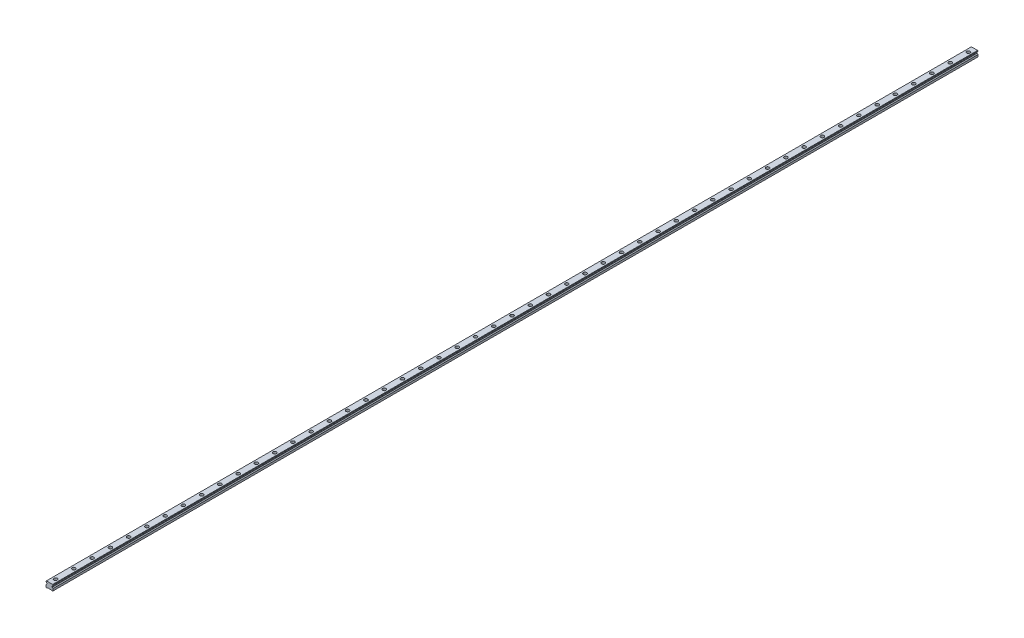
ISO-10303-21;
HEADER;
FILE_DESCRIPTION(('STEP AP214'),'2;1');
FILE_NAME('part.step','',(''),(''),'','','');
FILE_SCHEMA(('AUTOMOTIVE_DESIGN { 1 0 10303 214 1 1 1 1 }'));
ENDSEC;
DATA;
#1=APPLICATION_CONTEXT('core data for automotive mechanical design processes');
#2=APPLICATION_PROTOCOL_DEFINITION('international standard','automotive_design',2000,#1);
#3=PRODUCT_CONTEXT('',#1,'mechanical');
#4=PRODUCT('Part','Part','',(#3));
#5=PRODUCT_RELATED_PRODUCT_CATEGORY('part','',(#4));
#6=PRODUCT_DEFINITION_FORMATION('','',#4);
#7=PRODUCT_DEFINITION_CONTEXT('part definition',#1,'design');
#8=PRODUCT_DEFINITION('design','',#6,#7);
#9=PRODUCT_DEFINITION_SHAPE('','',#8);
#10=(LENGTH_UNIT() NAMED_UNIT(*) SI_UNIT(.MILLI.,.METRE.));
#11=(NAMED_UNIT(*) PLANE_ANGLE_UNIT() SI_UNIT($,.RADIAN.));
#12=(NAMED_UNIT(*) SI_UNIT($,.STERADIAN.) SOLID_ANGLE_UNIT());
#13=UNCERTAINTY_MEASURE_WITH_UNIT(LENGTH_MEASURE(1.E-05),#10,'distance_accuracy_value','');
#14=(GEOMETRIC_REPRESENTATION_CONTEXT(3) GLOBAL_UNCERTAINTY_ASSIGNED_CONTEXT((#13)) GLOBAL_UNIT_ASSIGNED_CONTEXT((#10,
#11,#12)) REPRESENTATION_CONTEXT('',''));
#15=CARTESIAN_POINT('',(0.,0.,0.));
#16=DIRECTION('',(0.,0.,1.));
#17=DIRECTION('',(1.,0.,0.));
#18=AXIS2_PLACEMENT_3D('',#15,#16,#17);
#19=CARTESIAN_POINT('',(0.,10.2,-1500.));
#20=DIRECTION('',(0.,1.,0.));
#21=DIRECTION('',(0.,0.,1.));
#22=AXIS2_PLACEMENT_3D('',#19,#20,#21);
#23=PLANE('',#22);
#24=CARTESIAN_POINT('',(0.,10.2,-1500.));
#25=DIRECTION('',(0.,1.,0.));
#26=DIRECTION('',(0.,0.,1.));
#27=AXIS2_PLACEMENT_3D('',#24,#25,#26);
#28=CIRCLE('',#27,3.49999999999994);
#29=CARTESIAN_POINT('',(0.,10.2,-1496.5));
#30=VERTEX_POINT('',#29);
#31=EDGE_CURVE('E750',#30,#30,#28,.T.);
#32=ORIENTED_EDGE('',*,*,#31,.F.);
#33=EDGE_LOOP('',(#32));
#34=FACE_BOUND('',#33,.T.);
#35=CARTESIAN_POINT('',(0.,10.2,-1500.));
#36=DIRECTION('',(0.,1.,0.));
#37=DIRECTION('',(0.,0.,1.));
#38=AXIS2_PLACEMENT_3D('',#35,#36,#37);
#39=CIRCLE('',#38,5.49999999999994);
#40=CARTESIAN_POINT('',(0.,10.2,-1494.5));
#41=VERTEX_POINT('',#40);
#42=EDGE_CURVE('E11',#41,#41,#39,.T.);
#43=ORIENTED_EDGE('',*,*,#42,.T.);
#44=EDGE_LOOP('',(#43));
#45=FACE_BOUND('',#44,.T.);
#46=ADVANCED_FACE('F39',(#34,#45),#23,.T.);
#47=CARTESIAN_POINT('',(0.,10.2,-1500.));
#48=DIRECTION('',(0.,1.,0.));
#49=DIRECTION('',(0.,0.,1.));
#50=AXIS2_PLACEMENT_3D('',#47,#48,#49);
#51=CYLINDRICAL_SURFACE('',#50,5.49999999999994);
#52=ORIENTED_EDGE('',*,*,#42,.F.);
#53=EDGE_LOOP('',(#52));
#54=FACE_BOUND('',#53,.T.);
#55=CARTESIAN_POINT('',(0.,19.2,-1500.));
#56=DIRECTION('',(0.,1.,0.));
#57=DIRECTION('',(0.,0.,1.));
#58=AXIS2_PLACEMENT_3D('',#55,#56,#57);
#59=CIRCLE('',#58,5.49999999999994);
#60=CARTESIAN_POINT('',(0.,19.2,-1494.5));
#61=VERTEX_POINT('',#60);
#62=EDGE_CURVE('E48',#61,#61,#59,.T.);
#63=ORIENTED_EDGE('',*,*,#62,.T.);
#64=EDGE_LOOP('',(#63));
#65=FACE_BOUND('',#64,.T.);
#66=ADVANCED_FACE('F1387',(#54,#65),#51,.F.);
#67=CARTESIAN_POINT('',(0.,10.2,-1440.));
#68=DIRECTION('',(0.,1.,0.));
#69=DIRECTION('',(0.,0.,1.));
#70=AXIS2_PLACEMENT_3D('',#67,#68,#69);
#71=PLANE('',#70);
#72=CARTESIAN_POINT('',(0.,10.2,-1440.));
#73=DIRECTION('',(0.,1.,0.));
#74=DIRECTION('',(0.,0.,1.));
#75=AXIS2_PLACEMENT_3D('',#72,#73,#74);
#76=CIRCLE('',#75,3.49999999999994);
#77=CARTESIAN_POINT('',(0.,10.2,-1436.5));
#78=VERTEX_POINT('',#77);
#79=EDGE_CURVE('E755',#78,#78,#76,.T.);
#80=ORIENTED_EDGE('',*,*,#79,.F.);
#81=EDGE_LOOP('',(#80));
#82=FACE_BOUND('',#81,.T.);
#83=CARTESIAN_POINT('',(0.,10.2,-1440.));
#84=DIRECTION('',(0.,1.,0.));
#85=DIRECTION('',(0.,0.,1.));
#86=AXIS2_PLACEMENT_3D('',#83,#84,#85);
#87=CIRCLE('',#86,5.49999999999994);
#88=CARTESIAN_POINT('',(0.,10.2,-1434.5));
#89=VERTEX_POINT('',#88);
#90=EDGE_CURVE('E734',#89,#89,#87,.T.);
#91=ORIENTED_EDGE('',*,*,#90,.T.);
#92=EDGE_LOOP('',(#91));
#93=FACE_BOUND('',#92,.T.);
#94=ADVANCED_FACE('F1389',(#82,#93),#71,.T.);
#95=CARTESIAN_POINT('',(0.,10.2,-1440.));
#96=DIRECTION('',(0.,1.,0.));
#97=DIRECTION('',(0.,0.,1.));
#98=AXIS2_PLACEMENT_3D('',#95,#96,#97);
#99=CYLINDRICAL_SURFACE('',#98,5.49999999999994);
#100=ORIENTED_EDGE('',*,*,#90,.F.);
#101=EDGE_LOOP('',(#100));
#102=FACE_BOUND('',#101,.T.);
#103=CARTESIAN_POINT('',(0.,19.2,-1440.));
#104=DIRECTION('',(0.,1.,0.));
#105=DIRECTION('',(0.,0.,1.));
#106=AXIS2_PLACEMENT_3D('',#103,#104,#105);
#107=CIRCLE('',#106,5.49999999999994);
#108=CARTESIAN_POINT('',(0.,19.2,-1434.5));
#109=VERTEX_POINT('',#108);
#110=EDGE_CURVE('E730',#109,#109,#107,.T.);
#111=ORIENTED_EDGE('',*,*,#110,.T.);
#112=EDGE_LOOP('',(#111));
#113=FACE_BOUND('',#112,.T.);
#114=ADVANCED_FACE('F1395',(#102,#113),#99,.F.);
#115=CARTESIAN_POINT('',(0.,10.2,-1380.));
#116=DIRECTION('',(0.,1.,0.));
#117=DIRECTION('',(0.,0.,1.));
#118=AXIS2_PLACEMENT_3D('',#115,#116,#117);
#119=PLANE('',#118);
#120=CARTESIAN_POINT('',(0.,10.2,-1380.));
#121=DIRECTION('',(0.,1.,0.));
#122=DIRECTION('',(0.,0.,1.));
#123=AXIS2_PLACEMENT_3D('',#120,#121,#122);
#124=CIRCLE('',#123,3.49999999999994);
#125=CARTESIAN_POINT('',(0.,10.2,-1376.5));
#126=VERTEX_POINT('',#125);
#127=EDGE_CURVE('E760',#126,#126,#124,.T.);
#128=ORIENTED_EDGE('',*,*,#127,.F.);
#129=EDGE_LOOP('',(#128));
#130=FACE_BOUND('',#129,.T.);
#131=CARTESIAN_POINT('',(0.,10.2,-1380.));
#132=DIRECTION('',(0.,1.,0.));
#133=DIRECTION('',(0.,0.,1.));
#134=AXIS2_PLACEMENT_3D('',#131,#132,#133);
#135=CIRCLE('',#134,5.49999999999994);
#136=CARTESIAN_POINT('',(0.,10.2,-1374.5));
#137=VERTEX_POINT('',#136);
#138=EDGE_CURVE('E726',#137,#137,#135,.T.);
#139=ORIENTED_EDGE('',*,*,#138,.T.);
#140=EDGE_LOOP('',(#139));
#141=FACE_BOUND('',#140,.T.);
#142=ADVANCED_FACE('F1403',(#130,#141),#119,.T.);
#143=CARTESIAN_POINT('',(0.,10.2,-1380.));
#144=DIRECTION('',(0.,1.,0.));
#145=DIRECTION('',(0.,0.,1.));
#146=AXIS2_PLACEMENT_3D('',#143,#144,#145);
#147=CYLINDRICAL_SURFACE('',#146,5.49999999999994);
#148=ORIENTED_EDGE('',*,*,#138,.F.);
#149=EDGE_LOOP('',(#148));
#150=FACE_BOUND('',#149,.T.);
#151=CARTESIAN_POINT('',(0.,19.2,-1380.));
#152=DIRECTION('',(0.,1.,0.));
#153=DIRECTION('',(0.,0.,1.));
#154=AXIS2_PLACEMENT_3D('',#151,#152,#153);
#155=CIRCLE('',#154,5.49999999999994);
#156=CARTESIAN_POINT('',(0.,19.2,-1374.5));
#157=VERTEX_POINT('',#156);
#158=EDGE_CURVE('E722',#157,#157,#155,.T.);
#159=ORIENTED_EDGE('',*,*,#158,.T.);
#160=EDGE_LOOP('',(#159));
#161=FACE_BOUND('',#160,.T.);
#162=ADVANCED_FACE('F1407',(#150,#161),#147,.F.);
#163=CARTESIAN_POINT('',(0.,10.2,-1320.));
#164=DIRECTION('',(0.,1.,0.));
#165=DIRECTION('',(0.,0.,1.));
#166=AXIS2_PLACEMENT_3D('',#163,#164,#165);
#167=PLANE('',#166);
#168=CARTESIAN_POINT('',(0.,10.2,-1320.));
#169=DIRECTION('',(0.,1.,0.));
#170=DIRECTION('',(0.,0.,1.));
#171=AXIS2_PLACEMENT_3D('',#168,#169,#170);
#172=CIRCLE('',#171,3.49999999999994);
#173=CARTESIAN_POINT('',(0.,10.2,-1316.5));
#174=VERTEX_POINT('',#173);
#175=EDGE_CURVE('E765',#174,#174,#172,.T.);
#176=ORIENTED_EDGE('',*,*,#175,.F.);
#177=EDGE_LOOP('',(#176));
#178=FACE_BOUND('',#177,.T.);
#179=CARTESIAN_POINT('',(0.,10.2,-1320.));
#180=DIRECTION('',(0.,1.,0.));
#181=DIRECTION('',(0.,0.,1.));
#182=AXIS2_PLACEMENT_3D('',#179,#180,#181);
#183=CIRCLE('',#182,5.49999999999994);
#184=CARTESIAN_POINT('',(0.,10.2,-1314.5));
#185=VERTEX_POINT('',#184);
#186=EDGE_CURVE('E718',#185,#185,#183,.T.);
#187=ORIENTED_EDGE('',*,*,#186,.T.);
#188=EDGE_LOOP('',(#187));
#189=FACE_BOUND('',#188,.T.);
#190=ADVANCED_FACE('F1411',(#178,#189),#167,.T.);
#191=CARTESIAN_POINT('',(0.,10.2,-1320.));
#192=DIRECTION('',(0.,1.,0.));
#193=DIRECTION('',(0.,0.,1.));
#194=AXIS2_PLACEMENT_3D('',#191,#192,#193);
#195=CYLINDRICAL_SURFACE('',#194,5.49999999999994);
#196=ORIENTED_EDGE('',*,*,#186,.F.);
#197=EDGE_LOOP('',(#196));
#198=FACE_BOUND('',#197,.T.);
#199=CARTESIAN_POINT('',(0.,19.2,-1320.));
#200=DIRECTION('',(0.,1.,0.));
#201=DIRECTION('',(0.,0.,1.));
#202=AXIS2_PLACEMENT_3D('',#199,#200,#201);
#203=CIRCLE('',#202,5.49999999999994);
#204=CARTESIAN_POINT('',(0.,19.2,-1314.5));
#205=VERTEX_POINT('',#204);
#206=EDGE_CURVE('E714',#205,#205,#203,.T.);
#207=ORIENTED_EDGE('',*,*,#206,.T.);
#208=EDGE_LOOP('',(#207));
#209=FACE_BOUND('',#208,.T.);
#210=ADVANCED_FACE('F1415',(#198,#209),#195,.F.);
#211=CARTESIAN_POINT('',(0.,10.2,-1260.));
#212=DIRECTION('',(0.,1.,0.));
#213=DIRECTION('',(0.,0.,1.));
#214=AXIS2_PLACEMENT_3D('',#211,#212,#213);
#215=PLANE('',#214);
#216=CARTESIAN_POINT('',(0.,10.2,-1260.));
#217=DIRECTION('',(0.,1.,0.));
#218=DIRECTION('',(0.,0.,1.));
#219=AXIS2_PLACEMENT_3D('',#216,#217,#218);
#220=CIRCLE('',#219,3.49999999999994);
#221=CARTESIAN_POINT('',(0.,10.2,-1256.5));
#222=VERTEX_POINT('',#221);
#223=EDGE_CURVE('E770',#222,#222,#220,.T.);
#224=ORIENTED_EDGE('',*,*,#223,.F.);
#225=EDGE_LOOP('',(#224));
#226=FACE_BOUND('',#225,.T.);
#227=CARTESIAN_POINT('',(0.,10.2,-1260.));
#228=DIRECTION('',(0.,1.,0.));
#229=DIRECTION('',(0.,0.,1.));
#230=AXIS2_PLACEMENT_3D('',#227,#228,#229);
#231=CIRCLE('',#230,5.49999999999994);
#232=CARTESIAN_POINT('',(0.,10.2,-1254.5));
#233=VERTEX_POINT('',#232);
#234=EDGE_CURVE('E710',#233,#233,#231,.T.);
#235=ORIENTED_EDGE('',*,*,#234,.T.);
#236=EDGE_LOOP('',(#235));
#237=FACE_BOUND('',#236,.T.);
#238=ADVANCED_FACE('F1419',(#226,#237),#215,.T.);
#239=CARTESIAN_POINT('',(0.,10.2,-1260.));
#240=DIRECTION('',(0.,1.,0.));
#241=DIRECTION('',(0.,0.,1.));
#242=AXIS2_PLACEMENT_3D('',#239,#240,#241);
#243=CYLINDRICAL_SURFACE('',#242,5.49999999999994);
#244=ORIENTED_EDGE('',*,*,#234,.F.);
#245=EDGE_LOOP('',(#244));
#246=FACE_BOUND('',#245,.T.);
#247=CARTESIAN_POINT('',(0.,19.2,-1260.));
#248=DIRECTION('',(0.,1.,0.));
#249=DIRECTION('',(0.,0.,1.));
#250=AXIS2_PLACEMENT_3D('',#247,#248,#249);
#251=CIRCLE('',#250,5.49999999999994);
#252=CARTESIAN_POINT('',(0.,19.2,-1254.5));
#253=VERTEX_POINT('',#252);
#254=EDGE_CURVE('E706',#253,#253,#251,.T.);
#255=ORIENTED_EDGE('',*,*,#254,.T.);
#256=EDGE_LOOP('',(#255));
#257=FACE_BOUND('',#256,.T.);
#258=ADVANCED_FACE('F1423',(#246,#257),#243,.F.);
#259=CARTESIAN_POINT('',(0.,10.2,-1200.));
#260=DIRECTION('',(0.,1.,0.));
#261=DIRECTION('',(0.,0.,1.));
#262=AXIS2_PLACEMENT_3D('',#259,#260,#261);
#263=PLANE('',#262);
#264=CARTESIAN_POINT('',(0.,10.2,-1200.));
#265=DIRECTION('',(0.,1.,0.));
#266=DIRECTION('',(0.,0.,1.));
#267=AXIS2_PLACEMENT_3D('',#264,#265,#266);
#268=CIRCLE('',#267,3.49999999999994);
#269=CARTESIAN_POINT('',(0.,10.2,-1196.5));
#270=VERTEX_POINT('',#269);
#271=EDGE_CURVE('E775',#270,#270,#268,.T.);
#272=ORIENTED_EDGE('',*,*,#271,.F.);
#273=EDGE_LOOP('',(#272));
#274=FACE_BOUND('',#273,.T.);
#275=CARTESIAN_POINT('',(0.,10.2,-1200.));
#276=DIRECTION('',(0.,1.,0.));
#277=DIRECTION('',(0.,0.,1.));
#278=AXIS2_PLACEMENT_3D('',#275,#276,#277);
#279=CIRCLE('',#278,5.49999999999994);
#280=CARTESIAN_POINT('',(0.,10.2,-1194.5));
#281=VERTEX_POINT('',#280);
#282=EDGE_CURVE('E702',#281,#281,#279,.T.);
#283=ORIENTED_EDGE('',*,*,#282,.T.);
#284=EDGE_LOOP('',(#283));
#285=FACE_BOUND('',#284,.T.);
#286=ADVANCED_FACE('F1427',(#274,#285),#263,.T.);
#287=CARTESIAN_POINT('',(0.,10.2,-1200.));
#288=DIRECTION('',(0.,1.,0.));
#289=DIRECTION('',(0.,0.,1.));
#290=AXIS2_PLACEMENT_3D('',#287,#288,#289);
#291=CYLINDRICAL_SURFACE('',#290,5.49999999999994);
#292=ORIENTED_EDGE('',*,*,#282,.F.);
#293=EDGE_LOOP('',(#292));
#294=FACE_BOUND('',#293,.T.);
#295=CARTESIAN_POINT('',(0.,19.2,-1200.));
#296=DIRECTION('',(0.,1.,0.));
#297=DIRECTION('',(0.,0.,1.));
#298=AXIS2_PLACEMENT_3D('',#295,#296,#297);
#299=CIRCLE('',#298,5.49999999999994);
#300=CARTESIAN_POINT('',(0.,19.2,-1194.5));
#301=VERTEX_POINT('',#300);
#302=EDGE_CURVE('E698',#301,#301,#299,.T.);
#303=ORIENTED_EDGE('',*,*,#302,.T.);
#304=EDGE_LOOP('',(#303));
#305=FACE_BOUND('',#304,.T.);
#306=ADVANCED_FACE('F1431',(#294,#305),#291,.F.);
#307=CARTESIAN_POINT('',(0.,10.2,-1140.));
#308=DIRECTION('',(0.,1.,0.));
#309=DIRECTION('',(0.,0.,1.));
#310=AXIS2_PLACEMENT_3D('',#307,#308,#309);
#311=PLANE('',#310);
#312=CARTESIAN_POINT('',(0.,10.2,-1140.));
#313=DIRECTION('',(0.,1.,0.));
#314=DIRECTION('',(0.,0.,1.));
#315=AXIS2_PLACEMENT_3D('',#312,#313,#314);
#316=CIRCLE('',#315,3.49999999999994);
#317=CARTESIAN_POINT('',(0.,10.2,-1136.5));
#318=VERTEX_POINT('',#317);
#319=EDGE_CURVE('E780',#318,#318,#316,.T.);
#320=ORIENTED_EDGE('',*,*,#319,.F.);
#321=EDGE_LOOP('',(#320));
#322=FACE_BOUND('',#321,.T.);
#323=CARTESIAN_POINT('',(0.,10.2,-1140.));
#324=DIRECTION('',(0.,1.,0.));
#325=DIRECTION('',(0.,0.,1.));
#326=AXIS2_PLACEMENT_3D('',#323,#324,#325);
#327=CIRCLE('',#326,5.49999999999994);
#328=CARTESIAN_POINT('',(0.,10.2,-1134.5));
#329=VERTEX_POINT('',#328);
#330=EDGE_CURVE('E694',#329,#329,#327,.T.);
#331=ORIENTED_EDGE('',*,*,#330,.T.);
#332=EDGE_LOOP('',(#331));
#333=FACE_BOUND('',#332,.T.);
#334=ADVANCED_FACE('F1435',(#322,#333),#311,.T.);
#335=CARTESIAN_POINT('',(0.,10.2,-1140.));
#336=DIRECTION('',(0.,1.,0.));
#337=DIRECTION('',(0.,0.,1.));
#338=AXIS2_PLACEMENT_3D('',#335,#336,#337);
#339=CYLINDRICAL_SURFACE('',#338,5.49999999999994);
#340=ORIENTED_EDGE('',*,*,#330,.F.);
#341=EDGE_LOOP('',(#340));
#342=FACE_BOUND('',#341,.T.);
#343=CARTESIAN_POINT('',(0.,19.2,-1140.));
#344=DIRECTION('',(0.,1.,0.));
#345=DIRECTION('',(0.,0.,1.));
#346=AXIS2_PLACEMENT_3D('',#343,#344,#345);
#347=CIRCLE('',#346,5.49999999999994);
#348=CARTESIAN_POINT('',(0.,19.2,-1134.5));
#349=VERTEX_POINT('',#348);
#350=EDGE_CURVE('E690',#349,#349,#347,.T.);
#351=ORIENTED_EDGE('',*,*,#350,.T.);
#352=EDGE_LOOP('',(#351));
#353=FACE_BOUND('',#352,.T.);
#354=ADVANCED_FACE('F1439',(#342,#353),#339,.F.);
#355=CARTESIAN_POINT('',(0.,10.2,-1080.));
#356=DIRECTION('',(0.,1.,0.));
#357=DIRECTION('',(0.,0.,1.));
#358=AXIS2_PLACEMENT_3D('',#355,#356,#357);
#359=PLANE('',#358);
#360=CARTESIAN_POINT('',(0.,10.2,-1080.));
#361=DIRECTION('',(0.,1.,0.));
#362=DIRECTION('',(0.,0.,1.));
#363=AXIS2_PLACEMENT_3D('',#360,#361,#362);
#364=CIRCLE('',#363,3.49999999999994);
#365=CARTESIAN_POINT('',(0.,10.2,-1076.5));
#366=VERTEX_POINT('',#365);
#367=EDGE_CURVE('E785',#366,#366,#364,.T.);
#368=ORIENTED_EDGE('',*,*,#367,.F.);
#369=EDGE_LOOP('',(#368));
#370=FACE_BOUND('',#369,.T.);
#371=CARTESIAN_POINT('',(0.,10.2,-1080.));
#372=DIRECTION('',(0.,1.,0.));
#373=DIRECTION('',(0.,0.,1.));
#374=AXIS2_PLACEMENT_3D('',#371,#372,#373);
#375=CIRCLE('',#374,5.49999999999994);
#376=CARTESIAN_POINT('',(0.,10.2,-1074.5));
#377=VERTEX_POINT('',#376);
#378=EDGE_CURVE('E686',#377,#377,#375,.T.);
#379=ORIENTED_EDGE('',*,*,#378,.T.);
#380=EDGE_LOOP('',(#379));
#381=FACE_BOUND('',#380,.T.);
#382=ADVANCED_FACE('F1443',(#370,#381),#359,.T.);
#383=CARTESIAN_POINT('',(0.,10.2,-1080.));
#384=DIRECTION('',(0.,1.,0.));
#385=DIRECTION('',(0.,0.,1.));
#386=AXIS2_PLACEMENT_3D('',#383,#384,#385);
#387=CYLINDRICAL_SURFACE('',#386,5.49999999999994);
#388=ORIENTED_EDGE('',*,*,#378,.F.);
#389=EDGE_LOOP('',(#388));
#390=FACE_BOUND('',#389,.T.);
#391=CARTESIAN_POINT('',(0.,19.2,-1080.));
#392=DIRECTION('',(0.,1.,0.));
#393=DIRECTION('',(0.,0.,1.));
#394=AXIS2_PLACEMENT_3D('',#391,#392,#393);
#395=CIRCLE('',#394,5.49999999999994);
#396=CARTESIAN_POINT('',(0.,19.2,-1074.5));
#397=VERTEX_POINT('',#396);
#398=EDGE_CURVE('E682',#397,#397,#395,.T.);
#399=ORIENTED_EDGE('',*,*,#398,.T.);
#400=EDGE_LOOP('',(#399));
#401=FACE_BOUND('',#400,.T.);
#402=ADVANCED_FACE('F1447',(#390,#401),#387,.F.);
#403=CARTESIAN_POINT('',(0.,10.2,-1020.));
#404=DIRECTION('',(0.,1.,0.));
#405=DIRECTION('',(0.,0.,1.));
#406=AXIS2_PLACEMENT_3D('',#403,#404,#405);
#407=PLANE('',#406);
#408=CARTESIAN_POINT('',(0.,10.2,-1020.));
#409=DIRECTION('',(0.,1.,0.));
#410=DIRECTION('',(0.,0.,1.));
#411=AXIS2_PLACEMENT_3D('',#408,#409,#410);
#412=CIRCLE('',#411,3.49999999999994);
#413=CARTESIAN_POINT('',(0.,10.2,-1016.5));
#414=VERTEX_POINT('',#413);
#415=EDGE_CURVE('E790',#414,#414,#412,.T.);
#416=ORIENTED_EDGE('',*,*,#415,.F.);
#417=EDGE_LOOP('',(#416));
#418=FACE_BOUND('',#417,.T.);
#419=CARTESIAN_POINT('',(0.,10.2,-1020.));
#420=DIRECTION('',(0.,1.,0.));
#421=DIRECTION('',(0.,0.,1.));
#422=AXIS2_PLACEMENT_3D('',#419,#420,#421);
#423=CIRCLE('',#422,5.49999999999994);
#424=CARTESIAN_POINT('',(0.,10.2,-1014.5));
#425=VERTEX_POINT('',#424);
#426=EDGE_CURVE('E678',#425,#425,#423,.T.);
#427=ORIENTED_EDGE('',*,*,#426,.T.);
#428=EDGE_LOOP('',(#427));
#429=FACE_BOUND('',#428,.T.);
#430=ADVANCED_FACE('F1451',(#418,#429),#407,.T.);
#431=CARTESIAN_POINT('',(0.,10.2,-1020.));
#432=DIRECTION('',(0.,1.,0.));
#433=DIRECTION('',(0.,0.,1.));
#434=AXIS2_PLACEMENT_3D('',#431,#432,#433);
#435=CYLINDRICAL_SURFACE('',#434,5.49999999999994);
#436=ORIENTED_EDGE('',*,*,#426,.F.);
#437=EDGE_LOOP('',(#436));
#438=FACE_BOUND('',#437,.T.);
#439=CARTESIAN_POINT('',(0.,19.2,-1020.));
#440=DIRECTION('',(0.,1.,0.));
#441=DIRECTION('',(0.,0.,1.));
#442=AXIS2_PLACEMENT_3D('',#439,#440,#441);
#443=CIRCLE('',#442,5.49999999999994);
#444=CARTESIAN_POINT('',(0.,19.2,-1014.5));
#445=VERTEX_POINT('',#444);
#446=EDGE_CURVE('E674',#445,#445,#443,.T.);
#447=ORIENTED_EDGE('',*,*,#446,.T.);
#448=EDGE_LOOP('',(#447));
#449=FACE_BOUND('',#448,.T.);
#450=ADVANCED_FACE('F1455',(#438,#449),#435,.F.);
#451=CARTESIAN_POINT('',(0.,10.2,-960.));
#452=DIRECTION('',(0.,1.,0.));
#453=DIRECTION('',(0.,0.,1.));
#454=AXIS2_PLACEMENT_3D('',#451,#452,#453);
#455=PLANE('',#454);
#456=CARTESIAN_POINT('',(0.,10.2,-960.));
#457=DIRECTION('',(0.,1.,0.));
#458=DIRECTION('',(0.,0.,1.));
#459=AXIS2_PLACEMENT_3D('',#456,#457,#458);
#460=CIRCLE('',#459,3.49999999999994);
#461=CARTESIAN_POINT('',(0.,10.2,-956.5));
#462=VERTEX_POINT('',#461);
#463=EDGE_CURVE('E795',#462,#462,#460,.T.);
#464=ORIENTED_EDGE('',*,*,#463,.F.);
#465=EDGE_LOOP('',(#464));
#466=FACE_BOUND('',#465,.T.);
#467=CARTESIAN_POINT('',(0.,10.2,-960.));
#468=DIRECTION('',(0.,1.,0.));
#469=DIRECTION('',(0.,0.,1.));
#470=AXIS2_PLACEMENT_3D('',#467,#468,#469);
#471=CIRCLE('',#470,5.49999999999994);
#472=CARTESIAN_POINT('',(0.,10.2,-954.5));
#473=VERTEX_POINT('',#472);
#474=EDGE_CURVE('E670',#473,#473,#471,.T.);
#475=ORIENTED_EDGE('',*,*,#474,.T.);
#476=EDGE_LOOP('',(#475));
#477=FACE_BOUND('',#476,.T.);
#478=ADVANCED_FACE('F1459',(#466,#477),#455,.T.);
#479=CARTESIAN_POINT('',(0.,10.2,-960.));
#480=DIRECTION('',(0.,1.,0.));
#481=DIRECTION('',(0.,0.,1.));
#482=AXIS2_PLACEMENT_3D('',#479,#480,#481);
#483=CYLINDRICAL_SURFACE('',#482,5.49999999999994);
#484=ORIENTED_EDGE('',*,*,#474,.F.);
#485=EDGE_LOOP('',(#484));
#486=FACE_BOUND('',#485,.T.);
#487=CARTESIAN_POINT('',(0.,19.2,-960.));
#488=DIRECTION('',(0.,1.,0.));
#489=DIRECTION('',(0.,0.,1.));
#490=AXIS2_PLACEMENT_3D('',#487,#488,#489);
#491=CIRCLE('',#490,5.49999999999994);
#492=CARTESIAN_POINT('',(0.,19.2,-954.5));
#493=VERTEX_POINT('',#492);
#494=EDGE_CURVE('E666',#493,#493,#491,.T.);
#495=ORIENTED_EDGE('',*,*,#494,.T.);
#496=EDGE_LOOP('',(#495));
#497=FACE_BOUND('',#496,.T.);
#498=ADVANCED_FACE('F1463',(#486,#497),#483,.F.);
#499=CARTESIAN_POINT('',(0.,10.2,-900.));
#500=DIRECTION('',(0.,1.,0.));
#501=DIRECTION('',(0.,0.,1.));
#502=AXIS2_PLACEMENT_3D('',#499,#500,#501);
#503=PLANE('',#502);
#504=CARTESIAN_POINT('',(0.,10.2,-900.));
#505=DIRECTION('',(0.,1.,0.));
#506=DIRECTION('',(0.,0.,1.));
#507=AXIS2_PLACEMENT_3D('',#504,#505,#506);
#508=CIRCLE('',#507,3.49999999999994);
#509=CARTESIAN_POINT('',(0.,10.2,-896.5));
#510=VERTEX_POINT('',#509);
#511=EDGE_CURVE('E800',#510,#510,#508,.T.);
#512=ORIENTED_EDGE('',*,*,#511,.F.);
#513=EDGE_LOOP('',(#512));
#514=FACE_BOUND('',#513,.T.);
#515=CARTESIAN_POINT('',(0.,10.2,-900.));
#516=DIRECTION('',(0.,1.,0.));
#517=DIRECTION('',(0.,0.,1.));
#518=AXIS2_PLACEMENT_3D('',#515,#516,#517);
#519=CIRCLE('',#518,5.49999999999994);
#520=CARTESIAN_POINT('',(0.,10.2,-894.5));
#521=VERTEX_POINT('',#520);
#522=EDGE_CURVE('E662',#521,#521,#519,.T.);
#523=ORIENTED_EDGE('',*,*,#522,.T.);
#524=EDGE_LOOP('',(#523));
#525=FACE_BOUND('',#524,.T.);
#526=ADVANCED_FACE('F1467',(#514,#525),#503,.T.);
#527=CARTESIAN_POINT('',(0.,10.2,-900.));
#528=DIRECTION('',(0.,1.,0.));
#529=DIRECTION('',(0.,0.,1.));
#530=AXIS2_PLACEMENT_3D('',#527,#528,#529);
#531=CYLINDRICAL_SURFACE('',#530,5.49999999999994);
#532=ORIENTED_EDGE('',*,*,#522,.F.);
#533=EDGE_LOOP('',(#532));
#534=FACE_BOUND('',#533,.T.);
#535=CARTESIAN_POINT('',(0.,19.2,-900.));
#536=DIRECTION('',(0.,1.,0.));
#537=DIRECTION('',(0.,0.,1.));
#538=AXIS2_PLACEMENT_3D('',#535,#536,#537);
#539=CIRCLE('',#538,5.49999999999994);
#540=CARTESIAN_POINT('',(0.,19.2,-894.5));
#541=VERTEX_POINT('',#540);
#542=EDGE_CURVE('E658',#541,#541,#539,.T.);
#543=ORIENTED_EDGE('',*,*,#542,.T.);
#544=EDGE_LOOP('',(#543));
#545=FACE_BOUND('',#544,.T.);
#546=ADVANCED_FACE('F1471',(#534,#545),#531,.F.);
#547=CARTESIAN_POINT('',(0.,10.2,-840.));
#548=DIRECTION('',(0.,1.,0.));
#549=DIRECTION('',(0.,0.,1.));
#550=AXIS2_PLACEMENT_3D('',#547,#548,#549);
#551=PLANE('',#550);
#552=CARTESIAN_POINT('',(0.,10.2,-840.));
#553=DIRECTION('',(0.,1.,0.));
#554=DIRECTION('',(0.,0.,1.));
#555=AXIS2_PLACEMENT_3D('',#552,#553,#554);
#556=CIRCLE('',#555,3.49999999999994);
#557=CARTESIAN_POINT('',(0.,10.2,-836.5));
#558=VERTEX_POINT('',#557);
#559=EDGE_CURVE('E805',#558,#558,#556,.T.);
#560=ORIENTED_EDGE('',*,*,#559,.F.);
#561=EDGE_LOOP('',(#560));
#562=FACE_BOUND('',#561,.T.);
#563=CARTESIAN_POINT('',(0.,10.2,-840.));
#564=DIRECTION('',(0.,1.,0.));
#565=DIRECTION('',(0.,0.,1.));
#566=AXIS2_PLACEMENT_3D('',#563,#564,#565);
#567=CIRCLE('',#566,5.49999999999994);
#568=CARTESIAN_POINT('',(0.,10.2,-834.5));
#569=VERTEX_POINT('',#568);
#570=EDGE_CURVE('E654',#569,#569,#567,.T.);
#571=ORIENTED_EDGE('',*,*,#570,.T.);
#572=EDGE_LOOP('',(#571));
#573=FACE_BOUND('',#572,.T.);
#574=ADVANCED_FACE('F1475',(#562,#573),#551,.T.);
#575=CARTESIAN_POINT('',(0.,10.2,-840.));
#576=DIRECTION('',(0.,1.,0.));
#577=DIRECTION('',(0.,0.,1.));
#578=AXIS2_PLACEMENT_3D('',#575,#576,#577);
#579=CYLINDRICAL_SURFACE('',#578,5.49999999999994);
#580=ORIENTED_EDGE('',*,*,#570,.F.);
#581=EDGE_LOOP('',(#580));
#582=FACE_BOUND('',#581,.T.);
#583=CARTESIAN_POINT('',(0.,19.2,-840.));
#584=DIRECTION('',(0.,1.,0.));
#585=DIRECTION('',(0.,0.,1.));
#586=AXIS2_PLACEMENT_3D('',#583,#584,#585);
#587=CIRCLE('',#586,5.49999999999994);
#588=CARTESIAN_POINT('',(0.,19.2,-834.5));
#589=VERTEX_POINT('',#588);
#590=EDGE_CURVE('E650',#589,#589,#587,.T.);
#591=ORIENTED_EDGE('',*,*,#590,.T.);
#592=EDGE_LOOP('',(#591));
#593=FACE_BOUND('',#592,.T.);
#594=ADVANCED_FACE('F1479',(#582,#593),#579,.F.);
#595=CARTESIAN_POINT('',(0.,10.2,-780.));
#596=DIRECTION('',(0.,1.,0.));
#597=DIRECTION('',(0.,0.,1.));
#598=AXIS2_PLACEMENT_3D('',#595,#596,#597);
#599=PLANE('',#598);
#600=CARTESIAN_POINT('',(0.,10.2,-780.));
#601=DIRECTION('',(0.,1.,0.));
#602=DIRECTION('',(0.,0.,1.));
#603=AXIS2_PLACEMENT_3D('',#600,#601,#602);
#604=CIRCLE('',#603,3.49999999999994);
#605=CARTESIAN_POINT('',(0.,10.2,-776.5));
#606=VERTEX_POINT('',#605);
#607=EDGE_CURVE('E810',#606,#606,#604,.T.);
#608=ORIENTED_EDGE('',*,*,#607,.F.);
#609=EDGE_LOOP('',(#608));
#610=FACE_BOUND('',#609,.T.);
#611=CARTESIAN_POINT('',(0.,10.2,-780.));
#612=DIRECTION('',(0.,1.,0.));
#613=DIRECTION('',(0.,0.,1.));
#614=AXIS2_PLACEMENT_3D('',#611,#612,#613);
#615=CIRCLE('',#614,5.49999999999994);
#616=CARTESIAN_POINT('',(0.,10.2,-774.5));
#617=VERTEX_POINT('',#616);
#618=EDGE_CURVE('E646',#617,#617,#615,.T.);
#619=ORIENTED_EDGE('',*,*,#618,.T.);
#620=EDGE_LOOP('',(#619));
#621=FACE_BOUND('',#620,.T.);
#622=ADVANCED_FACE('F1483',(#610,#621),#599,.T.);
#623=CARTESIAN_POINT('',(0.,10.2,-780.));
#624=DIRECTION('',(0.,1.,0.));
#625=DIRECTION('',(0.,0.,1.));
#626=AXIS2_PLACEMENT_3D('',#623,#624,#625);
#627=CYLINDRICAL_SURFACE('',#626,5.49999999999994);
#628=ORIENTED_EDGE('',*,*,#618,.F.);
#629=EDGE_LOOP('',(#628));
#630=FACE_BOUND('',#629,.T.);
#631=CARTESIAN_POINT('',(0.,19.2,-780.));
#632=DIRECTION('',(0.,1.,0.));
#633=DIRECTION('',(0.,0.,1.));
#634=AXIS2_PLACEMENT_3D('',#631,#632,#633);
#635=CIRCLE('',#634,5.49999999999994);
#636=CARTESIAN_POINT('',(0.,19.2,-774.5));
#637=VERTEX_POINT('',#636);
#638=EDGE_CURVE('E642',#637,#637,#635,.T.);
#639=ORIENTED_EDGE('',*,*,#638,.T.);
#640=EDGE_LOOP('',(#639));
#641=FACE_BOUND('',#640,.T.);
#642=ADVANCED_FACE('F1487',(#630,#641),#627,.F.);
#643=CARTESIAN_POINT('',(0.,10.2,-720.));
#644=DIRECTION('',(0.,1.,0.));
#645=DIRECTION('',(0.,0.,1.));
#646=AXIS2_PLACEMENT_3D('',#643,#644,#645);
#647=PLANE('',#646);
#648=CARTESIAN_POINT('',(0.,10.2,-720.));
#649=DIRECTION('',(0.,1.,0.));
#650=DIRECTION('',(0.,0.,1.));
#651=AXIS2_PLACEMENT_3D('',#648,#649,#650);
#652=CIRCLE('',#651,3.49999999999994);
#653=CARTESIAN_POINT('',(0.,10.2,-716.5));
#654=VERTEX_POINT('',#653);
#655=EDGE_CURVE('E815',#654,#654,#652,.T.);
#656=ORIENTED_EDGE('',*,*,#655,.F.);
#657=EDGE_LOOP('',(#656));
#658=FACE_BOUND('',#657,.T.);
#659=CARTESIAN_POINT('',(0.,10.2,-720.));
#660=DIRECTION('',(0.,1.,0.));
#661=DIRECTION('',(0.,0.,1.));
#662=AXIS2_PLACEMENT_3D('',#659,#660,#661);
#663=CIRCLE('',#662,5.49999999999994);
#664=CARTESIAN_POINT('',(0.,10.2,-714.5));
#665=VERTEX_POINT('',#664);
#666=EDGE_CURVE('E638',#665,#665,#663,.T.);
#667=ORIENTED_EDGE('',*,*,#666,.T.);
#668=EDGE_LOOP('',(#667));
#669=FACE_BOUND('',#668,.T.);
#670=ADVANCED_FACE('F1491',(#658,#669),#647,.T.);
#671=CARTESIAN_POINT('',(0.,10.2,-720.));
#672=DIRECTION('',(0.,1.,0.));
#673=DIRECTION('',(0.,0.,1.));
#674=AXIS2_PLACEMENT_3D('',#671,#672,#673);
#675=CYLINDRICAL_SURFACE('',#674,5.49999999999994);
#676=ORIENTED_EDGE('',*,*,#666,.F.);
#677=EDGE_LOOP('',(#676));
#678=FACE_BOUND('',#677,.T.);
#679=CARTESIAN_POINT('',(0.,19.2,-720.));
#680=DIRECTION('',(0.,1.,0.));
#681=DIRECTION('',(0.,0.,1.));
#682=AXIS2_PLACEMENT_3D('',#679,#680,#681);
#683=CIRCLE('',#682,5.49999999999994);
#684=CARTESIAN_POINT('',(0.,19.2,-714.5));
#685=VERTEX_POINT('',#684);
#686=EDGE_CURVE('E634',#685,#685,#683,.T.);
#687=ORIENTED_EDGE('',*,*,#686,.T.);
#688=EDGE_LOOP('',(#687));
#689=FACE_BOUND('',#688,.T.);
#690=ADVANCED_FACE('F1495',(#678,#689),#675,.F.);
#691=CARTESIAN_POINT('',(0.,10.2,-660.));
#692=DIRECTION('',(0.,1.,0.));
#693=DIRECTION('',(0.,0.,1.));
#694=AXIS2_PLACEMENT_3D('',#691,#692,#693);
#695=PLANE('',#694);
#696=CARTESIAN_POINT('',(0.,10.2,-660.));
#697=DIRECTION('',(0.,1.,0.));
#698=DIRECTION('',(0.,0.,1.));
#699=AXIS2_PLACEMENT_3D('',#696,#697,#698);
#700=CIRCLE('',#699,3.49999999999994);
#701=CARTESIAN_POINT('',(0.,10.2,-656.5));
#702=VERTEX_POINT('',#701);
#703=EDGE_CURVE('E820',#702,#702,#700,.T.);
#704=ORIENTED_EDGE('',*,*,#703,.F.);
#705=EDGE_LOOP('',(#704));
#706=FACE_BOUND('',#705,.T.);
#707=CARTESIAN_POINT('',(0.,10.2,-660.));
#708=DIRECTION('',(0.,1.,0.));
#709=DIRECTION('',(0.,0.,1.));
#710=AXIS2_PLACEMENT_3D('',#707,#708,#709);
#711=CIRCLE('',#710,5.49999999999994);
#712=CARTESIAN_POINT('',(0.,10.2,-654.5));
#713=VERTEX_POINT('',#712);
#714=EDGE_CURVE('E630',#713,#713,#711,.T.);
#715=ORIENTED_EDGE('',*,*,#714,.T.);
#716=EDGE_LOOP('',(#715));
#717=FACE_BOUND('',#716,.T.);
#718=ADVANCED_FACE('F1499',(#706,#717),#695,.T.);
#719=CARTESIAN_POINT('',(0.,10.2,-660.));
#720=DIRECTION('',(0.,1.,0.));
#721=DIRECTION('',(0.,0.,1.));
#722=AXIS2_PLACEMENT_3D('',#719,#720,#721);
#723=CYLINDRICAL_SURFACE('',#722,5.49999999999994);
#724=ORIENTED_EDGE('',*,*,#714,.F.);
#725=EDGE_LOOP('',(#724));
#726=FACE_BOUND('',#725,.T.);
#727=CARTESIAN_POINT('',(0.,19.2,-660.));
#728=DIRECTION('',(0.,1.,0.));
#729=DIRECTION('',(0.,0.,1.));
#730=AXIS2_PLACEMENT_3D('',#727,#728,#729);
#731=CIRCLE('',#730,5.49999999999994);
#732=CARTESIAN_POINT('',(0.,19.2,-654.5));
#733=VERTEX_POINT('',#732);
#734=EDGE_CURVE('E626',#733,#733,#731,.T.);
#735=ORIENTED_EDGE('',*,*,#734,.T.);
#736=EDGE_LOOP('',(#735));
#737=FACE_BOUND('',#736,.T.);
#738=ADVANCED_FACE('F1503',(#726,#737),#723,.F.);
#739=CARTESIAN_POINT('',(0.,10.2,-600.));
#740=DIRECTION('',(0.,1.,0.));
#741=DIRECTION('',(0.,0.,1.));
#742=AXIS2_PLACEMENT_3D('',#739,#740,#741);
#743=PLANE('',#742);
#744=CARTESIAN_POINT('',(0.,10.2,-600.));
#745=DIRECTION('',(0.,1.,0.));
#746=DIRECTION('',(0.,0.,1.));
#747=AXIS2_PLACEMENT_3D('',#744,#745,#746);
#748=CIRCLE('',#747,3.49999999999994);
#749=CARTESIAN_POINT('',(0.,10.2,-596.5));
#750=VERTEX_POINT('',#749);
#751=EDGE_CURVE('E825',#750,#750,#748,.T.);
#752=ORIENTED_EDGE('',*,*,#751,.F.);
#753=EDGE_LOOP('',(#752));
#754=FACE_BOUND('',#753,.T.);
#755=CARTESIAN_POINT('',(0.,10.2,-600.));
#756=DIRECTION('',(0.,1.,0.));
#757=DIRECTION('',(0.,0.,1.));
#758=AXIS2_PLACEMENT_3D('',#755,#756,#757);
#759=CIRCLE('',#758,5.49999999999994);
#760=CARTESIAN_POINT('',(0.,10.2,-594.5));
#761=VERTEX_POINT('',#760);
#762=EDGE_CURVE('E622',#761,#761,#759,.T.);
#763=ORIENTED_EDGE('',*,*,#762,.T.);
#764=EDGE_LOOP('',(#763));
#765=FACE_BOUND('',#764,.T.);
#766=ADVANCED_FACE('F1507',(#754,#765),#743,.T.);
#767=CARTESIAN_POINT('',(0.,10.2,-600.));
#768=DIRECTION('',(0.,1.,0.));
#769=DIRECTION('',(0.,0.,1.));
#770=AXIS2_PLACEMENT_3D('',#767,#768,#769);
#771=CYLINDRICAL_SURFACE('',#770,5.49999999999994);
#772=ORIENTED_EDGE('',*,*,#762,.F.);
#773=EDGE_LOOP('',(#772));
#774=FACE_BOUND('',#773,.T.);
#775=CARTESIAN_POINT('',(0.,19.2,-600.));
#776=DIRECTION('',(0.,1.,0.));
#777=DIRECTION('',(0.,0.,1.));
#778=AXIS2_PLACEMENT_3D('',#775,#776,#777);
#779=CIRCLE('',#778,5.49999999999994);
#780=CARTESIAN_POINT('',(0.,19.2,-594.5));
#781=VERTEX_POINT('',#780);
#782=EDGE_CURVE('E618',#781,#781,#779,.T.);
#783=ORIENTED_EDGE('',*,*,#782,.T.);
#784=EDGE_LOOP('',(#783));
#785=FACE_BOUND('',#784,.T.);
#786=ADVANCED_FACE('F1511',(#774,#785),#771,.F.);
#787=CARTESIAN_POINT('',(0.,10.2,-540.));
#788=DIRECTION('',(0.,1.,0.));
#789=DIRECTION('',(0.,0.,1.));
#790=AXIS2_PLACEMENT_3D('',#787,#788,#789);
#791=PLANE('',#790);
#792=CARTESIAN_POINT('',(0.,10.2,-540.));
#793=DIRECTION('',(0.,1.,0.));
#794=DIRECTION('',(0.,0.,1.));
#795=AXIS2_PLACEMENT_3D('',#792,#793,#794);
#796=CIRCLE('',#795,3.49999999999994);
#797=CARTESIAN_POINT('',(0.,10.2,-536.5));
#798=VERTEX_POINT('',#797);
#799=EDGE_CURVE('E830',#798,#798,#796,.T.);
#800=ORIENTED_EDGE('',*,*,#799,.F.);
#801=EDGE_LOOP('',(#800));
#802=FACE_BOUND('',#801,.T.);
#803=CARTESIAN_POINT('',(0.,10.2,-540.));
#804=DIRECTION('',(0.,1.,0.));
#805=DIRECTION('',(0.,0.,1.));
#806=AXIS2_PLACEMENT_3D('',#803,#804,#805);
#807=CIRCLE('',#806,5.49999999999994);
#808=CARTESIAN_POINT('',(0.,10.2,-534.5));
#809=VERTEX_POINT('',#808);
#810=EDGE_CURVE('E614',#809,#809,#807,.T.);
#811=ORIENTED_EDGE('',*,*,#810,.T.);
#812=EDGE_LOOP('',(#811));
#813=FACE_BOUND('',#812,.T.);
#814=ADVANCED_FACE('F1515',(#802,#813),#791,.T.);
#815=CARTESIAN_POINT('',(0.,10.2,-540.));
#816=DIRECTION('',(0.,1.,0.));
#817=DIRECTION('',(0.,0.,1.));
#818=AXIS2_PLACEMENT_3D('',#815,#816,#817);
#819=CYLINDRICAL_SURFACE('',#818,5.49999999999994);
#820=ORIENTED_EDGE('',*,*,#810,.F.);
#821=EDGE_LOOP('',(#820));
#822=FACE_BOUND('',#821,.T.);
#823=CARTESIAN_POINT('',(0.,19.2,-540.));
#824=DIRECTION('',(0.,1.,0.));
#825=DIRECTION('',(0.,0.,1.));
#826=AXIS2_PLACEMENT_3D('',#823,#824,#825);
#827=CIRCLE('',#826,5.49999999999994);
#828=CARTESIAN_POINT('',(0.,19.2,-534.5));
#829=VERTEX_POINT('',#828);
#830=EDGE_CURVE('E610',#829,#829,#827,.T.);
#831=ORIENTED_EDGE('',*,*,#830,.T.);
#832=EDGE_LOOP('',(#831));
#833=FACE_BOUND('',#832,.T.);
#834=ADVANCED_FACE('F1519',(#822,#833),#819,.F.);
#835=CARTESIAN_POINT('',(0.,10.2,-480.));
#836=DIRECTION('',(0.,1.,0.));
#837=DIRECTION('',(0.,0.,1.));
#838=AXIS2_PLACEMENT_3D('',#835,#836,#837);
#839=PLANE('',#838);
#840=CARTESIAN_POINT('',(0.,10.2,-480.));
#841=DIRECTION('',(0.,1.,0.));
#842=DIRECTION('',(0.,0.,1.));
#843=AXIS2_PLACEMENT_3D('',#840,#841,#842);
#844=CIRCLE('',#843,3.49999999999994);
#845=CARTESIAN_POINT('',(0.,10.2,-476.5));
#846=VERTEX_POINT('',#845);
#847=EDGE_CURVE('E835',#846,#846,#844,.T.);
#848=ORIENTED_EDGE('',*,*,#847,.F.);
#849=EDGE_LOOP('',(#848));
#850=FACE_BOUND('',#849,.T.);
#851=CARTESIAN_POINT('',(0.,10.2,-480.));
#852=DIRECTION('',(0.,1.,0.));
#853=DIRECTION('',(0.,0.,1.));
#854=AXIS2_PLACEMENT_3D('',#851,#852,#853);
#855=CIRCLE('',#854,5.49999999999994);
#856=CARTESIAN_POINT('',(0.,10.2,-474.5));
#857=VERTEX_POINT('',#856);
#858=EDGE_CURVE('E606',#857,#857,#855,.T.);
#859=ORIENTED_EDGE('',*,*,#858,.T.);
#860=EDGE_LOOP('',(#859));
#861=FACE_BOUND('',#860,.T.);
#862=ADVANCED_FACE('F1523',(#850,#861),#839,.T.);
#863=CARTESIAN_POINT('',(0.,10.2,-480.));
#864=DIRECTION('',(0.,1.,0.));
#865=DIRECTION('',(0.,0.,1.));
#866=AXIS2_PLACEMENT_3D('',#863,#864,#865);
#867=CYLINDRICAL_SURFACE('',#866,5.49999999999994);
#868=ORIENTED_EDGE('',*,*,#858,.F.);
#869=EDGE_LOOP('',(#868));
#870=FACE_BOUND('',#869,.T.);
#871=CARTESIAN_POINT('',(0.,19.2,-480.));
#872=DIRECTION('',(0.,1.,0.));
#873=DIRECTION('',(0.,0.,1.));
#874=AXIS2_PLACEMENT_3D('',#871,#872,#873);
#875=CIRCLE('',#874,5.49999999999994);
#876=CARTESIAN_POINT('',(0.,19.2,-474.5));
#877=VERTEX_POINT('',#876);
#878=EDGE_CURVE('E602',#877,#877,#875,.T.);
#879=ORIENTED_EDGE('',*,*,#878,.T.);
#880=EDGE_LOOP('',(#879));
#881=FACE_BOUND('',#880,.T.);
#882=ADVANCED_FACE('F1527',(#870,#881),#867,.F.);
#883=CARTESIAN_POINT('',(0.,10.2,-420.));
#884=DIRECTION('',(0.,1.,0.));
#885=DIRECTION('',(0.,0.,1.));
#886=AXIS2_PLACEMENT_3D('',#883,#884,#885);
#887=PLANE('',#886);
#888=CARTESIAN_POINT('',(0.,10.2,-420.));
#889=DIRECTION('',(0.,1.,0.));
#890=DIRECTION('',(0.,0.,1.));
#891=AXIS2_PLACEMENT_3D('',#888,#889,#890);
#892=CIRCLE('',#891,3.49999999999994);
#893=CARTESIAN_POINT('',(0.,10.2,-416.5));
#894=VERTEX_POINT('',#893);
#895=EDGE_CURVE('E840',#894,#894,#892,.T.);
#896=ORIENTED_EDGE('',*,*,#895,.F.);
#897=EDGE_LOOP('',(#896));
#898=FACE_BOUND('',#897,.T.);
#899=CARTESIAN_POINT('',(0.,10.2,-420.));
#900=DIRECTION('',(0.,1.,0.));
#901=DIRECTION('',(0.,0.,1.));
#902=AXIS2_PLACEMENT_3D('',#899,#900,#901);
#903=CIRCLE('',#902,5.49999999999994);
#904=CARTESIAN_POINT('',(0.,10.2,-414.5));
#905=VERTEX_POINT('',#904);
#906=EDGE_CURVE('E598',#905,#905,#903,.T.);
#907=ORIENTED_EDGE('',*,*,#906,.T.);
#908=EDGE_LOOP('',(#907));
#909=FACE_BOUND('',#908,.T.);
#910=ADVANCED_FACE('F1531',(#898,#909),#887,.T.);
#911=CARTESIAN_POINT('',(0.,10.2,-420.));
#912=DIRECTION('',(0.,1.,0.));
#913=DIRECTION('',(0.,0.,1.));
#914=AXIS2_PLACEMENT_3D('',#911,#912,#913);
#915=CYLINDRICAL_SURFACE('',#914,5.49999999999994);
#916=ORIENTED_EDGE('',*,*,#906,.F.);
#917=EDGE_LOOP('',(#916));
#918=FACE_BOUND('',#917,.T.);
#919=CARTESIAN_POINT('',(0.,19.2,-420.));
#920=DIRECTION('',(0.,1.,0.));
#921=DIRECTION('',(0.,0.,1.));
#922=AXIS2_PLACEMENT_3D('',#919,#920,#921);
#923=CIRCLE('',#922,5.49999999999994);
#924=CARTESIAN_POINT('',(0.,19.2,-414.5));
#925=VERTEX_POINT('',#924);
#926=EDGE_CURVE('E594',#925,#925,#923,.T.);
#927=ORIENTED_EDGE('',*,*,#926,.T.);
#928=EDGE_LOOP('',(#927));
#929=FACE_BOUND('',#928,.T.);
#930=ADVANCED_FACE('F1535',(#918,#929),#915,.F.);
#931=CARTESIAN_POINT('',(0.,10.2,-360.));
#932=DIRECTION('',(0.,1.,0.));
#933=DIRECTION('',(0.,0.,1.));
#934=AXIS2_PLACEMENT_3D('',#931,#932,#933);
#935=PLANE('',#934);
#936=CARTESIAN_POINT('',(0.,10.2,-360.));
#937=DIRECTION('',(0.,1.,0.));
#938=DIRECTION('',(0.,0.,1.));
#939=AXIS2_PLACEMENT_3D('',#936,#937,#938);
#940=CIRCLE('',#939,3.49999999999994);
#941=CARTESIAN_POINT('',(0.,10.2,-356.5));
#942=VERTEX_POINT('',#941);
#943=EDGE_CURVE('E845',#942,#942,#940,.T.);
#944=ORIENTED_EDGE('',*,*,#943,.F.);
#945=EDGE_LOOP('',(#944));
#946=FACE_BOUND('',#945,.T.);
#947=CARTESIAN_POINT('',(0.,10.2,-360.));
#948=DIRECTION('',(0.,1.,0.));
#949=DIRECTION('',(0.,0.,1.));
#950=AXIS2_PLACEMENT_3D('',#947,#948,#949);
#951=CIRCLE('',#950,5.49999999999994);
#952=CARTESIAN_POINT('',(0.,10.2,-354.5));
#953=VERTEX_POINT('',#952);
#954=EDGE_CURVE('E590',#953,#953,#951,.T.);
#955=ORIENTED_EDGE('',*,*,#954,.T.);
#956=EDGE_LOOP('',(#955));
#957=FACE_BOUND('',#956,.T.);
#958=ADVANCED_FACE('F1539',(#946,#957),#935,.T.);
#959=CARTESIAN_POINT('',(0.,10.2,-360.));
#960=DIRECTION('',(0.,1.,0.));
#961=DIRECTION('',(0.,0.,1.));
#962=AXIS2_PLACEMENT_3D('',#959,#960,#961);
#963=CYLINDRICAL_SURFACE('',#962,5.49999999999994);
#964=ORIENTED_EDGE('',*,*,#954,.F.);
#965=EDGE_LOOP('',(#964));
#966=FACE_BOUND('',#965,.T.);
#967=CARTESIAN_POINT('',(0.,19.2,-360.));
#968=DIRECTION('',(0.,1.,0.));
#969=DIRECTION('',(0.,0.,1.));
#970=AXIS2_PLACEMENT_3D('',#967,#968,#969);
#971=CIRCLE('',#970,5.49999999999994);
#972=CARTESIAN_POINT('',(0.,19.2,-354.5));
#973=VERTEX_POINT('',#972);
#974=EDGE_CURVE('E586',#973,#973,#971,.T.);
#975=ORIENTED_EDGE('',*,*,#974,.T.);
#976=EDGE_LOOP('',(#975));
#977=FACE_BOUND('',#976,.T.);
#978=ADVANCED_FACE('F1543',(#966,#977),#963,.F.);
#979=CARTESIAN_POINT('',(0.,10.2,-300.));
#980=DIRECTION('',(0.,1.,0.));
#981=DIRECTION('',(0.,0.,1.));
#982=AXIS2_PLACEMENT_3D('',#979,#980,#981);
#983=PLANE('',#982);
#984=CARTESIAN_POINT('',(0.,10.2,-300.));
#985=DIRECTION('',(0.,1.,0.));
#986=DIRECTION('',(0.,0.,1.));
#987=AXIS2_PLACEMENT_3D('',#984,#985,#986);
#988=CIRCLE('',#987,3.49999999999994);
#989=CARTESIAN_POINT('',(0.,10.2,-296.5));
#990=VERTEX_POINT('',#989);
#991=EDGE_CURVE('E850',#990,#990,#988,.T.);
#992=ORIENTED_EDGE('',*,*,#991,.F.);
#993=EDGE_LOOP('',(#992));
#994=FACE_BOUND('',#993,.T.);
#995=CARTESIAN_POINT('',(0.,10.2,-300.));
#996=DIRECTION('',(0.,1.,0.));
#997=DIRECTION('',(0.,0.,1.));
#998=AXIS2_PLACEMENT_3D('',#995,#996,#997);
#999=CIRCLE('',#998,5.49999999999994);
#1000=CARTESIAN_POINT('',(0.,10.2,-294.5));
#1001=VERTEX_POINT('',#1000);
#1002=EDGE_CURVE('E582',#1001,#1001,#999,.T.);
#1003=ORIENTED_EDGE('',*,*,#1002,.T.);
#1004=EDGE_LOOP('',(#1003));
#1005=FACE_BOUND('',#1004,.T.);
#1006=ADVANCED_FACE('F1547',(#994,#1005),#983,.T.);
#1007=CARTESIAN_POINT('',(0.,10.2,-300.));
#1008=DIRECTION('',(0.,1.,0.));
#1009=DIRECTION('',(0.,0.,1.));
#1010=AXIS2_PLACEMENT_3D('',#1007,#1008,#1009);
#1011=CYLINDRICAL_SURFACE('',#1010,5.49999999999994);
#1012=ORIENTED_EDGE('',*,*,#1002,.F.);
#1013=EDGE_LOOP('',(#1012));
#1014=FACE_BOUND('',#1013,.T.);
#1015=CARTESIAN_POINT('',(0.,19.2,-300.));
#1016=DIRECTION('',(0.,1.,0.));
#1017=DIRECTION('',(0.,0.,1.));
#1018=AXIS2_PLACEMENT_3D('',#1015,#1016,#1017);
#1019=CIRCLE('',#1018,5.49999999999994);
#1020=CARTESIAN_POINT('',(0.,19.2,-294.5));
#1021=VERTEX_POINT('',#1020);
#1022=EDGE_CURVE('E578',#1021,#1021,#1019,.T.);
#1023=ORIENTED_EDGE('',*,*,#1022,.T.);
#1024=EDGE_LOOP('',(#1023));
#1025=FACE_BOUND('',#1024,.T.);
#1026=ADVANCED_FACE('F1551',(#1014,#1025),#1011,.F.);
#1027=CARTESIAN_POINT('',(0.,10.2,-240.));
#1028=DIRECTION('',(0.,1.,0.));
#1029=DIRECTION('',(0.,0.,1.));
#1030=AXIS2_PLACEMENT_3D('',#1027,#1028,#1029);
#1031=PLANE('',#1030);
#1032=CARTESIAN_POINT('',(0.,10.2,-240.));
#1033=DIRECTION('',(0.,1.,0.));
#1034=DIRECTION('',(0.,0.,1.));
#1035=AXIS2_PLACEMENT_3D('',#1032,#1033,#1034);
#1036=CIRCLE('',#1035,3.49999999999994);
#1037=CARTESIAN_POINT('',(0.,10.2,-236.5));
#1038=VERTEX_POINT('',#1037);
#1039=EDGE_CURVE('E855',#1038,#1038,#1036,.T.);
#1040=ORIENTED_EDGE('',*,*,#1039,.F.);
#1041=EDGE_LOOP('',(#1040));
#1042=FACE_BOUND('',#1041,.T.);
#1043=CARTESIAN_POINT('',(0.,10.2,-240.));
#1044=DIRECTION('',(0.,1.,0.));
#1045=DIRECTION('',(0.,0.,1.));
#1046=AXIS2_PLACEMENT_3D('',#1043,#1044,#1045);
#1047=CIRCLE('',#1046,5.49999999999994);
#1048=CARTESIAN_POINT('',(0.,10.2,-234.5));
#1049=VERTEX_POINT('',#1048);
#1050=EDGE_CURVE('E574',#1049,#1049,#1047,.T.);
#1051=ORIENTED_EDGE('',*,*,#1050,.T.);
#1052=EDGE_LOOP('',(#1051));
#1053=FACE_BOUND('',#1052,.T.);
#1054=ADVANCED_FACE('F1555',(#1042,#1053),#1031,.T.);
#1055=CARTESIAN_POINT('',(0.,10.2,-240.));
#1056=DIRECTION('',(0.,1.,0.));
#1057=DIRECTION('',(0.,0.,1.));
#1058=AXIS2_PLACEMENT_3D('',#1055,#1056,#1057);
#1059=CYLINDRICAL_SURFACE('',#1058,5.49999999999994);
#1060=ORIENTED_EDGE('',*,*,#1050,.F.);
#1061=EDGE_LOOP('',(#1060));
#1062=FACE_BOUND('',#1061,.T.);
#1063=CARTESIAN_POINT('',(0.,19.2,-240.));
#1064=DIRECTION('',(0.,1.,0.));
#1065=DIRECTION('',(0.,0.,1.));
#1066=AXIS2_PLACEMENT_3D('',#1063,#1064,#1065);
#1067=CIRCLE('',#1066,5.49999999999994);
#1068=CARTESIAN_POINT('',(0.,19.2,-234.5));
#1069=VERTEX_POINT('',#1068);
#1070=EDGE_CURVE('E570',#1069,#1069,#1067,.T.);
#1071=ORIENTED_EDGE('',*,*,#1070,.T.);
#1072=EDGE_LOOP('',(#1071));
#1073=FACE_BOUND('',#1072,.T.);
#1074=ADVANCED_FACE('F1559',(#1062,#1073),#1059,.F.);
#1075=CARTESIAN_POINT('',(0.,10.2,-180.));
#1076=DIRECTION('',(0.,1.,0.));
#1077=DIRECTION('',(0.,0.,1.));
#1078=AXIS2_PLACEMENT_3D('',#1075,#1076,#1077);
#1079=PLANE('',#1078);
#1080=CARTESIAN_POINT('',(0.,10.2,-180.));
#1081=DIRECTION('',(0.,1.,0.));
#1082=DIRECTION('',(0.,0.,1.));
#1083=AXIS2_PLACEMENT_3D('',#1080,#1081,#1082);
#1084=CIRCLE('',#1083,3.49999999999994);
#1085=CARTESIAN_POINT('',(0.,10.2,-176.5));
#1086=VERTEX_POINT('',#1085);
#1087=EDGE_CURVE('E860',#1086,#1086,#1084,.T.);
#1088=ORIENTED_EDGE('',*,*,#1087,.F.);
#1089=EDGE_LOOP('',(#1088));
#1090=FACE_BOUND('',#1089,.T.);
#1091=CARTESIAN_POINT('',(0.,10.2,-180.));
#1092=DIRECTION('',(0.,1.,0.));
#1093=DIRECTION('',(0.,0.,1.));
#1094=AXIS2_PLACEMENT_3D('',#1091,#1092,#1093);
#1095=CIRCLE('',#1094,5.49999999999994);
#1096=CARTESIAN_POINT('',(0.,10.2,-174.5));
#1097=VERTEX_POINT('',#1096);
#1098=EDGE_CURVE('E566',#1097,#1097,#1095,.T.);
#1099=ORIENTED_EDGE('',*,*,#1098,.T.);
#1100=EDGE_LOOP('',(#1099));
#1101=FACE_BOUND('',#1100,.T.);
#1102=ADVANCED_FACE('F1563',(#1090,#1101),#1079,.T.);
#1103=CARTESIAN_POINT('',(0.,10.2,-180.));
#1104=DIRECTION('',(0.,1.,0.));
#1105=DIRECTION('',(0.,0.,1.));
#1106=AXIS2_PLACEMENT_3D('',#1103,#1104,#1105);
#1107=CYLINDRICAL_SURFACE('',#1106,5.49999999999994);
#1108=ORIENTED_EDGE('',*,*,#1098,.F.);
#1109=EDGE_LOOP('',(#1108));
#1110=FACE_BOUND('',#1109,.T.);
#1111=CARTESIAN_POINT('',(0.,19.2,-180.));
#1112=DIRECTION('',(0.,1.,0.));
#1113=DIRECTION('',(0.,0.,1.));
#1114=AXIS2_PLACEMENT_3D('',#1111,#1112,#1113);
#1115=CIRCLE('',#1114,5.49999999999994);
#1116=CARTESIAN_POINT('',(0.,19.2,-174.5));
#1117=VERTEX_POINT('',#1116);
#1118=EDGE_CURVE('E562',#1117,#1117,#1115,.T.);
#1119=ORIENTED_EDGE('',*,*,#1118,.T.);
#1120=EDGE_LOOP('',(#1119));
#1121=FACE_BOUND('',#1120,.T.);
#1122=ADVANCED_FACE('F1567',(#1110,#1121),#1107,.F.);
#1123=CARTESIAN_POINT('',(0.,10.2,-120.));
#1124=DIRECTION('',(0.,1.,0.));
#1125=DIRECTION('',(0.,0.,1.));
#1126=AXIS2_PLACEMENT_3D('',#1123,#1124,#1125);
#1127=PLANE('',#1126);
#1128=CARTESIAN_POINT('',(0.,10.2,-120.));
#1129=DIRECTION('',(0.,1.,0.));
#1130=DIRECTION('',(0.,0.,1.));
#1131=AXIS2_PLACEMENT_3D('',#1128,#1129,#1130);
#1132=CIRCLE('',#1131,3.49999999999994);
#1133=CARTESIAN_POINT('',(0.,10.2,-116.5));
#1134=VERTEX_POINT('',#1133);
#1135=EDGE_CURVE('E865',#1134,#1134,#1132,.T.);
#1136=ORIENTED_EDGE('',*,*,#1135,.F.);
#1137=EDGE_LOOP('',(#1136));
#1138=FACE_BOUND('',#1137,.T.);
#1139=CARTESIAN_POINT('',(0.,10.2,-120.));
#1140=DIRECTION('',(0.,1.,0.));
#1141=DIRECTION('',(0.,0.,1.));
#1142=AXIS2_PLACEMENT_3D('',#1139,#1140,#1141);
#1143=CIRCLE('',#1142,5.49999999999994);
#1144=CARTESIAN_POINT('',(0.,10.2,-114.5));
#1145=VERTEX_POINT('',#1144);
#1146=EDGE_CURVE('E558',#1145,#1145,#1143,.T.);
#1147=ORIENTED_EDGE('',*,*,#1146,.T.);
#1148=EDGE_LOOP('',(#1147));
#1149=FACE_BOUND('',#1148,.T.);
#1150=ADVANCED_FACE('F1571',(#1138,#1149),#1127,.T.);
#1151=CARTESIAN_POINT('',(0.,10.2,-120.));
#1152=DIRECTION('',(0.,1.,0.));
#1153=DIRECTION('',(0.,0.,1.));
#1154=AXIS2_PLACEMENT_3D('',#1151,#1152,#1153);
#1155=CYLINDRICAL_SURFACE('',#1154,5.49999999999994);
#1156=ORIENTED_EDGE('',*,*,#1146,.F.);
#1157=EDGE_LOOP('',(#1156));
#1158=FACE_BOUND('',#1157,.T.);
#1159=CARTESIAN_POINT('',(0.,19.2,-120.));
#1160=DIRECTION('',(0.,1.,0.));
#1161=DIRECTION('',(0.,0.,1.));
#1162=AXIS2_PLACEMENT_3D('',#1159,#1160,#1161);
#1163=CIRCLE('',#1162,5.49999999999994);
#1164=CARTESIAN_POINT('',(0.,19.2,-114.5));
#1165=VERTEX_POINT('',#1164);
#1166=EDGE_CURVE('E554',#1165,#1165,#1163,.T.);
#1167=ORIENTED_EDGE('',*,*,#1166,.T.);
#1168=EDGE_LOOP('',(#1167));
#1169=FACE_BOUND('',#1168,.T.);
#1170=ADVANCED_FACE('F1575',(#1158,#1169),#1155,.F.);
#1171=CARTESIAN_POINT('',(0.,10.2,-60.0000000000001));
#1172=DIRECTION('',(0.,1.,0.));
#1173=DIRECTION('',(0.,0.,1.));
#1174=AXIS2_PLACEMENT_3D('',#1171,#1172,#1173);
#1175=PLANE('',#1174);
#1176=CARTESIAN_POINT('',(0.,10.2,-60.0000000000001));
#1177=DIRECTION('',(0.,1.,0.));
#1178=DIRECTION('',(0.,0.,1.));
#1179=AXIS2_PLACEMENT_3D('',#1176,#1177,#1178);
#1180=CIRCLE('',#1179,3.49999999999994);
#1181=CARTESIAN_POINT('',(0.,10.2,-56.5000000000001));
#1182=VERTEX_POINT('',#1181);
#1183=EDGE_CURVE('E870',#1182,#1182,#1180,.T.);
#1184=ORIENTED_EDGE('',*,*,#1183,.F.);
#1185=EDGE_LOOP('',(#1184));
#1186=FACE_BOUND('',#1185,.T.);
#1187=CARTESIAN_POINT('',(0.,10.2,-60.0000000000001));
#1188=DIRECTION('',(0.,1.,0.));
#1189=DIRECTION('',(0.,0.,1.));
#1190=AXIS2_PLACEMENT_3D('',#1187,#1188,#1189);
#1191=CIRCLE('',#1190,5.49999999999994);
#1192=CARTESIAN_POINT('',(0.,10.2,-54.5000000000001));
#1193=VERTEX_POINT('',#1192);
#1194=EDGE_CURVE('E550',#1193,#1193,#1191,.T.);
#1195=ORIENTED_EDGE('',*,*,#1194,.T.);
#1196=EDGE_LOOP('',(#1195));
#1197=FACE_BOUND('',#1196,.T.);
#1198=ADVANCED_FACE('F1579',(#1186,#1197),#1175,.T.);
#1199=CARTESIAN_POINT('',(0.,10.2,-60.0000000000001));
#1200=DIRECTION('',(0.,1.,0.));
#1201=DIRECTION('',(0.,0.,1.));
#1202=AXIS2_PLACEMENT_3D('',#1199,#1200,#1201);
#1203=CYLINDRICAL_SURFACE('',#1202,5.49999999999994);
#1204=ORIENTED_EDGE('',*,*,#1194,.F.);
#1205=EDGE_LOOP('',(#1204));
#1206=FACE_BOUND('',#1205,.T.);
#1207=CARTESIAN_POINT('',(0.,19.2,-60.0000000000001));
#1208=DIRECTION('',(0.,1.,0.));
#1209=DIRECTION('',(0.,0.,1.));
#1210=AXIS2_PLACEMENT_3D('',#1207,#1208,#1209);
#1211=CIRCLE('',#1210,5.49999999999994);
#1212=CARTESIAN_POINT('',(0.,19.2,-54.5000000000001));
#1213=VERTEX_POINT('',#1212);
#1214=EDGE_CURVE('E546',#1213,#1213,#1211,.T.);
#1215=ORIENTED_EDGE('',*,*,#1214,.T.);
#1216=EDGE_LOOP('',(#1215));
#1217=FACE_BOUND('',#1216,.T.);
#1218=ADVANCED_FACE('F1583',(#1206,#1217),#1203,.F.);
#1219=CARTESIAN_POINT('',(0.,10.2,0.));
#1220=DIRECTION('',(0.,1.,0.));
#1221=DIRECTION('',(0.,0.,1.));
#1222=AXIS2_PLACEMENT_3D('',#1219,#1220,#1221);
#1223=PLANE('',#1222);
#1224=CARTESIAN_POINT('',(0.,10.2,0.));
#1225=DIRECTION('',(0.,1.,0.));
#1226=DIRECTION('',(0.,0.,1.));
#1227=AXIS2_PLACEMENT_3D('',#1224,#1225,#1226);
#1228=CIRCLE('',#1227,3.49999999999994);
#1229=CARTESIAN_POINT('',(0.,10.2,3.49999999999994));
#1230=VERTEX_POINT('',#1229);
#1231=EDGE_CURVE('E875',#1230,#1230,#1228,.T.);
#1232=ORIENTED_EDGE('',*,*,#1231,.F.);
#1233=EDGE_LOOP('',(#1232));
#1234=FACE_BOUND('',#1233,.T.);
#1235=CARTESIAN_POINT('',(0.,10.2,0.));
#1236=DIRECTION('',(0.,1.,0.));
#1237=DIRECTION('',(0.,0.,1.));
#1238=AXIS2_PLACEMENT_3D('',#1235,#1236,#1237);
#1239=CIRCLE('',#1238,5.49999999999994);
#1240=CARTESIAN_POINT('',(0.,10.2,5.49999999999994));
#1241=VERTEX_POINT('',#1240);
#1242=EDGE_CURVE('E542',#1241,#1241,#1239,.T.);
#1243=ORIENTED_EDGE('',*,*,#1242,.T.);
#1244=EDGE_LOOP('',(#1243));
#1245=FACE_BOUND('',#1244,.T.);
#1246=ADVANCED_FACE('F1587',(#1234,#1245),#1223,.T.);
#1247=CARTESIAN_POINT('',(0.,10.2,0.));
#1248=DIRECTION('',(0.,1.,0.));
#1249=DIRECTION('',(0.,0.,1.));
#1250=AXIS2_PLACEMENT_3D('',#1247,#1248,#1249);
#1251=CYLINDRICAL_SURFACE('',#1250,5.49999999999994);
#1252=ORIENTED_EDGE('',*,*,#1242,.F.);
#1253=EDGE_LOOP('',(#1252));
#1254=FACE_BOUND('',#1253,.T.);
#1255=CARTESIAN_POINT('',(0.,19.2,0.));
#1256=DIRECTION('',(0.,1.,0.));
#1257=DIRECTION('',(0.,0.,1.));
#1258=AXIS2_PLACEMENT_3D('',#1255,#1256,#1257);
#1259=CIRCLE('',#1258,5.49999999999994);
#1260=CARTESIAN_POINT('',(0.,19.2,5.49999999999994));
#1261=VERTEX_POINT('',#1260);
#1262=EDGE_CURVE('E538',#1261,#1261,#1259,.T.);
#1263=ORIENTED_EDGE('',*,*,#1262,.T.);
#1264=EDGE_LOOP('',(#1263));
#1265=FACE_BOUND('',#1264,.T.);
#1266=ADVANCED_FACE('F1591',(#1254,#1265),#1251,.F.);
#1267=CARTESIAN_POINT('',(0.,10.2,60.0000000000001));
#1268=DIRECTION('',(0.,1.,0.));
#1269=DIRECTION('',(0.,0.,1.));
#1270=AXIS2_PLACEMENT_3D('',#1267,#1268,#1269);
#1271=PLANE('',#1270);
#1272=CARTESIAN_POINT('',(0.,10.2,60.0000000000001));
#1273=DIRECTION('',(0.,1.,0.));
#1274=DIRECTION('',(0.,0.,1.));
#1275=AXIS2_PLACEMENT_3D('',#1272,#1273,#1274);
#1276=CIRCLE('',#1275,3.49999999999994);
#1277=CARTESIAN_POINT('',(0.,10.2,63.5));
#1278=VERTEX_POINT('',#1277);
#1279=EDGE_CURVE('E880',#1278,#1278,#1276,.T.);
#1280=ORIENTED_EDGE('',*,*,#1279,.F.);
#1281=EDGE_LOOP('',(#1280));
#1282=FACE_BOUND('',#1281,.T.);
#1283=CARTESIAN_POINT('',(0.,10.2,60.0000000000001));
#1284=DIRECTION('',(0.,1.,0.));
#1285=DIRECTION('',(0.,0.,1.));
#1286=AXIS2_PLACEMENT_3D('',#1283,#1284,#1285);
#1287=CIRCLE('',#1286,5.49999999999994);
#1288=CARTESIAN_POINT('',(0.,10.2,65.5));
#1289=VERTEX_POINT('',#1288);
#1290=EDGE_CURVE('E534',#1289,#1289,#1287,.T.);
#1291=ORIENTED_EDGE('',*,*,#1290,.T.);
#1292=EDGE_LOOP('',(#1291));
#1293=FACE_BOUND('',#1292,.T.);
#1294=ADVANCED_FACE('F1595',(#1282,#1293),#1271,.T.);
#1295=CARTESIAN_POINT('',(0.,10.2,60.0000000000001));
#1296=DIRECTION('',(0.,1.,0.));
#1297=DIRECTION('',(0.,0.,1.));
#1298=AXIS2_PLACEMENT_3D('',#1295,#1296,#1297);
#1299=CYLINDRICAL_SURFACE('',#1298,5.49999999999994);
#1300=ORIENTED_EDGE('',*,*,#1290,.F.);
#1301=EDGE_LOOP('',(#1300));
#1302=FACE_BOUND('',#1301,.T.);
#1303=CARTESIAN_POINT('',(0.,19.2,60.0000000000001));
#1304=DIRECTION('',(0.,1.,0.));
#1305=DIRECTION('',(0.,0.,1.));
#1306=AXIS2_PLACEMENT_3D('',#1303,#1304,#1305);
#1307=CIRCLE('',#1306,5.49999999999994);
#1308=CARTESIAN_POINT('',(0.,19.2,65.5));
#1309=VERTEX_POINT('',#1308);
#1310=EDGE_CURVE('E530',#1309,#1309,#1307,.T.);
#1311=ORIENTED_EDGE('',*,*,#1310,.T.);
#1312=EDGE_LOOP('',(#1311));
#1313=FACE_BOUND('',#1312,.T.);
#1314=ADVANCED_FACE('F1599',(#1302,#1313),#1299,.F.);
#1315=CARTESIAN_POINT('',(0.,10.2,120.));
#1316=DIRECTION('',(0.,1.,0.));
#1317=DIRECTION('',(0.,0.,1.));
#1318=AXIS2_PLACEMENT_3D('',#1315,#1316,#1317);
#1319=PLANE('',#1318);
#1320=CARTESIAN_POINT('',(0.,10.2,120.));
#1321=DIRECTION('',(0.,1.,0.));
#1322=DIRECTION('',(0.,0.,1.));
#1323=AXIS2_PLACEMENT_3D('',#1320,#1321,#1322);
#1324=CIRCLE('',#1323,3.49999999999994);
#1325=CARTESIAN_POINT('',(0.,10.2,123.5));
#1326=VERTEX_POINT('',#1325);
#1327=EDGE_CURVE('E885',#1326,#1326,#1324,.T.);
#1328=ORIENTED_EDGE('',*,*,#1327,.F.);
#1329=EDGE_LOOP('',(#1328));
#1330=FACE_BOUND('',#1329,.T.);
#1331=CARTESIAN_POINT('',(0.,10.2,120.));
#1332=DIRECTION('',(0.,1.,0.));
#1333=DIRECTION('',(0.,0.,1.));
#1334=AXIS2_PLACEMENT_3D('',#1331,#1332,#1333);
#1335=CIRCLE('',#1334,5.49999999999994);
#1336=CARTESIAN_POINT('',(0.,10.2,125.5));
#1337=VERTEX_POINT('',#1336);
#1338=EDGE_CURVE('E526',#1337,#1337,#1335,.T.);
#1339=ORIENTED_EDGE('',*,*,#1338,.T.);
#1340=EDGE_LOOP('',(#1339));
#1341=FACE_BOUND('',#1340,.T.);
#1342=ADVANCED_FACE('F1603',(#1330,#1341),#1319,.T.);
#1343=CARTESIAN_POINT('',(0.,10.2,120.));
#1344=DIRECTION('',(0.,1.,0.));
#1345=DIRECTION('',(0.,0.,1.));
#1346=AXIS2_PLACEMENT_3D('',#1343,#1344,#1345);
#1347=CYLINDRICAL_SURFACE('',#1346,5.49999999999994);
#1348=ORIENTED_EDGE('',*,*,#1338,.F.);
#1349=EDGE_LOOP('',(#1348));
#1350=FACE_BOUND('',#1349,.T.);
#1351=CARTESIAN_POINT('',(0.,19.2,120.));
#1352=DIRECTION('',(0.,1.,0.));
#1353=DIRECTION('',(0.,0.,1.));
#1354=AXIS2_PLACEMENT_3D('',#1351,#1352,#1353);
#1355=CIRCLE('',#1354,5.49999999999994);
#1356=CARTESIAN_POINT('',(0.,19.2,125.5));
#1357=VERTEX_POINT('',#1356);
#1358=EDGE_CURVE('E522',#1357,#1357,#1355,.T.);
#1359=ORIENTED_EDGE('',*,*,#1358,.T.);
#1360=EDGE_LOOP('',(#1359));
#1361=FACE_BOUND('',#1360,.T.);
#1362=ADVANCED_FACE('F1607',(#1350,#1361),#1347,.F.);
#1363=CARTESIAN_POINT('',(0.,10.2,180.));
#1364=DIRECTION('',(0.,1.,0.));
#1365=DIRECTION('',(0.,0.,1.));
#1366=AXIS2_PLACEMENT_3D('',#1363,#1364,#1365);
#1367=PLANE('',#1366);
#1368=CARTESIAN_POINT('',(0.,10.2,180.));
#1369=DIRECTION('',(0.,1.,0.));
#1370=DIRECTION('',(0.,0.,1.));
#1371=AXIS2_PLACEMENT_3D('',#1368,#1369,#1370);
#1372=CIRCLE('',#1371,3.49999999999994);
#1373=CARTESIAN_POINT('',(0.,10.2,183.5));
#1374=VERTEX_POINT('',#1373);
#1375=EDGE_CURVE('E890',#1374,#1374,#1372,.T.);
#1376=ORIENTED_EDGE('',*,*,#1375,.F.);
#1377=EDGE_LOOP('',(#1376));
#1378=FACE_BOUND('',#1377,.T.);
#1379=CARTESIAN_POINT('',(0.,10.2,180.));
#1380=DIRECTION('',(0.,1.,0.));
#1381=DIRECTION('',(0.,0.,1.));
#1382=AXIS2_PLACEMENT_3D('',#1379,#1380,#1381);
#1383=CIRCLE('',#1382,5.49999999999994);
#1384=CARTESIAN_POINT('',(0.,10.2,185.5));
#1385=VERTEX_POINT('',#1384);
#1386=EDGE_CURVE('E518',#1385,#1385,#1383,.T.);
#1387=ORIENTED_EDGE('',*,*,#1386,.T.);
#1388=EDGE_LOOP('',(#1387));
#1389=FACE_BOUND('',#1388,.T.);
#1390=ADVANCED_FACE('F1611',(#1378,#1389),#1367,.T.);
#1391=CARTESIAN_POINT('',(0.,10.2,180.));
#1392=DIRECTION('',(0.,1.,0.));
#1393=DIRECTION('',(0.,0.,1.));
#1394=AXIS2_PLACEMENT_3D('',#1391,#1392,#1393);
#1395=CYLINDRICAL_SURFACE('',#1394,5.49999999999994);
#1396=ORIENTED_EDGE('',*,*,#1386,.F.);
#1397=EDGE_LOOP('',(#1396));
#1398=FACE_BOUND('',#1397,.T.);
#1399=CARTESIAN_POINT('',(0.,19.2,180.));
#1400=DIRECTION('',(0.,1.,0.));
#1401=DIRECTION('',(0.,0.,1.));
#1402=AXIS2_PLACEMENT_3D('',#1399,#1400,#1401);
#1403=CIRCLE('',#1402,5.49999999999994);
#1404=CARTESIAN_POINT('',(0.,19.2,185.5));
#1405=VERTEX_POINT('',#1404);
#1406=EDGE_CURVE('E514',#1405,#1405,#1403,.T.);
#1407=ORIENTED_EDGE('',*,*,#1406,.T.);
#1408=EDGE_LOOP('',(#1407));
#1409=FACE_BOUND('',#1408,.T.);
#1410=ADVANCED_FACE('F1615',(#1398,#1409),#1395,.F.);
#1411=CARTESIAN_POINT('',(0.,10.2,240.));
#1412=DIRECTION('',(0.,1.,0.));
#1413=DIRECTION('',(0.,0.,1.));
#1414=AXIS2_PLACEMENT_3D('',#1411,#1412,#1413);
#1415=PLANE('',#1414);
#1416=CARTESIAN_POINT('',(0.,10.2,240.));
#1417=DIRECTION('',(0.,1.,0.));
#1418=DIRECTION('',(0.,0.,1.));
#1419=AXIS2_PLACEMENT_3D('',#1416,#1417,#1418);
#1420=CIRCLE('',#1419,3.49999999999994);
#1421=CARTESIAN_POINT('',(0.,10.2,243.5));
#1422=VERTEX_POINT('',#1421);
#1423=EDGE_CURVE('E895',#1422,#1422,#1420,.T.);
#1424=ORIENTED_EDGE('',*,*,#1423,.F.);
#1425=EDGE_LOOP('',(#1424));
#1426=FACE_BOUND('',#1425,.T.);
#1427=CARTESIAN_POINT('',(0.,10.2,240.));
#1428=DIRECTION('',(0.,1.,0.));
#1429=DIRECTION('',(0.,0.,1.));
#1430=AXIS2_PLACEMENT_3D('',#1427,#1428,#1429);
#1431=CIRCLE('',#1430,5.49999999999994);
#1432=CARTESIAN_POINT('',(0.,10.2,245.5));
#1433=VERTEX_POINT('',#1432);
#1434=EDGE_CURVE('E510',#1433,#1433,#1431,.T.);
#1435=ORIENTED_EDGE('',*,*,#1434,.T.);
#1436=EDGE_LOOP('',(#1435));
#1437=FACE_BOUND('',#1436,.T.);
#1438=ADVANCED_FACE('F1619',(#1426,#1437),#1415,.T.);
#1439=CARTESIAN_POINT('',(0.,10.2,240.));
#1440=DIRECTION('',(0.,1.,0.));
#1441=DIRECTION('',(0.,0.,1.));
#1442=AXIS2_PLACEMENT_3D('',#1439,#1440,#1441);
#1443=CYLINDRICAL_SURFACE('',#1442,5.49999999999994);
#1444=ORIENTED_EDGE('',*,*,#1434,.F.);
#1445=EDGE_LOOP('',(#1444));
#1446=FACE_BOUND('',#1445,.T.);
#1447=CARTESIAN_POINT('',(0.,19.2,240.));
#1448=DIRECTION('',(0.,1.,0.));
#1449=DIRECTION('',(0.,0.,1.));
#1450=AXIS2_PLACEMENT_3D('',#1447,#1448,#1449);
#1451=CIRCLE('',#1450,5.49999999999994);
#1452=CARTESIAN_POINT('',(0.,19.2,245.5));
#1453=VERTEX_POINT('',#1452);
#1454=EDGE_CURVE('E506',#1453,#1453,#1451,.T.);
#1455=ORIENTED_EDGE('',*,*,#1454,.T.);
#1456=EDGE_LOOP('',(#1455));
#1457=FACE_BOUND('',#1456,.T.);
#1458=ADVANCED_FACE('F1623',(#1446,#1457),#1443,.F.);
#1459=CARTESIAN_POINT('',(0.,10.2,300.));
#1460=DIRECTION('',(0.,1.,0.));
#1461=DIRECTION('',(0.,0.,1.));
#1462=AXIS2_PLACEMENT_3D('',#1459,#1460,#1461);
#1463=PLANE('',#1462);
#1464=CARTESIAN_POINT('',(0.,10.2,300.));
#1465=DIRECTION('',(0.,1.,0.));
#1466=DIRECTION('',(0.,0.,1.));
#1467=AXIS2_PLACEMENT_3D('',#1464,#1465,#1466);
#1468=CIRCLE('',#1467,3.49999999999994);
#1469=CARTESIAN_POINT('',(0.,10.2,303.5));
#1470=VERTEX_POINT('',#1469);
#1471=EDGE_CURVE('E900',#1470,#1470,#1468,.T.);
#1472=ORIENTED_EDGE('',*,*,#1471,.F.);
#1473=EDGE_LOOP('',(#1472));
#1474=FACE_BOUND('',#1473,.T.);
#1475=CARTESIAN_POINT('',(0.,10.2,300.));
#1476=DIRECTION('',(0.,1.,0.));
#1477=DIRECTION('',(0.,0.,1.));
#1478=AXIS2_PLACEMENT_3D('',#1475,#1476,#1477);
#1479=CIRCLE('',#1478,5.49999999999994);
#1480=CARTESIAN_POINT('',(0.,10.2,305.5));
#1481=VERTEX_POINT('',#1480);
#1482=EDGE_CURVE('E502',#1481,#1481,#1479,.T.);
#1483=ORIENTED_EDGE('',*,*,#1482,.T.);
#1484=EDGE_LOOP('',(#1483));
#1485=FACE_BOUND('',#1484,.T.);
#1486=ADVANCED_FACE('F1627',(#1474,#1485),#1463,.T.);
#1487=CARTESIAN_POINT('',(0.,10.2,300.));
#1488=DIRECTION('',(0.,1.,0.));
#1489=DIRECTION('',(0.,0.,1.));
#1490=AXIS2_PLACEMENT_3D('',#1487,#1488,#1489);
#1491=CYLINDRICAL_SURFACE('',#1490,5.49999999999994);
#1492=ORIENTED_EDGE('',*,*,#1482,.F.);
#1493=EDGE_LOOP('',(#1492));
#1494=FACE_BOUND('',#1493,.T.);
#1495=CARTESIAN_POINT('',(0.,19.2,300.));
#1496=DIRECTION('',(0.,1.,0.));
#1497=DIRECTION('',(0.,0.,1.));
#1498=AXIS2_PLACEMENT_3D('',#1495,#1496,#1497);
#1499=CIRCLE('',#1498,5.49999999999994);
#1500=CARTESIAN_POINT('',(0.,19.2,305.5));
#1501=VERTEX_POINT('',#1500);
#1502=EDGE_CURVE('E498',#1501,#1501,#1499,.T.);
#1503=ORIENTED_EDGE('',*,*,#1502,.T.);
#1504=EDGE_LOOP('',(#1503));
#1505=FACE_BOUND('',#1504,.T.);
#1506=ADVANCED_FACE('F1631',(#1494,#1505),#1491,.F.);
#1507=CARTESIAN_POINT('',(0.,10.2,360.));
#1508=DIRECTION('',(0.,1.,0.));
#1509=DIRECTION('',(0.,0.,1.));
#1510=AXIS2_PLACEMENT_3D('',#1507,#1508,#1509);
#1511=PLANE('',#1510);
#1512=CARTESIAN_POINT('',(0.,10.2,360.));
#1513=DIRECTION('',(0.,1.,0.));
#1514=DIRECTION('',(0.,0.,1.));
#1515=AXIS2_PLACEMENT_3D('',#1512,#1513,#1514);
#1516=CIRCLE('',#1515,3.49999999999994);
#1517=CARTESIAN_POINT('',(0.,10.2,363.5));
#1518=VERTEX_POINT('',#1517);
#1519=EDGE_CURVE('E905',#1518,#1518,#1516,.T.);
#1520=ORIENTED_EDGE('',*,*,#1519,.F.);
#1521=EDGE_LOOP('',(#1520));
#1522=FACE_BOUND('',#1521,.T.);
#1523=CARTESIAN_POINT('',(0.,10.2,360.));
#1524=DIRECTION('',(0.,1.,0.));
#1525=DIRECTION('',(0.,0.,1.));
#1526=AXIS2_PLACEMENT_3D('',#1523,#1524,#1525);
#1527=CIRCLE('',#1526,5.49999999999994);
#1528=CARTESIAN_POINT('',(0.,10.2,365.5));
#1529=VERTEX_POINT('',#1528);
#1530=EDGE_CURVE('E494',#1529,#1529,#1527,.T.);
#1531=ORIENTED_EDGE('',*,*,#1530,.T.);
#1532=EDGE_LOOP('',(#1531));
#1533=FACE_BOUND('',#1532,.T.);
#1534=ADVANCED_FACE('F1635',(#1522,#1533),#1511,.T.);
#1535=CARTESIAN_POINT('',(0.,10.2,360.));
#1536=DIRECTION('',(0.,1.,0.));
#1537=DIRECTION('',(0.,0.,1.));
#1538=AXIS2_PLACEMENT_3D('',#1535,#1536,#1537);
#1539=CYLINDRICAL_SURFACE('',#1538,5.49999999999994);
#1540=ORIENTED_EDGE('',*,*,#1530,.F.);
#1541=EDGE_LOOP('',(#1540));
#1542=FACE_BOUND('',#1541,.T.);
#1543=CARTESIAN_POINT('',(0.,19.2,360.));
#1544=DIRECTION('',(0.,1.,0.));
#1545=DIRECTION('',(0.,0.,1.));
#1546=AXIS2_PLACEMENT_3D('',#1543,#1544,#1545);
#1547=CIRCLE('',#1546,5.49999999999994);
#1548=CARTESIAN_POINT('',(0.,19.2,365.5));
#1549=VERTEX_POINT('',#1548);
#1550=EDGE_CURVE('E490',#1549,#1549,#1547,.T.);
#1551=ORIENTED_EDGE('',*,*,#1550,.T.);
#1552=EDGE_LOOP('',(#1551));
#1553=FACE_BOUND('',#1552,.T.);
#1554=ADVANCED_FACE('F1639',(#1542,#1553),#1539,.F.);
#1555=CARTESIAN_POINT('',(0.,10.2,420.));
#1556=DIRECTION('',(0.,1.,0.));
#1557=DIRECTION('',(0.,0.,1.));
#1558=AXIS2_PLACEMENT_3D('',#1555,#1556,#1557);
#1559=PLANE('',#1558);
#1560=CARTESIAN_POINT('',(0.,10.2,420.));
#1561=DIRECTION('',(0.,1.,0.));
#1562=DIRECTION('',(0.,0.,1.));
#1563=AXIS2_PLACEMENT_3D('',#1560,#1561,#1562);
#1564=CIRCLE('',#1563,3.49999999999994);
#1565=CARTESIAN_POINT('',(0.,10.2,423.5));
#1566=VERTEX_POINT('',#1565);
#1567=EDGE_CURVE('E910',#1566,#1566,#1564,.T.);
#1568=ORIENTED_EDGE('',*,*,#1567,.F.);
#1569=EDGE_LOOP('',(#1568));
#1570=FACE_BOUND('',#1569,.T.);
#1571=CARTESIAN_POINT('',(0.,10.2,420.));
#1572=DIRECTION('',(0.,1.,0.));
#1573=DIRECTION('',(0.,0.,1.));
#1574=AXIS2_PLACEMENT_3D('',#1571,#1572,#1573);
#1575=CIRCLE('',#1574,5.49999999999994);
#1576=CARTESIAN_POINT('',(0.,10.2,425.5));
#1577=VERTEX_POINT('',#1576);
#1578=EDGE_CURVE('E486',#1577,#1577,#1575,.T.);
#1579=ORIENTED_EDGE('',*,*,#1578,.T.);
#1580=EDGE_LOOP('',(#1579));
#1581=FACE_BOUND('',#1580,.T.);
#1582=ADVANCED_FACE('F1643',(#1570,#1581),#1559,.T.);
#1583=CARTESIAN_POINT('',(0.,10.2,420.));
#1584=DIRECTION('',(0.,1.,0.));
#1585=DIRECTION('',(0.,0.,1.));
#1586=AXIS2_PLACEMENT_3D('',#1583,#1584,#1585);
#1587=CYLINDRICAL_SURFACE('',#1586,5.49999999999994);
#1588=ORIENTED_EDGE('',*,*,#1578,.F.);
#1589=EDGE_LOOP('',(#1588));
#1590=FACE_BOUND('',#1589,.T.);
#1591=CARTESIAN_POINT('',(0.,19.2,420.));
#1592=DIRECTION('',(0.,1.,0.));
#1593=DIRECTION('',(0.,0.,1.));
#1594=AXIS2_PLACEMENT_3D('',#1591,#1592,#1593);
#1595=CIRCLE('',#1594,5.49999999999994);
#1596=CARTESIAN_POINT('',(0.,19.2,425.5));
#1597=VERTEX_POINT('',#1596);
#1598=EDGE_CURVE('E482',#1597,#1597,#1595,.T.);
#1599=ORIENTED_EDGE('',*,*,#1598,.T.);
#1600=EDGE_LOOP('',(#1599));
#1601=FACE_BOUND('',#1600,.T.);
#1602=ADVANCED_FACE('F1647',(#1590,#1601),#1587,.F.);
#1603=CARTESIAN_POINT('',(0.,10.2,480.));
#1604=DIRECTION('',(0.,1.,0.));
#1605=DIRECTION('',(0.,0.,1.));
#1606=AXIS2_PLACEMENT_3D('',#1603,#1604,#1605);
#1607=PLANE('',#1606);
#1608=CARTESIAN_POINT('',(0.,10.2,480.));
#1609=DIRECTION('',(0.,1.,0.));
#1610=DIRECTION('',(0.,0.,1.));
#1611=AXIS2_PLACEMENT_3D('',#1608,#1609,#1610);
#1612=CIRCLE('',#1611,3.49999999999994);
#1613=CARTESIAN_POINT('',(0.,10.2,483.5));
#1614=VERTEX_POINT('',#1613);
#1615=EDGE_CURVE('E915',#1614,#1614,#1612,.T.);
#1616=ORIENTED_EDGE('',*,*,#1615,.F.);
#1617=EDGE_LOOP('',(#1616));
#1618=FACE_BOUND('',#1617,.T.);
#1619=CARTESIAN_POINT('',(0.,10.2,480.));
#1620=DIRECTION('',(0.,1.,0.));
#1621=DIRECTION('',(0.,0.,1.));
#1622=AXIS2_PLACEMENT_3D('',#1619,#1620,#1621);
#1623=CIRCLE('',#1622,5.49999999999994);
#1624=CARTESIAN_POINT('',(0.,10.2,485.5));
#1625=VERTEX_POINT('',#1624);
#1626=EDGE_CURVE('E478',#1625,#1625,#1623,.T.);
#1627=ORIENTED_EDGE('',*,*,#1626,.T.);
#1628=EDGE_LOOP('',(#1627));
#1629=FACE_BOUND('',#1628,.T.);
#1630=ADVANCED_FACE('F1651',(#1618,#1629),#1607,.T.);
#1631=CARTESIAN_POINT('',(0.,10.2,480.));
#1632=DIRECTION('',(0.,1.,0.));
#1633=DIRECTION('',(0.,0.,1.));
#1634=AXIS2_PLACEMENT_3D('',#1631,#1632,#1633);
#1635=CYLINDRICAL_SURFACE('',#1634,5.49999999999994);
#1636=ORIENTED_EDGE('',*,*,#1626,.F.);
#1637=EDGE_LOOP('',(#1636));
#1638=FACE_BOUND('',#1637,.T.);
#1639=CARTESIAN_POINT('',(0.,19.2,480.));
#1640=DIRECTION('',(0.,1.,0.));
#1641=DIRECTION('',(0.,0.,1.));
#1642=AXIS2_PLACEMENT_3D('',#1639,#1640,#1641);
#1643=CIRCLE('',#1642,5.49999999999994);
#1644=CARTESIAN_POINT('',(0.,19.2,485.5));
#1645=VERTEX_POINT('',#1644);
#1646=EDGE_CURVE('E474',#1645,#1645,#1643,.T.);
#1647=ORIENTED_EDGE('',*,*,#1646,.T.);
#1648=EDGE_LOOP('',(#1647));
#1649=FACE_BOUND('',#1648,.T.);
#1650=ADVANCED_FACE('F1655',(#1638,#1649),#1635,.F.);
#1651=CARTESIAN_POINT('',(0.,10.2,540.));
#1652=DIRECTION('',(0.,1.,0.));
#1653=DIRECTION('',(0.,0.,1.));
#1654=AXIS2_PLACEMENT_3D('',#1651,#1652,#1653);
#1655=PLANE('',#1654);
#1656=CARTESIAN_POINT('',(0.,10.2,540.));
#1657=DIRECTION('',(0.,1.,0.));
#1658=DIRECTION('',(0.,0.,1.));
#1659=AXIS2_PLACEMENT_3D('',#1656,#1657,#1658);
#1660=CIRCLE('',#1659,3.49999999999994);
#1661=CARTESIAN_POINT('',(0.,10.2,543.5));
#1662=VERTEX_POINT('',#1661);
#1663=EDGE_CURVE('E920',#1662,#1662,#1660,.T.);
#1664=ORIENTED_EDGE('',*,*,#1663,.F.);
#1665=EDGE_LOOP('',(#1664));
#1666=FACE_BOUND('',#1665,.T.);
#1667=CARTESIAN_POINT('',(0.,10.2,540.));
#1668=DIRECTION('',(0.,1.,0.));
#1669=DIRECTION('',(0.,0.,1.));
#1670=AXIS2_PLACEMENT_3D('',#1667,#1668,#1669);
#1671=CIRCLE('',#1670,5.49999999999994);
#1672=CARTESIAN_POINT('',(0.,10.2,545.5));
#1673=VERTEX_POINT('',#1672);
#1674=EDGE_CURVE('E470',#1673,#1673,#1671,.T.);
#1675=ORIENTED_EDGE('',*,*,#1674,.T.);
#1676=EDGE_LOOP('',(#1675));
#1677=FACE_BOUND('',#1676,.T.);
#1678=ADVANCED_FACE('F1659',(#1666,#1677),#1655,.T.);
#1679=CARTESIAN_POINT('',(0.,10.2,540.));
#1680=DIRECTION('',(0.,1.,0.));
#1681=DIRECTION('',(0.,0.,1.));
#1682=AXIS2_PLACEMENT_3D('',#1679,#1680,#1681);
#1683=CYLINDRICAL_SURFACE('',#1682,5.49999999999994);
#1684=ORIENTED_EDGE('',*,*,#1674,.F.);
#1685=EDGE_LOOP('',(#1684));
#1686=FACE_BOUND('',#1685,.T.);
#1687=CARTESIAN_POINT('',(0.,19.2,540.));
#1688=DIRECTION('',(0.,1.,0.));
#1689=DIRECTION('',(0.,0.,1.));
#1690=AXIS2_PLACEMENT_3D('',#1687,#1688,#1689);
#1691=CIRCLE('',#1690,5.49999999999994);
#1692=CARTESIAN_POINT('',(0.,19.2,545.5));
#1693=VERTEX_POINT('',#1692);
#1694=EDGE_CURVE('E466',#1693,#1693,#1691,.T.);
#1695=ORIENTED_EDGE('',*,*,#1694,.T.);
#1696=EDGE_LOOP('',(#1695));
#1697=FACE_BOUND('',#1696,.T.);
#1698=ADVANCED_FACE('F1663',(#1686,#1697),#1683,.F.);
#1699=CARTESIAN_POINT('',(0.,10.2,600.));
#1700=DIRECTION('',(0.,1.,0.));
#1701=DIRECTION('',(0.,0.,1.));
#1702=AXIS2_PLACEMENT_3D('',#1699,#1700,#1701);
#1703=PLANE('',#1702);
#1704=CARTESIAN_POINT('',(0.,10.2,600.));
#1705=DIRECTION('',(0.,1.,0.));
#1706=DIRECTION('',(0.,0.,1.));
#1707=AXIS2_PLACEMENT_3D('',#1704,#1705,#1706);
#1708=CIRCLE('',#1707,3.49999999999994);
#1709=CARTESIAN_POINT('',(0.,10.2,603.5));
#1710=VERTEX_POINT('',#1709);
#1711=EDGE_CURVE('E925',#1710,#1710,#1708,.T.);
#1712=ORIENTED_EDGE('',*,*,#1711,.F.);
#1713=EDGE_LOOP('',(#1712));
#1714=FACE_BOUND('',#1713,.T.);
#1715=CARTESIAN_POINT('',(0.,10.2,600.));
#1716=DIRECTION('',(0.,1.,0.));
#1717=DIRECTION('',(0.,0.,1.));
#1718=AXIS2_PLACEMENT_3D('',#1715,#1716,#1717);
#1719=CIRCLE('',#1718,5.49999999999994);
#1720=CARTESIAN_POINT('',(0.,10.2,605.5));
#1721=VERTEX_POINT('',#1720);
#1722=EDGE_CURVE('E462',#1721,#1721,#1719,.T.);
#1723=ORIENTED_EDGE('',*,*,#1722,.T.);
#1724=EDGE_LOOP('',(#1723));
#1725=FACE_BOUND('',#1724,.T.);
#1726=ADVANCED_FACE('F1667',(#1714,#1725),#1703,.T.);
#1727=CARTESIAN_POINT('',(0.,10.2,600.));
#1728=DIRECTION('',(0.,1.,0.));
#1729=DIRECTION('',(0.,0.,1.));
#1730=AXIS2_PLACEMENT_3D('',#1727,#1728,#1729);
#1731=CYLINDRICAL_SURFACE('',#1730,5.49999999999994);
#1732=ORIENTED_EDGE('',*,*,#1722,.F.);
#1733=EDGE_LOOP('',(#1732));
#1734=FACE_BOUND('',#1733,.T.);
#1735=CARTESIAN_POINT('',(0.,19.2,600.));
#1736=DIRECTION('',(0.,1.,0.));
#1737=DIRECTION('',(0.,0.,1.));
#1738=AXIS2_PLACEMENT_3D('',#1735,#1736,#1737);
#1739=CIRCLE('',#1738,5.49999999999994);
#1740=CARTESIAN_POINT('',(0.,19.2,605.5));
#1741=VERTEX_POINT('',#1740);
#1742=EDGE_CURVE('E458',#1741,#1741,#1739,.T.);
#1743=ORIENTED_EDGE('',*,*,#1742,.T.);
#1744=EDGE_LOOP('',(#1743));
#1745=FACE_BOUND('',#1744,.T.);
#1746=ADVANCED_FACE('F1671',(#1734,#1745),#1731,.F.);
#1747=CARTESIAN_POINT('',(0.,10.2,660.));
#1748=DIRECTION('',(0.,1.,0.));
#1749=DIRECTION('',(0.,0.,1.));
#1750=AXIS2_PLACEMENT_3D('',#1747,#1748,#1749);
#1751=PLANE('',#1750);
#1752=CARTESIAN_POINT('',(0.,10.2,660.));
#1753=DIRECTION('',(0.,1.,0.));
#1754=DIRECTION('',(0.,0.,1.));
#1755=AXIS2_PLACEMENT_3D('',#1752,#1753,#1754);
#1756=CIRCLE('',#1755,3.49999999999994);
#1757=CARTESIAN_POINT('',(0.,10.2,663.5));
#1758=VERTEX_POINT('',#1757);
#1759=EDGE_CURVE('E930',#1758,#1758,#1756,.T.);
#1760=ORIENTED_EDGE('',*,*,#1759,.F.);
#1761=EDGE_LOOP('',(#1760));
#1762=FACE_BOUND('',#1761,.T.);
#1763=CARTESIAN_POINT('',(0.,10.2,660.));
#1764=DIRECTION('',(0.,1.,0.));
#1765=DIRECTION('',(0.,0.,1.));
#1766=AXIS2_PLACEMENT_3D('',#1763,#1764,#1765);
#1767=CIRCLE('',#1766,5.49999999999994);
#1768=CARTESIAN_POINT('',(0.,10.2,665.5));
#1769=VERTEX_POINT('',#1768);
#1770=EDGE_CURVE('E454',#1769,#1769,#1767,.T.);
#1771=ORIENTED_EDGE('',*,*,#1770,.T.);
#1772=EDGE_LOOP('',(#1771));
#1773=FACE_BOUND('',#1772,.T.);
#1774=ADVANCED_FACE('F1675',(#1762,#1773),#1751,.T.);
#1775=CARTESIAN_POINT('',(0.,10.2,660.));
#1776=DIRECTION('',(0.,1.,0.));
#1777=DIRECTION('',(0.,0.,1.));
#1778=AXIS2_PLACEMENT_3D('',#1775,#1776,#1777);
#1779=CYLINDRICAL_SURFACE('',#1778,5.49999999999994);
#1780=ORIENTED_EDGE('',*,*,#1770,.F.);
#1781=EDGE_LOOP('',(#1780));
#1782=FACE_BOUND('',#1781,.T.);
#1783=CARTESIAN_POINT('',(0.,19.2,660.));
#1784=DIRECTION('',(0.,1.,0.));
#1785=DIRECTION('',(0.,0.,1.));
#1786=AXIS2_PLACEMENT_3D('',#1783,#1784,#1785);
#1787=CIRCLE('',#1786,5.49999999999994);
#1788=CARTESIAN_POINT('',(0.,19.2,665.5));
#1789=VERTEX_POINT('',#1788);
#1790=EDGE_CURVE('E450',#1789,#1789,#1787,.T.);
#1791=ORIENTED_EDGE('',*,*,#1790,.T.);
#1792=EDGE_LOOP('',(#1791));
#1793=FACE_BOUND('',#1792,.T.);
#1794=ADVANCED_FACE('F1679',(#1782,#1793),#1779,.F.);
#1795=CARTESIAN_POINT('',(0.,10.2,720.));
#1796=DIRECTION('',(0.,1.,0.));
#1797=DIRECTION('',(0.,0.,1.));
#1798=AXIS2_PLACEMENT_3D('',#1795,#1796,#1797);
#1799=PLANE('',#1798);
#1800=CARTESIAN_POINT('',(0.,10.2,720.));
#1801=DIRECTION('',(0.,1.,0.));
#1802=DIRECTION('',(0.,0.,1.));
#1803=AXIS2_PLACEMENT_3D('',#1800,#1801,#1802);
#1804=CIRCLE('',#1803,3.49999999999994);
#1805=CARTESIAN_POINT('',(0.,10.2,723.5));
#1806=VERTEX_POINT('',#1805);
#1807=EDGE_CURVE('E935',#1806,#1806,#1804,.T.);
#1808=ORIENTED_EDGE('',*,*,#1807,.F.);
#1809=EDGE_LOOP('',(#1808));
#1810=FACE_BOUND('',#1809,.T.);
#1811=CARTESIAN_POINT('',(0.,10.2,720.));
#1812=DIRECTION('',(0.,1.,0.));
#1813=DIRECTION('',(0.,0.,1.));
#1814=AXIS2_PLACEMENT_3D('',#1811,#1812,#1813);
#1815=CIRCLE('',#1814,5.49999999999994);
#1816=CARTESIAN_POINT('',(0.,10.2,725.5));
#1817=VERTEX_POINT('',#1816);
#1818=EDGE_CURVE('E446',#1817,#1817,#1815,.T.);
#1819=ORIENTED_EDGE('',*,*,#1818,.T.);
#1820=EDGE_LOOP('',(#1819));
#1821=FACE_BOUND('',#1820,.T.);
#1822=ADVANCED_FACE('F1683',(#1810,#1821),#1799,.T.);
#1823=CARTESIAN_POINT('',(0.,10.2,720.));
#1824=DIRECTION('',(0.,1.,0.));
#1825=DIRECTION('',(0.,0.,1.));
#1826=AXIS2_PLACEMENT_3D('',#1823,#1824,#1825);
#1827=CYLINDRICAL_SURFACE('',#1826,5.49999999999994);
#1828=ORIENTED_EDGE('',*,*,#1818,.F.);
#1829=EDGE_LOOP('',(#1828));
#1830=FACE_BOUND('',#1829,.T.);
#1831=CARTESIAN_POINT('',(0.,19.2,720.));
#1832=DIRECTION('',(0.,1.,0.));
#1833=DIRECTION('',(0.,0.,1.));
#1834=AXIS2_PLACEMENT_3D('',#1831,#1832,#1833);
#1835=CIRCLE('',#1834,5.49999999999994);
#1836=CARTESIAN_POINT('',(0.,19.2,725.5));
#1837=VERTEX_POINT('',#1836);
#1838=EDGE_CURVE('E442',#1837,#1837,#1835,.T.);
#1839=ORIENTED_EDGE('',*,*,#1838,.T.);
#1840=EDGE_LOOP('',(#1839));
#1841=FACE_BOUND('',#1840,.T.);
#1842=ADVANCED_FACE('F1687',(#1830,#1841),#1827,.F.);
#1843=CARTESIAN_POINT('',(0.,10.2,780.));
#1844=DIRECTION('',(0.,1.,0.));
#1845=DIRECTION('',(0.,0.,1.));
#1846=AXIS2_PLACEMENT_3D('',#1843,#1844,#1845);
#1847=PLANE('',#1846);
#1848=CARTESIAN_POINT('',(0.,10.2,780.));
#1849=DIRECTION('',(0.,1.,0.));
#1850=DIRECTION('',(0.,0.,1.));
#1851=AXIS2_PLACEMENT_3D('',#1848,#1849,#1850);
#1852=CIRCLE('',#1851,3.49999999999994);
#1853=CARTESIAN_POINT('',(0.,10.2,783.5));
#1854=VERTEX_POINT('',#1853);
#1855=EDGE_CURVE('E940',#1854,#1854,#1852,.T.);
#1856=ORIENTED_EDGE('',*,*,#1855,.F.);
#1857=EDGE_LOOP('',(#1856));
#1858=FACE_BOUND('',#1857,.T.);
#1859=CARTESIAN_POINT('',(0.,10.2,780.));
#1860=DIRECTION('',(0.,1.,0.));
#1861=DIRECTION('',(0.,0.,1.));
#1862=AXIS2_PLACEMENT_3D('',#1859,#1860,#1861);
#1863=CIRCLE('',#1862,5.49999999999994);
#1864=CARTESIAN_POINT('',(0.,10.2,785.5));
#1865=VERTEX_POINT('',#1864);
#1866=EDGE_CURVE('E438',#1865,#1865,#1863,.T.);
#1867=ORIENTED_EDGE('',*,*,#1866,.T.);
#1868=EDGE_LOOP('',(#1867));
#1869=FACE_BOUND('',#1868,.T.);
#1870=ADVANCED_FACE('F1691',(#1858,#1869),#1847,.T.);
#1871=CARTESIAN_POINT('',(0.,10.2,780.));
#1872=DIRECTION('',(0.,1.,0.));
#1873=DIRECTION('',(0.,0.,1.));
#1874=AXIS2_PLACEMENT_3D('',#1871,#1872,#1873);
#1875=CYLINDRICAL_SURFACE('',#1874,5.49999999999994);
#1876=ORIENTED_EDGE('',*,*,#1866,.F.);
#1877=EDGE_LOOP('',(#1876));
#1878=FACE_BOUND('',#1877,.T.);
#1879=CARTESIAN_POINT('',(0.,19.2,780.));
#1880=DIRECTION('',(0.,1.,0.));
#1881=DIRECTION('',(0.,0.,1.));
#1882=AXIS2_PLACEMENT_3D('',#1879,#1880,#1881);
#1883=CIRCLE('',#1882,5.49999999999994);
#1884=CARTESIAN_POINT('',(0.,19.2,785.5));
#1885=VERTEX_POINT('',#1884);
#1886=EDGE_CURVE('E434',#1885,#1885,#1883,.T.);
#1887=ORIENTED_EDGE('',*,*,#1886,.T.);
#1888=EDGE_LOOP('',(#1887));
#1889=FACE_BOUND('',#1888,.T.);
#1890=ADVANCED_FACE('F1695',(#1878,#1889),#1875,.F.);
#1891=CARTESIAN_POINT('',(0.,10.2,840.));
#1892=DIRECTION('',(0.,1.,0.));
#1893=DIRECTION('',(0.,0.,1.));
#1894=AXIS2_PLACEMENT_3D('',#1891,#1892,#1893);
#1895=PLANE('',#1894);
#1896=CARTESIAN_POINT('',(0.,10.2,840.));
#1897=DIRECTION('',(0.,1.,0.));
#1898=DIRECTION('',(0.,0.,1.));
#1899=AXIS2_PLACEMENT_3D('',#1896,#1897,#1898);
#1900=CIRCLE('',#1899,3.49999999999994);
#1901=CARTESIAN_POINT('',(0.,10.2,843.5));
#1902=VERTEX_POINT('',#1901);
#1903=EDGE_CURVE('E945',#1902,#1902,#1900,.T.);
#1904=ORIENTED_EDGE('',*,*,#1903,.F.);
#1905=EDGE_LOOP('',(#1904));
#1906=FACE_BOUND('',#1905,.T.);
#1907=CARTESIAN_POINT('',(0.,10.2,840.));
#1908=DIRECTION('',(0.,1.,0.));
#1909=DIRECTION('',(0.,0.,1.));
#1910=AXIS2_PLACEMENT_3D('',#1907,#1908,#1909);
#1911=CIRCLE('',#1910,5.49999999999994);
#1912=CARTESIAN_POINT('',(0.,10.2,845.5));
#1913=VERTEX_POINT('',#1912);
#1914=EDGE_CURVE('E430',#1913,#1913,#1911,.T.);
#1915=ORIENTED_EDGE('',*,*,#1914,.T.);
#1916=EDGE_LOOP('',(#1915));
#1917=FACE_BOUND('',#1916,.T.);
#1918=ADVANCED_FACE('F1699',(#1906,#1917),#1895,.T.);
#1919=CARTESIAN_POINT('',(0.,10.2,840.));
#1920=DIRECTION('',(0.,1.,0.));
#1921=DIRECTION('',(0.,0.,1.));
#1922=AXIS2_PLACEMENT_3D('',#1919,#1920,#1921);
#1923=CYLINDRICAL_SURFACE('',#1922,5.49999999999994);
#1924=ORIENTED_EDGE('',*,*,#1914,.F.);
#1925=EDGE_LOOP('',(#1924));
#1926=FACE_BOUND('',#1925,.T.);
#1927=CARTESIAN_POINT('',(0.,19.2,840.));
#1928=DIRECTION('',(0.,1.,0.));
#1929=DIRECTION('',(0.,0.,1.));
#1930=AXIS2_PLACEMENT_3D('',#1927,#1928,#1929);
#1931=CIRCLE('',#1930,5.49999999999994);
#1932=CARTESIAN_POINT('',(0.,19.2,845.5));
#1933=VERTEX_POINT('',#1932);
#1934=EDGE_CURVE('E426',#1933,#1933,#1931,.T.);
#1935=ORIENTED_EDGE('',*,*,#1934,.T.);
#1936=EDGE_LOOP('',(#1935));
#1937=FACE_BOUND('',#1936,.T.);
#1938=ADVANCED_FACE('F1703',(#1926,#1937),#1923,.F.);
#1939=CARTESIAN_POINT('',(0.,10.2,900.));
#1940=DIRECTION('',(0.,1.,0.));
#1941=DIRECTION('',(0.,0.,1.));
#1942=AXIS2_PLACEMENT_3D('',#1939,#1940,#1941);
#1943=PLANE('',#1942);
#1944=CARTESIAN_POINT('',(0.,10.2,900.));
#1945=DIRECTION('',(0.,1.,0.));
#1946=DIRECTION('',(0.,0.,1.));
#1947=AXIS2_PLACEMENT_3D('',#1944,#1945,#1946);
#1948=CIRCLE('',#1947,3.49999999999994);
#1949=CARTESIAN_POINT('',(0.,10.2,903.5));
#1950=VERTEX_POINT('',#1949);
#1951=EDGE_CURVE('E950',#1950,#1950,#1948,.T.);
#1952=ORIENTED_EDGE('',*,*,#1951,.F.);
#1953=EDGE_LOOP('',(#1952));
#1954=FACE_BOUND('',#1953,.T.);
#1955=CARTESIAN_POINT('',(0.,10.2,900.));
#1956=DIRECTION('',(0.,1.,0.));
#1957=DIRECTION('',(0.,0.,1.));
#1958=AXIS2_PLACEMENT_3D('',#1955,#1956,#1957);
#1959=CIRCLE('',#1958,5.49999999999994);
#1960=CARTESIAN_POINT('',(0.,10.2,905.5));
#1961=VERTEX_POINT('',#1960);
#1962=EDGE_CURVE('E422',#1961,#1961,#1959,.T.);
#1963=ORIENTED_EDGE('',*,*,#1962,.T.);
#1964=EDGE_LOOP('',(#1963));
#1965=FACE_BOUND('',#1964,.T.);
#1966=ADVANCED_FACE('F1707',(#1954,#1965),#1943,.T.);
#1967=CARTESIAN_POINT('',(0.,10.2,900.));
#1968=DIRECTION('',(0.,1.,0.));
#1969=DIRECTION('',(0.,0.,1.));
#1970=AXIS2_PLACEMENT_3D('',#1967,#1968,#1969);
#1971=CYLINDRICAL_SURFACE('',#1970,5.49999999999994);
#1972=ORIENTED_EDGE('',*,*,#1962,.F.);
#1973=EDGE_LOOP('',(#1972));
#1974=FACE_BOUND('',#1973,.T.);
#1975=CARTESIAN_POINT('',(0.,19.2,900.));
#1976=DIRECTION('',(0.,1.,0.));
#1977=DIRECTION('',(0.,0.,1.));
#1978=AXIS2_PLACEMENT_3D('',#1975,#1976,#1977);
#1979=CIRCLE('',#1978,5.49999999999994);
#1980=CARTESIAN_POINT('',(0.,19.2,905.5));
#1981=VERTEX_POINT('',#1980);
#1982=EDGE_CURVE('E418',#1981,#1981,#1979,.T.);
#1983=ORIENTED_EDGE('',*,*,#1982,.T.);
#1984=EDGE_LOOP('',(#1983));
#1985=FACE_BOUND('',#1984,.T.);
#1986=ADVANCED_FACE('F1711',(#1974,#1985),#1971,.F.);
#1987=CARTESIAN_POINT('',(0.,10.2,960.));
#1988=DIRECTION('',(0.,1.,0.));
#1989=DIRECTION('',(0.,0.,1.));
#1990=AXIS2_PLACEMENT_3D('',#1987,#1988,#1989);
#1991=PLANE('',#1990);
#1992=CARTESIAN_POINT('',(0.,10.2,960.));
#1993=DIRECTION('',(0.,1.,0.));
#1994=DIRECTION('',(0.,0.,1.));
#1995=AXIS2_PLACEMENT_3D('',#1992,#1993,#1994);
#1996=CIRCLE('',#1995,3.49999999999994);
#1997=CARTESIAN_POINT('',(0.,10.2,963.5));
#1998=VERTEX_POINT('',#1997);
#1999=EDGE_CURVE('E955',#1998,#1998,#1996,.T.);
#2000=ORIENTED_EDGE('',*,*,#1999,.F.);
#2001=EDGE_LOOP('',(#2000));
#2002=FACE_BOUND('',#2001,.T.);
#2003=CARTESIAN_POINT('',(0.,10.2,960.));
#2004=DIRECTION('',(0.,1.,0.));
#2005=DIRECTION('',(0.,0.,1.));
#2006=AXIS2_PLACEMENT_3D('',#2003,#2004,#2005);
#2007=CIRCLE('',#2006,5.49999999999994);
#2008=CARTESIAN_POINT('',(0.,10.2,965.5));
#2009=VERTEX_POINT('',#2008);
#2010=EDGE_CURVE('E414',#2009,#2009,#2007,.T.);
#2011=ORIENTED_EDGE('',*,*,#2010,.T.);
#2012=EDGE_LOOP('',(#2011));
#2013=FACE_BOUND('',#2012,.T.);
#2014=ADVANCED_FACE('F1715',(#2002,#2013),#1991,.T.);
#2015=CARTESIAN_POINT('',(0.,10.2,960.));
#2016=DIRECTION('',(0.,1.,0.));
#2017=DIRECTION('',(0.,0.,1.));
#2018=AXIS2_PLACEMENT_3D('',#2015,#2016,#2017);
#2019=CYLINDRICAL_SURFACE('',#2018,5.49999999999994);
#2020=ORIENTED_EDGE('',*,*,#2010,.F.);
#2021=EDGE_LOOP('',(#2020));
#2022=FACE_BOUND('',#2021,.T.);
#2023=CARTESIAN_POINT('',(0.,19.2,960.));
#2024=DIRECTION('',(0.,1.,0.));
#2025=DIRECTION('',(0.,0.,1.));
#2026=AXIS2_PLACEMENT_3D('',#2023,#2024,#2025);
#2027=CIRCLE('',#2026,5.49999999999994);
#2028=CARTESIAN_POINT('',(0.,19.2,965.5));
#2029=VERTEX_POINT('',#2028);
#2030=EDGE_CURVE('E410',#2029,#2029,#2027,.T.);
#2031=ORIENTED_EDGE('',*,*,#2030,.T.);
#2032=EDGE_LOOP('',(#2031));
#2033=FACE_BOUND('',#2032,.T.);
#2034=ADVANCED_FACE('F1719',(#2022,#2033),#2019,.F.);
#2035=CARTESIAN_POINT('',(0.,10.2,1020.));
#2036=DIRECTION('',(0.,1.,0.));
#2037=DIRECTION('',(0.,0.,1.));
#2038=AXIS2_PLACEMENT_3D('',#2035,#2036,#2037);
#2039=PLANE('',#2038);
#2040=CARTESIAN_POINT('',(0.,10.2,1020.));
#2041=DIRECTION('',(0.,1.,0.));
#2042=DIRECTION('',(0.,0.,1.));
#2043=AXIS2_PLACEMENT_3D('',#2040,#2041,#2042);
#2044=CIRCLE('',#2043,3.49999999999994);
#2045=CARTESIAN_POINT('',(0.,10.2,1023.5));
#2046=VERTEX_POINT('',#2045);
#2047=EDGE_CURVE('E960',#2046,#2046,#2044,.T.);
#2048=ORIENTED_EDGE('',*,*,#2047,.F.);
#2049=EDGE_LOOP('',(#2048));
#2050=FACE_BOUND('',#2049,.T.);
#2051=CARTESIAN_POINT('',(0.,10.2,1020.));
#2052=DIRECTION('',(0.,1.,0.));
#2053=DIRECTION('',(0.,0.,1.));
#2054=AXIS2_PLACEMENT_3D('',#2051,#2052,#2053);
#2055=CIRCLE('',#2054,5.49999999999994);
#2056=CARTESIAN_POINT('',(0.,10.2,1025.5));
#2057=VERTEX_POINT('',#2056);
#2058=EDGE_CURVE('E406',#2057,#2057,#2055,.T.);
#2059=ORIENTED_EDGE('',*,*,#2058,.T.);
#2060=EDGE_LOOP('',(#2059));
#2061=FACE_BOUND('',#2060,.T.);
#2062=ADVANCED_FACE('F1723',(#2050,#2061),#2039,.T.);
#2063=CARTESIAN_POINT('',(0.,10.2,1020.));
#2064=DIRECTION('',(0.,1.,0.));
#2065=DIRECTION('',(0.,0.,1.));
#2066=AXIS2_PLACEMENT_3D('',#2063,#2064,#2065);
#2067=CYLINDRICAL_SURFACE('',#2066,5.49999999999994);
#2068=ORIENTED_EDGE('',*,*,#2058,.F.);
#2069=EDGE_LOOP('',(#2068));
#2070=FACE_BOUND('',#2069,.T.);
#2071=CARTESIAN_POINT('',(0.,19.2,1020.));
#2072=DIRECTION('',(0.,1.,0.));
#2073=DIRECTION('',(0.,0.,1.));
#2074=AXIS2_PLACEMENT_3D('',#2071,#2072,#2073);
#2075=CIRCLE('',#2074,5.49999999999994);
#2076=CARTESIAN_POINT('',(0.,19.2,1025.5));
#2077=VERTEX_POINT('',#2076);
#2078=EDGE_CURVE('E402',#2077,#2077,#2075,.T.);
#2079=ORIENTED_EDGE('',*,*,#2078,.T.);
#2080=EDGE_LOOP('',(#2079));
#2081=FACE_BOUND('',#2080,.T.);
#2082=ADVANCED_FACE('F1727',(#2070,#2081),#2067,.F.);
#2083=CARTESIAN_POINT('',(0.,10.2,1080.));
#2084=DIRECTION('',(0.,1.,0.));
#2085=DIRECTION('',(0.,0.,1.));
#2086=AXIS2_PLACEMENT_3D('',#2083,#2084,#2085);
#2087=PLANE('',#2086);
#2088=CARTESIAN_POINT('',(0.,10.2,1080.));
#2089=DIRECTION('',(0.,1.,0.));
#2090=DIRECTION('',(0.,0.,1.));
#2091=AXIS2_PLACEMENT_3D('',#2088,#2089,#2090);
#2092=CIRCLE('',#2091,3.49999999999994);
#2093=CARTESIAN_POINT('',(0.,10.2,1083.5));
#2094=VERTEX_POINT('',#2093);
#2095=EDGE_CURVE('E965',#2094,#2094,#2092,.T.);
#2096=ORIENTED_EDGE('',*,*,#2095,.F.);
#2097=EDGE_LOOP('',(#2096));
#2098=FACE_BOUND('',#2097,.T.);
#2099=CARTESIAN_POINT('',(0.,10.2,1080.));
#2100=DIRECTION('',(0.,1.,0.));
#2101=DIRECTION('',(0.,0.,1.));
#2102=AXIS2_PLACEMENT_3D('',#2099,#2100,#2101);
#2103=CIRCLE('',#2102,5.49999999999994);
#2104=CARTESIAN_POINT('',(0.,10.2,1085.5));
#2105=VERTEX_POINT('',#2104);
#2106=EDGE_CURVE('E398',#2105,#2105,#2103,.T.);
#2107=ORIENTED_EDGE('',*,*,#2106,.T.);
#2108=EDGE_LOOP('',(#2107));
#2109=FACE_BOUND('',#2108,.T.);
#2110=ADVANCED_FACE('F1731',(#2098,#2109),#2087,.T.);
#2111=CARTESIAN_POINT('',(0.,10.2,1080.));
#2112=DIRECTION('',(0.,1.,0.));
#2113=DIRECTION('',(0.,0.,1.));
#2114=AXIS2_PLACEMENT_3D('',#2111,#2112,#2113);
#2115=CYLINDRICAL_SURFACE('',#2114,5.49999999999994);
#2116=ORIENTED_EDGE('',*,*,#2106,.F.);
#2117=EDGE_LOOP('',(#2116));
#2118=FACE_BOUND('',#2117,.T.);
#2119=CARTESIAN_POINT('',(0.,19.2,1080.));
#2120=DIRECTION('',(0.,1.,0.));
#2121=DIRECTION('',(0.,0.,1.));
#2122=AXIS2_PLACEMENT_3D('',#2119,#2120,#2121);
#2123=CIRCLE('',#2122,5.49999999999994);
#2124=CARTESIAN_POINT('',(0.,19.2,1085.5));
#2125=VERTEX_POINT('',#2124);
#2126=EDGE_CURVE('E394',#2125,#2125,#2123,.T.);
#2127=ORIENTED_EDGE('',*,*,#2126,.T.);
#2128=EDGE_LOOP('',(#2127));
#2129=FACE_BOUND('',#2128,.T.);
#2130=ADVANCED_FACE('F1283',(#2118,#2129),#2115,.F.);
#2131=CARTESIAN_POINT('',(0.,10.2,1140.));
#2132=DIRECTION('',(0.,1.,0.));
#2133=DIRECTION('',(0.,0.,1.));
#2134=AXIS2_PLACEMENT_3D('',#2131,#2132,#2133);
#2135=PLANE('',#2134);
#2136=CARTESIAN_POINT('',(0.,10.2,1140.));
#2137=DIRECTION('',(0.,1.,0.));
#2138=DIRECTION('',(0.,0.,1.));
#2139=AXIS2_PLACEMENT_3D('',#2136,#2137,#2138);
#2140=CIRCLE('',#2139,3.49999999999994);
#2141=CARTESIAN_POINT('',(0.,10.2,1143.5));
#2142=VERTEX_POINT('',#2141);
#2143=EDGE_CURVE('E970',#2142,#2142,#2140,.T.);
#2144=ORIENTED_EDGE('',*,*,#2143,.F.);
#2145=EDGE_LOOP('',(#2144));
#2146=FACE_BOUND('',#2145,.T.);
#2147=CARTESIAN_POINT('',(0.,10.2,1140.));
#2148=DIRECTION('',(0.,1.,0.));
#2149=DIRECTION('',(0.,0.,1.));
#2150=AXIS2_PLACEMENT_3D('',#2147,#2148,#2149);
#2151=CIRCLE('',#2150,5.49999999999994);
#2152=CARTESIAN_POINT('',(0.,10.2,1145.5));
#2153=VERTEX_POINT('',#2152);
#2154=EDGE_CURVE('E390',#2153,#2153,#2151,.T.);
#2155=ORIENTED_EDGE('',*,*,#2154,.T.);
#2156=EDGE_LOOP('',(#2155));
#2157=FACE_BOUND('',#2156,.T.);
#2158=ADVANCED_FACE('F1279',(#2146,#2157),#2135,.T.);
#2159=CARTESIAN_POINT('',(0.,10.2,1140.));
#2160=DIRECTION('',(0.,1.,0.));
#2161=DIRECTION('',(0.,0.,1.));
#2162=AXIS2_PLACEMENT_3D('',#2159,#2160,#2161);
#2163=CYLINDRICAL_SURFACE('',#2162,5.49999999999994);
#2164=ORIENTED_EDGE('',*,*,#2154,.F.);
#2165=EDGE_LOOP('',(#2164));
#2166=FACE_BOUND('',#2165,.T.);
#2167=CARTESIAN_POINT('',(0.,19.2,1140.));
#2168=DIRECTION('',(0.,1.,0.));
#2169=DIRECTION('',(0.,0.,1.));
#2170=AXIS2_PLACEMENT_3D('',#2167,#2168,#2169);
#2171=CIRCLE('',#2170,5.49999999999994);
#2172=CARTESIAN_POINT('',(0.,19.2,1145.5));
#2173=VERTEX_POINT('',#2172);
#2174=EDGE_CURVE('E386',#2173,#2173,#2171,.T.);
#2175=ORIENTED_EDGE('',*,*,#2174,.T.);
#2176=EDGE_LOOP('',(#2175));
#2177=FACE_BOUND('',#2176,.T.);
#2178=ADVANCED_FACE('F1282',(#2166,#2177),#2163,.F.);
#2179=CARTESIAN_POINT('',(0.,10.2,1200.));
#2180=DIRECTION('',(0.,1.,0.));
#2181=DIRECTION('',(0.,0.,1.));
#2182=AXIS2_PLACEMENT_3D('',#2179,#2180,#2181);
#2183=PLANE('',#2182);
#2184=CARTESIAN_POINT('',(0.,10.2,1200.));
#2185=DIRECTION('',(0.,1.,0.));
#2186=DIRECTION('',(0.,0.,1.));
#2187=AXIS2_PLACEMENT_3D('',#2184,#2185,#2186);
#2188=CIRCLE('',#2187,3.49999999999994);
#2189=CARTESIAN_POINT('',(0.,10.2,1203.5));
#2190=VERTEX_POINT('',#2189);
#2191=EDGE_CURVE('E975',#2190,#2190,#2188,.T.);
#2192=ORIENTED_EDGE('',*,*,#2191,.F.);
#2193=EDGE_LOOP('',(#2192));
#2194=FACE_BOUND('',#2193,.T.);
#2195=CARTESIAN_POINT('',(0.,10.2,1200.));
#2196=DIRECTION('',(0.,1.,0.));
#2197=DIRECTION('',(0.,0.,1.));
#2198=AXIS2_PLACEMENT_3D('',#2195,#2196,#2197);
#2199=CIRCLE('',#2198,5.49999999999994);
#2200=CARTESIAN_POINT('',(0.,10.2,1205.5));
#2201=VERTEX_POINT('',#2200);
#2202=EDGE_CURVE('E382',#2201,#2201,#2199,.T.);
#2203=ORIENTED_EDGE('',*,*,#2202,.T.);
#2204=EDGE_LOOP('',(#2203));
#2205=FACE_BOUND('',#2204,.T.);
#2206=ADVANCED_FACE('F1289',(#2194,#2205),#2183,.T.);
#2207=CARTESIAN_POINT('',(0.,10.2,1200.));
#2208=DIRECTION('',(0.,1.,0.));
#2209=DIRECTION('',(0.,0.,1.));
#2210=AXIS2_PLACEMENT_3D('',#2207,#2208,#2209);
#2211=CYLINDRICAL_SURFACE('',#2210,5.49999999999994);
#2212=ORIENTED_EDGE('',*,*,#2202,.F.);
#2213=EDGE_LOOP('',(#2212));
#2214=FACE_BOUND('',#2213,.T.);
#2215=CARTESIAN_POINT('',(0.,19.2,1200.));
#2216=DIRECTION('',(0.,1.,0.));
#2217=DIRECTION('',(0.,0.,1.));
#2218=AXIS2_PLACEMENT_3D('',#2215,#2216,#2217);
#2219=CIRCLE('',#2218,5.49999999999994);
#2220=CARTESIAN_POINT('',(0.,19.2,1205.5));
#2221=VERTEX_POINT('',#2220);
#2222=EDGE_CURVE('E378',#2221,#2221,#2219,.T.);
#2223=ORIENTED_EDGE('',*,*,#2222,.T.);
#2224=EDGE_LOOP('',(#2223));
#2225=FACE_BOUND('',#2224,.T.);
#2226=ADVANCED_FACE('F1741',(#2214,#2225),#2211,.F.);
#2227=CARTESIAN_POINT('',(0.,10.2,1260.));
#2228=DIRECTION('',(0.,1.,0.));
#2229=DIRECTION('',(0.,0.,1.));
#2230=AXIS2_PLACEMENT_3D('',#2227,#2228,#2229);
#2231=PLANE('',#2230);
#2232=CARTESIAN_POINT('',(0.,10.2,1260.));
#2233=DIRECTION('',(0.,1.,0.));
#2234=DIRECTION('',(0.,0.,1.));
#2235=AXIS2_PLACEMENT_3D('',#2232,#2233,#2234);
#2236=CIRCLE('',#2235,3.49999999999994);
#2237=CARTESIAN_POINT('',(0.,10.2,1263.5));
#2238=VERTEX_POINT('',#2237);
#2239=EDGE_CURVE('E979',#2238,#2238,#2236,.T.);
#2240=ORIENTED_EDGE('',*,*,#2239,.F.);
#2241=EDGE_LOOP('',(#2240));
#2242=FACE_BOUND('',#2241,.T.);
#2243=CARTESIAN_POINT('',(0.,10.2,1260.));
#2244=DIRECTION('',(0.,1.,0.));
#2245=DIRECTION('',(0.,0.,1.));
#2246=AXIS2_PLACEMENT_3D('',#2243,#2244,#2245);
#2247=CIRCLE('',#2246,5.49999999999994);
#2248=CARTESIAN_POINT('',(0.,10.2,1265.5));
#2249=VERTEX_POINT('',#2248);
#2250=EDGE_CURVE('E374',#2249,#2249,#2247,.T.);
#2251=ORIENTED_EDGE('',*,*,#2250,.T.);
#2252=EDGE_LOOP('',(#2251));
#2253=FACE_BOUND('',#2252,.T.);
#2254=ADVANCED_FACE('F1745',(#2242,#2253),#2231,.T.);
#2255=CARTESIAN_POINT('',(0.,10.2,1260.));
#2256=DIRECTION('',(0.,1.,0.));
#2257=DIRECTION('',(0.,0.,1.));
#2258=AXIS2_PLACEMENT_3D('',#2255,#2256,#2257);
#2259=CYLINDRICAL_SURFACE('',#2258,5.49999999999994);
#2260=ORIENTED_EDGE('',*,*,#2250,.F.);
#2261=EDGE_LOOP('',(#2260));
#2262=FACE_BOUND('',#2261,.T.);
#2263=CARTESIAN_POINT('',(0.,19.2,1260.));
#2264=DIRECTION('',(0.,1.,0.));
#2265=DIRECTION('',(0.,0.,1.));
#2266=AXIS2_PLACEMENT_3D('',#2263,#2264,#2265);
#2267=CIRCLE('',#2266,5.49999999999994);
#2268=CARTESIAN_POINT('',(0.,19.2,1265.5));
#2269=VERTEX_POINT('',#2268);
#2270=EDGE_CURVE('E370',#2269,#2269,#2267,.T.);
#2271=ORIENTED_EDGE('',*,*,#2270,.T.);
#2272=EDGE_LOOP('',(#2271));
#2273=FACE_BOUND('',#2272,.T.);
#2274=ADVANCED_FACE('F1749',(#2262,#2273),#2259,.F.);
#2275=CARTESIAN_POINT('',(0.,10.2,1320.));
#2276=DIRECTION('',(0.,1.,0.));
#2277=DIRECTION('',(0.,0.,1.));
#2278=AXIS2_PLACEMENT_3D('',#2275,#2276,#2277);
#2279=PLANE('',#2278);
#2280=CARTESIAN_POINT('',(0.,10.2,1320.));
#2281=DIRECTION('',(0.,1.,0.));
#2282=DIRECTION('',(0.,0.,1.));
#2283=AXIS2_PLACEMENT_3D('',#2280,#2281,#2282);
#2284=CIRCLE('',#2283,3.49999999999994);
#2285=CARTESIAN_POINT('',(0.,10.2,1323.5));
#2286=VERTEX_POINT('',#2285);
#2287=EDGE_CURVE('E983',#2286,#2286,#2284,.T.);
#2288=ORIENTED_EDGE('',*,*,#2287,.F.);
#2289=EDGE_LOOP('',(#2288));
#2290=FACE_BOUND('',#2289,.T.);
#2291=CARTESIAN_POINT('',(0.,10.2,1320.));
#2292=DIRECTION('',(0.,1.,0.));
#2293=DIRECTION('',(0.,0.,1.));
#2294=AXIS2_PLACEMENT_3D('',#2291,#2292,#2293);
#2295=CIRCLE('',#2294,5.49999999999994);
#2296=CARTESIAN_POINT('',(0.,10.2,1325.5));
#2297=VERTEX_POINT('',#2296);
#2298=EDGE_CURVE('E366',#2297,#2297,#2295,.T.);
#2299=ORIENTED_EDGE('',*,*,#2298,.T.);
#2300=EDGE_LOOP('',(#2299));
#2301=FACE_BOUND('',#2300,.T.);
#2302=ADVANCED_FACE('F1753',(#2290,#2301),#2279,.T.);
#2303=CARTESIAN_POINT('',(0.,10.2,1320.));
#2304=DIRECTION('',(0.,1.,0.));
#2305=DIRECTION('',(0.,0.,1.));
#2306=AXIS2_PLACEMENT_3D('',#2303,#2304,#2305);
#2307=CYLINDRICAL_SURFACE('',#2306,5.49999999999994);
#2308=ORIENTED_EDGE('',*,*,#2298,.F.);
#2309=EDGE_LOOP('',(#2308));
#2310=FACE_BOUND('',#2309,.T.);
#2311=CARTESIAN_POINT('',(0.,19.2,1320.));
#2312=DIRECTION('',(0.,1.,0.));
#2313=DIRECTION('',(0.,0.,1.));
#2314=AXIS2_PLACEMENT_3D('',#2311,#2312,#2313);
#2315=CIRCLE('',#2314,5.49999999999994);
#2316=CARTESIAN_POINT('',(0.,19.2,1325.5));
#2317=VERTEX_POINT('',#2316);
#2318=EDGE_CURVE('E362',#2317,#2317,#2315,.T.);
#2319=ORIENTED_EDGE('',*,*,#2318,.T.);
#2320=EDGE_LOOP('',(#2319));
#2321=FACE_BOUND('',#2320,.T.);
#2322=ADVANCED_FACE('F1757',(#2310,#2321),#2307,.F.);
#2323=CARTESIAN_POINT('',(0.,10.2,1380.));
#2324=DIRECTION('',(0.,1.,0.));
#2325=DIRECTION('',(0.,0.,1.));
#2326=AXIS2_PLACEMENT_3D('',#2323,#2324,#2325);
#2327=PLANE('',#2326);
#2328=CARTESIAN_POINT('',(0.,10.2,1380.));
#2329=DIRECTION('',(0.,1.,0.));
#2330=DIRECTION('',(0.,0.,1.));
#2331=AXIS2_PLACEMENT_3D('',#2328,#2329,#2330);
#2332=CIRCLE('',#2331,3.49999999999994);
#2333=CARTESIAN_POINT('',(0.,10.2,1383.5));
#2334=VERTEX_POINT('',#2333);
#2335=EDGE_CURVE('E999',#2334,#2334,#2332,.T.);
#2336=ORIENTED_EDGE('',*,*,#2335,.F.);
#2337=EDGE_LOOP('',(#2336));
#2338=FACE_BOUND('',#2337,.T.);
#2339=CARTESIAN_POINT('',(0.,10.2,1380.));
#2340=DIRECTION('',(0.,1.,0.));
#2341=DIRECTION('',(0.,0.,1.));
#2342=AXIS2_PLACEMENT_3D('',#2339,#2340,#2341);
#2343=CIRCLE('',#2342,5.49999999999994);
#2344=CARTESIAN_POINT('',(0.,10.2,1385.5));
#2345=VERTEX_POINT('',#2344);
#2346=EDGE_CURVE('E358',#2345,#2345,#2343,.T.);
#2347=ORIENTED_EDGE('',*,*,#2346,.T.);
#2348=EDGE_LOOP('',(#2347));
#2349=FACE_BOUND('',#2348,.T.);
#2350=ADVANCED_FACE('F1761',(#2338,#2349),#2327,.T.);
#2351=CARTESIAN_POINT('',(0.,10.2,1380.));
#2352=DIRECTION('',(0.,1.,0.));
#2353=DIRECTION('',(0.,0.,1.));
#2354=AXIS2_PLACEMENT_3D('',#2351,#2352,#2353);
#2355=CYLINDRICAL_SURFACE('',#2354,5.49999999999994);
#2356=ORIENTED_EDGE('',*,*,#2346,.F.);
#2357=EDGE_LOOP('',(#2356));
#2358=FACE_BOUND('',#2357,.T.);
#2359=CARTESIAN_POINT('',(0.,19.2,1380.));
#2360=DIRECTION('',(0.,1.,0.));
#2361=DIRECTION('',(0.,0.,1.));
#2362=AXIS2_PLACEMENT_3D('',#2359,#2360,#2361);
#2363=CIRCLE('',#2362,5.49999999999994);
#2364=CARTESIAN_POINT('',(0.,19.2,1385.5));
#2365=VERTEX_POINT('',#2364);
#2366=EDGE_CURVE('E354',#2365,#2365,#2363,.T.);
#2367=ORIENTED_EDGE('',*,*,#2366,.T.);
#2368=EDGE_LOOP('',(#2367));
#2369=FACE_BOUND('',#2368,.T.);
#2370=ADVANCED_FACE('F1765',(#2358,#2369),#2355,.F.);
#2371=CARTESIAN_POINT('',(11.5,0.,1520.));
#2372=DIRECTION('',(0.,1.,0.));
#2373=DIRECTION('',(-1.,0.,0.));
#2374=AXIS2_PLACEMENT_3D('',#2371,#2372,#2373);
#2375=PLANE('',#2374);
#2376=DIRECTION('',(1.,0.,0.));
#2377=VECTOR('',#2376,1.);
#2378=CARTESIAN_POINT('',(11.5,0.,-1520.));
#2379=LINE('',#2378,#2377);
#2380=CARTESIAN_POINT('',(-10.2499999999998,0.,-1520.));
#2381=VERTEX_POINT('',#2380);
#2382=CARTESIAN_POINT('',(-6.99999999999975,0.,-1520.));
#2383=VERTEX_POINT('',#2382);
#2384=EDGE_CURVE('E229',#2381,#2383,#2379,.T.);
#2385=ORIENTED_EDGE('',*,*,#2384,.T.);
#2386=DIRECTION('',(0.,0.,1.));
#2387=VECTOR('',#2386,1.);
#2388=CARTESIAN_POINT('',(-6.99999999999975,0.,-1520.));
#2389=LINE('',#2388,#2387);
#2390=CARTESIAN_POINT('',(-6.99999999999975,0.,1520.));
#2391=VERTEX_POINT('',#2390);
#2392=EDGE_CURVE('E1040',#2383,#2391,#2389,.T.);
#2393=ORIENTED_EDGE('',*,*,#2392,.T.);
#2394=DIRECTION('',(1.,0.,0.));
#2395=VECTOR('',#2394,1.);
#2396=CARTESIAN_POINT('',(11.5,0.,1520.));
#2397=LINE('',#2396,#2395);
#2398=CARTESIAN_POINT('',(-10.2499999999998,0.,1520.));
#2399=VERTEX_POINT('',#2398);
#2400=EDGE_CURVE('E1109',#2399,#2391,#2397,.T.);
#2401=ORIENTED_EDGE('',*,*,#2400,.F.);
#2402=DIRECTION('',(0.,0.,-1.));
#2403=VECTOR('',#2402,1.);
#2404=CARTESIAN_POINT('',(-10.2499999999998,0.,1520.));
#2405=LINE('',#2404,#2403);
#2406=EDGE_CURVE('E289',#2399,#2381,#2405,.T.);
#2407=ORIENTED_EDGE('',*,*,#2406,.T.);
#2408=EDGE_LOOP('',(#2385,#2393,#2401,#2407));
#2409=FACE_BOUND('',#2408,.T.);
#2410=ADVANCED_FACE('F1769',(#2409),#2375,.F.);
#2411=CARTESIAN_POINT('',(-11.5,19.2,1520.));
#2412=DIRECTION('',(1.,0.,0.));
#2413=DIRECTION('',(0.,1.,0.));
#2414=AXIS2_PLACEMENT_3D('',#2411,#2412,#2413);
#2415=PLANE('',#2414);
#2416=DIRECTION('',(0.,-1.,0.));
#2417=VECTOR('',#2416,1.);
#2418=CARTESIAN_POINT('',(-11.5,19.2,1520.));
#2419=LINE('',#2418,#2417);
#2420=CARTESIAN_POINT('',(-11.5,17.9500000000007,1520.));
#2421=VERTEX_POINT('',#2420);
#2422=CARTESIAN_POINT('',(-11.5,16.7,1520.));
#2423=VERTEX_POINT('',#2422);
#2424=EDGE_CURVE('E1105',#2421,#2423,#2419,.T.);
#2425=ORIENTED_EDGE('',*,*,#2424,.F.);
#2426=DIRECTION('',(0.,0.,-1.));
#2427=VECTOR('',#2426,1.);
#2428=CARTESIAN_POINT('',(-11.5,17.9500000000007,1520.));
#2429=LINE('',#2428,#2427);
#2430=CARTESIAN_POINT('',(-11.5,17.9500000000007,-1520.));
#2431=VERTEX_POINT('',#2430);
#2432=EDGE_CURVE('E252',#2421,#2431,#2429,.T.);
#2433=ORIENTED_EDGE('',*,*,#2432,.T.);
#2434=DIRECTION('',(0.,-1.,0.));
#2435=VECTOR('',#2434,1.);
#2436=CARTESIAN_POINT('',(-11.5,19.2,-1520.));
#2437=LINE('',#2436,#2435);
#2438=CARTESIAN_POINT('',(-11.5,16.7,-1520.));
#2439=VERTEX_POINT('',#2438);
#2440=EDGE_CURVE('E230',#2431,#2439,#2437,.T.);
#2441=ORIENTED_EDGE('',*,*,#2440,.T.);
#2442=DIRECTION('',(0.,0.,1.));
#2443=VECTOR('',#2442,1.);
#2444=CARTESIAN_POINT('',(-11.5,16.7,-1520.));
#2445=LINE('',#2444,#2443);
#2446=EDGE_CURVE('E1061',#2439,#2423,#2445,.T.);
#2447=ORIENTED_EDGE('',*,*,#2446,.T.);
#2448=EDGE_LOOP('',(#2425,#2433,#2441,#2447));
#2449=FACE_BOUND('',#2448,.T.);
#2450=ADVANCED_FACE('F1134',(#2449),#2415,.F.);
#2451=CARTESIAN_POINT('',(11.5,19.2,1520.));
#2452=DIRECTION('',(-1.,0.,0.));
#2453=DIRECTION('',(0.,0.,1.));
#2454=AXIS2_PLACEMENT_3D('',#2451,#2452,#2453);
#2455=PLANE('',#2454);
#2456=DIRECTION('',(0.,1.,0.));
#2457=VECTOR('',#2456,1.);
#2458=CARTESIAN_POINT('',(11.5,19.2,1520.));
#2459=LINE('',#2458,#2457);
#2460=CARTESIAN_POINT('',(11.5,1.24999999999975,1520.));
#2461=VERTEX_POINT('',#2460);
#2462=CARTESIAN_POINT('',(11.5,7.95,1520.));
#2463=VERTEX_POINT('',#2462);
#2464=EDGE_CURVE('E1114',#2461,#2463,#2459,.T.);
#2465=ORIENTED_EDGE('',*,*,#2464,.F.);
#2466=DIRECTION('',(0.,0.,-1.));
#2467=VECTOR('',#2466,1.);
#2468=CARTESIAN_POINT('',(11.5,1.24999999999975,1520.));
#2469=LINE('',#2468,#2467);
#2470=CARTESIAN_POINT('',(11.5,1.24999999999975,-1520.));
#2471=VERTEX_POINT('',#2470);
#2472=EDGE_CURVE('E296',#2461,#2471,#2469,.T.);
#2473=ORIENTED_EDGE('',*,*,#2472,.T.);
#2474=DIRECTION('',(0.,1.,0.));
#2475=VECTOR('',#2474,1.);
#2476=CARTESIAN_POINT('',(11.5,19.2,-1520.));
#2477=LINE('',#2476,#2475);
#2478=CARTESIAN_POINT('',(11.5,7.95,-1520.));
#2479=VERTEX_POINT('',#2478);
#2480=EDGE_CURVE('E243',#2471,#2479,#2477,.T.);
#2481=ORIENTED_EDGE('',*,*,#2480,.T.);
#2482=DIRECTION('',(0.,0.,1.));
#2483=VECTOR('',#2482,1.);
#2484=CARTESIAN_POINT('',(11.5,7.95,-1520.));
#2485=LINE('',#2484,#2483);
#2486=EDGE_CURVE('E1091',#2479,#2463,#2485,.T.);
#2487=ORIENTED_EDGE('',*,*,#2486,.T.);
#2488=EDGE_LOOP('',(#2465,#2473,#2481,#2487));
#2489=FACE_BOUND('',#2488,.T.);
#2490=ADVANCED_FACE('F1800',(#2489),#2455,.F.);
#2491=CARTESIAN_POINT('',(-11.5,7.95,-1520.));
#2492=VERTEX_POINT('',#2491);
#2493=CARTESIAN_POINT('',(-11.5,1.2500000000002,-1520.));
#2494=VERTEX_POINT('',#2493);
#2495=EDGE_CURVE('E239',#2492,#2494,#2437,.T.);
#2496=ORIENTED_EDGE('',*,*,#2495,.T.);
#2497=DIRECTION('',(0.,0.,1.));
#2498=VECTOR('',#2497,1.);
#2499=CARTESIAN_POINT('',(-11.5,1.2500000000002,1520.));
#2500=LINE('',#2499,#2498);
#2501=CARTESIAN_POINT('',(-11.5,1.2500000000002,1520.));
#2502=VERTEX_POINT('',#2501);
#2503=EDGE_CURVE('E293',#2494,#2502,#2500,.T.);
#2504=ORIENTED_EDGE('',*,*,#2503,.T.);
#2505=CARTESIAN_POINT('',(-11.5,7.95,1520.));
#2506=VERTEX_POINT('',#2505);
#2507=EDGE_CURVE('E251',#2506,#2502,#2419,.T.);
#2508=ORIENTED_EDGE('',*,*,#2507,.F.);
#2509=DIRECTION('',(0.,0.,1.));
#2510=VECTOR('',#2509,1.);
#2511=CARTESIAN_POINT('',(-11.5,7.95,-1520.));
#2512=LINE('',#2511,#2510);
#2513=EDGE_CURVE('E1073',#2492,#2506,#2512,.T.);
#2514=ORIENTED_EDGE('',*,*,#2513,.F.);
#2515=EDGE_LOOP('',(#2496,#2504,#2508,#2514));
#2516=FACE_BOUND('',#2515,.T.);
#2517=ADVANCED_FACE('F1162',(#2516),#2415,.F.);
#2518=CARTESIAN_POINT('',(6.99999999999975,0.,1520.));
#2519=VERTEX_POINT('',#2518);
#2520=CARTESIAN_POINT('',(10.2500000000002,0.,1520.));
#2521=VERTEX_POINT('',#2520);
#2522=EDGE_CURVE('E219',#2519,#2521,#2397,.T.);
#2523=ORIENTED_EDGE('',*,*,#2522,.F.);
#2524=DIRECTION('',(0.,0.,1.));
#2525=VECTOR('',#2524,1.);
#2526=CARTESIAN_POINT('',(6.99999999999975,0.,-1520.));
#2527=LINE('',#2526,#2525);
#2528=CARTESIAN_POINT('',(6.99999999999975,0.,-1520.));
#2529=VERTEX_POINT('',#2528);
#2530=EDGE_CURVE('E206',#2529,#2519,#2527,.T.);
#2531=ORIENTED_EDGE('',*,*,#2530,.F.);
#2532=CARTESIAN_POINT('',(10.2500000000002,0.,-1520.));
#2533=VERTEX_POINT('',#2532);
#2534=EDGE_CURVE('E217',#2529,#2533,#2379,.T.);
#2535=ORIENTED_EDGE('',*,*,#2534,.T.);
#2536=DIRECTION('',(0.,0.,1.));
#2537=VECTOR('',#2536,1.);
#2538=CARTESIAN_POINT('',(10.2500000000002,0.,1520.));
#2539=LINE('',#2538,#2537);
#2540=EDGE_CURVE('E286',#2533,#2521,#2539,.T.);
#2541=ORIENTED_EDGE('',*,*,#2540,.T.);
#2542=EDGE_LOOP('',(#2523,#2531,#2535,#2541));
#2543=FACE_BOUND('',#2542,.T.);
#2544=ADVANCED_FACE('F215',(#2543),#2375,.F.);
#2545=CARTESIAN_POINT('',(11.5,16.7,-1520.));
#2546=VERTEX_POINT('',#2545);
#2547=CARTESIAN_POINT('',(11.5,17.9499999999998,-1520.));
#2548=VERTEX_POINT('',#2547);
#2549=EDGE_CURVE('E236',#2546,#2548,#2477,.T.);
#2550=ORIENTED_EDGE('',*,*,#2549,.T.);
#2551=DIRECTION('',(0.,0.,1.));
#2552=VECTOR('',#2551,1.);
#2553=CARTESIAN_POINT('',(11.5,17.9499999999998,1520.));
#2554=LINE('',#2553,#2552);
#2555=CARTESIAN_POINT('',(11.5,17.9499999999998,1520.));
#2556=VERTEX_POINT('',#2555);
#2557=EDGE_CURVE('E300',#2548,#2556,#2554,.T.);
#2558=ORIENTED_EDGE('',*,*,#2557,.T.);
#2559=CARTESIAN_POINT('',(11.5,16.7,1520.));
#2560=VERTEX_POINT('',#2559);
#2561=EDGE_CURVE('E1113',#2560,#2556,#2459,.T.);
#2562=ORIENTED_EDGE('',*,*,#2561,.F.);
#2563=DIRECTION('',(0.,0.,1.));
#2564=VECTOR('',#2563,1.);
#2565=CARTESIAN_POINT('',(11.5,16.7,-1520.));
#2566=LINE('',#2565,#2564);
#2567=EDGE_CURVE('E1066',#2546,#2560,#2566,.T.);
#2568=ORIENTED_EDGE('',*,*,#2567,.F.);
#2569=EDGE_LOOP('',(#2550,#2558,#2562,#2568));
#2570=FACE_BOUND('',#2569,.T.);
#2571=ADVANCED_FACE('F1296',(#2570),#2455,.F.);
#2572=CARTESIAN_POINT('',(11.5,19.2,1520.));
#2573=DIRECTION('',(0.,-1.,0.));
#2574=DIRECTION('',(0.,0.,-1.));
#2575=AXIS2_PLACEMENT_3D('',#2572,#2573,#2574);
#2576=PLANE('',#2575);
#2577=CARTESIAN_POINT('',(0.,19.2,1440.));
#2578=DIRECTION('',(0.,1.,0.));
#2579=DIRECTION('',(0.,0.,1.));
#2580=AXIS2_PLACEMENT_3D('',#2577,#2578,#2579);
#2581=CIRCLE('',#2580,5.49999999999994);
#2582=CARTESIAN_POINT('',(0.,19.2,1445.5));
#2583=VERTEX_POINT('',#2582);
#2584=EDGE_CURVE('E1003',#2583,#2583,#2581,.T.);
#2585=ORIENTED_EDGE('',*,*,#2584,.F.);
#2586=EDGE_LOOP('',(#2585));
#2587=FACE_BOUND('',#2586,.T.);
#2588=CARTESIAN_POINT('',(0.,19.2,1500.));
#2589=DIRECTION('',(0.,1.,0.));
#2590=DIRECTION('',(0.,0.,1.));
#2591=AXIS2_PLACEMENT_3D('',#2588,#2589,#2590);
#2592=CIRCLE('',#2591,5.49999999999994);
#2593=CARTESIAN_POINT('',(0.,19.2,1505.5));
#2594=VERTEX_POINT('',#2593);
#2595=EDGE_CURVE('E1019',#2594,#2594,#2592,.T.);
#2596=ORIENTED_EDGE('',*,*,#2595,.F.);
#2597=EDGE_LOOP('',(#2596));
#2598=FACE_BOUND('',#2597,.T.);
#2599=DIRECTION('',(-1.,0.,0.));
#2600=VECTOR('',#2599,1.);
#2601=CARTESIAN_POINT('',(11.5,19.2,-1520.));
#2602=LINE('',#2601,#2600);
#2603=CARTESIAN_POINT('',(10.2499999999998,19.2,-1520.));
#2604=VERTEX_POINT('',#2603);
#2605=CARTESIAN_POINT('',(-10.2500000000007,19.2,-1520.));
#2606=VERTEX_POINT('',#2605);
#2607=EDGE_CURVE('E247',#2604,#2606,#2602,.T.);
#2608=ORIENTED_EDGE('',*,*,#2607,.T.);
#2609=DIRECTION('',(0.,0.,1.));
#2610=VECTOR('',#2609,1.);
#2611=CARTESIAN_POINT('',(-10.2500000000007,19.2,1520.));
#2612=LINE('',#2611,#2610);
#2613=CARTESIAN_POINT('',(-10.2500000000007,19.2,1520.));
#2614=VERTEX_POINT('',#2613);
#2615=EDGE_CURVE('E271',#2606,#2614,#2612,.T.);
#2616=ORIENTED_EDGE('',*,*,#2615,.T.);
#2617=DIRECTION('',(-1.,0.,0.));
#2618=VECTOR('',#2617,1.);
#2619=CARTESIAN_POINT('',(11.5,19.2,1520.));
#2620=LINE('',#2619,#2618);
#2621=CARTESIAN_POINT('',(10.2499999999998,19.2,1520.));
#2622=VERTEX_POINT('',#2621);
#2623=EDGE_CURVE('E257',#2622,#2614,#2620,.T.);
#2624=ORIENTED_EDGE('',*,*,#2623,.F.);
#2625=DIRECTION('',(0.,0.,-1.));
#2626=VECTOR('',#2625,1.);
#2627=CARTESIAN_POINT('',(10.2499999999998,19.2,1520.));
#2628=LINE('',#2627,#2626);
#2629=EDGE_CURVE('E267',#2622,#2604,#2628,.T.);
#2630=ORIENTED_EDGE('',*,*,#2629,.T.);
#2631=EDGE_LOOP('',(#2608,#2616,#2624,#2630));
#2632=FACE_BOUND('',#2631,.T.);
#2633=ORIENTED_EDGE('',*,*,#2366,.F.);
#2634=EDGE_LOOP('',(#2633));
#2635=FACE_BOUND('',#2634,.T.);
#2636=ORIENTED_EDGE('',*,*,#2318,.F.);
#2637=EDGE_LOOP('',(#2636));
#2638=FACE_BOUND('',#2637,.T.);
#2639=ORIENTED_EDGE('',*,*,#2270,.F.);
#2640=EDGE_LOOP('',(#2639));
#2641=FACE_BOUND('',#2640,.T.);
#2642=ORIENTED_EDGE('',*,*,#2222,.F.);
#2643=EDGE_LOOP('',(#2642));
#2644=FACE_BOUND('',#2643,.T.);
#2645=ORIENTED_EDGE('',*,*,#2174,.F.);
#2646=EDGE_LOOP('',(#2645));
#2647=FACE_BOUND('',#2646,.T.);
#2648=ORIENTED_EDGE('',*,*,#2126,.F.);
#2649=EDGE_LOOP('',(#2648));
#2650=FACE_BOUND('',#2649,.T.);
#2651=ORIENTED_EDGE('',*,*,#2078,.F.);
#2652=EDGE_LOOP('',(#2651));
#2653=FACE_BOUND('',#2652,.T.);
#2654=ORIENTED_EDGE('',*,*,#2030,.F.);
#2655=EDGE_LOOP('',(#2654));
#2656=FACE_BOUND('',#2655,.T.);
#2657=ORIENTED_EDGE('',*,*,#1982,.F.);
#2658=EDGE_LOOP('',(#2657));
#2659=FACE_BOUND('',#2658,.T.);
#2660=ORIENTED_EDGE('',*,*,#1934,.F.);
#2661=EDGE_LOOP('',(#2660));
#2662=FACE_BOUND('',#2661,.T.);
#2663=ORIENTED_EDGE('',*,*,#1886,.F.);
#2664=EDGE_LOOP('',(#2663));
#2665=FACE_BOUND('',#2664,.T.);
#2666=ORIENTED_EDGE('',*,*,#1838,.F.);
#2667=EDGE_LOOP('',(#2666));
#2668=FACE_BOUND('',#2667,.T.);
#2669=ORIENTED_EDGE('',*,*,#1790,.F.);
#2670=EDGE_LOOP('',(#2669));
#2671=FACE_BOUND('',#2670,.T.);
#2672=ORIENTED_EDGE('',*,*,#1742,.F.);
#2673=EDGE_LOOP('',(#2672));
#2674=FACE_BOUND('',#2673,.T.);
#2675=ORIENTED_EDGE('',*,*,#1694,.F.);
#2676=EDGE_LOOP('',(#2675));
#2677=FACE_BOUND('',#2676,.T.);
#2678=ORIENTED_EDGE('',*,*,#1646,.F.);
#2679=EDGE_LOOP('',(#2678));
#2680=FACE_BOUND('',#2679,.T.);
#2681=ORIENTED_EDGE('',*,*,#1598,.F.);
#2682=EDGE_LOOP('',(#2681));
#2683=FACE_BOUND('',#2682,.T.);
#2684=ORIENTED_EDGE('',*,*,#1550,.F.);
#2685=EDGE_LOOP('',(#2684));
#2686=FACE_BOUND('',#2685,.T.);
#2687=ORIENTED_EDGE('',*,*,#1502,.F.);
#2688=EDGE_LOOP('',(#2687));
#2689=FACE_BOUND('',#2688,.T.);
#2690=ORIENTED_EDGE('',*,*,#1454,.F.);
#2691=EDGE_LOOP('',(#2690));
#2692=FACE_BOUND('',#2691,.T.);
#2693=ORIENTED_EDGE('',*,*,#1406,.F.);
#2694=EDGE_LOOP('',(#2693));
#2695=FACE_BOUND('',#2694,.T.);
#2696=ORIENTED_EDGE('',*,*,#1358,.F.);
#2697=EDGE_LOOP('',(#2696));
#2698=FACE_BOUND('',#2697,.T.);
#2699=ORIENTED_EDGE('',*,*,#1310,.F.);
#2700=EDGE_LOOP('',(#2699));
#2701=FACE_BOUND('',#2700,.T.);
#2702=ORIENTED_EDGE('',*,*,#1262,.F.);
#2703=EDGE_LOOP('',(#2702));
#2704=FACE_BOUND('',#2703,.T.);
#2705=ORIENTED_EDGE('',*,*,#1214,.F.);
#2706=EDGE_LOOP('',(#2705));
#2707=FACE_BOUND('',#2706,.T.);
#2708=ORIENTED_EDGE('',*,*,#1166,.F.);
#2709=EDGE_LOOP('',(#2708));
#2710=FACE_BOUND('',#2709,.T.);
#2711=ORIENTED_EDGE('',*,*,#1118,.F.);
#2712=EDGE_LOOP('',(#2711));
#2713=FACE_BOUND('',#2712,.T.);
#2714=ORIENTED_EDGE('',*,*,#1070,.F.);
#2715=EDGE_LOOP('',(#2714));
#2716=FACE_BOUND('',#2715,.T.);
#2717=ORIENTED_EDGE('',*,*,#1022,.F.);
#2718=EDGE_LOOP('',(#2717));
#2719=FACE_BOUND('',#2718,.T.);
#2720=ORIENTED_EDGE('',*,*,#974,.F.);
#2721=EDGE_LOOP('',(#2720));
#2722=FACE_BOUND('',#2721,.T.);
#2723=ORIENTED_EDGE('',*,*,#926,.F.);
#2724=EDGE_LOOP('',(#2723));
#2725=FACE_BOUND('',#2724,.T.);
#2726=ORIENTED_EDGE('',*,*,#878,.F.);
#2727=EDGE_LOOP('',(#2726));
#2728=FACE_BOUND('',#2727,.T.);
#2729=ORIENTED_EDGE('',*,*,#830,.F.);
#2730=EDGE_LOOP('',(#2729));
#2731=FACE_BOUND('',#2730,.T.);
#2732=ORIENTED_EDGE('',*,*,#782,.F.);
#2733=EDGE_LOOP('',(#2732));
#2734=FACE_BOUND('',#2733,.T.);
#2735=ORIENTED_EDGE('',*,*,#734,.F.);
#2736=EDGE_LOOP('',(#2735));
#2737=FACE_BOUND('',#2736,.T.);
#2738=ORIENTED_EDGE('',*,*,#686,.F.);
#2739=EDGE_LOOP('',(#2738));
#2740=FACE_BOUND('',#2739,.T.);
#2741=ORIENTED_EDGE('',*,*,#638,.F.);
#2742=EDGE_LOOP('',(#2741));
#2743=FACE_BOUND('',#2742,.T.);
#2744=ORIENTED_EDGE('',*,*,#590,.F.);
#2745=EDGE_LOOP('',(#2744));
#2746=FACE_BOUND('',#2745,.T.);
#2747=ORIENTED_EDGE('',*,*,#542,.F.);
#2748=EDGE_LOOP('',(#2747));
#2749=FACE_BOUND('',#2748,.T.);
#2750=ORIENTED_EDGE('',*,*,#494,.F.);
#2751=EDGE_LOOP('',(#2750));
#2752=FACE_BOUND('',#2751,.T.);
#2753=ORIENTED_EDGE('',*,*,#446,.F.);
#2754=EDGE_LOOP('',(#2753));
#2755=FACE_BOUND('',#2754,.T.);
#2756=ORIENTED_EDGE('',*,*,#398,.F.);
#2757=EDGE_LOOP('',(#2756));
#2758=FACE_BOUND('',#2757,.T.);
#2759=ORIENTED_EDGE('',*,*,#350,.F.);
#2760=EDGE_LOOP('',(#2759));
#2761=FACE_BOUND('',#2760,.T.);
#2762=ORIENTED_EDGE('',*,*,#302,.F.);
#2763=EDGE_LOOP('',(#2762));
#2764=FACE_BOUND('',#2763,.T.);
#2765=ORIENTED_EDGE('',*,*,#254,.F.);
#2766=EDGE_LOOP('',(#2765));
#2767=FACE_BOUND('',#2766,.T.);
#2768=ORIENTED_EDGE('',*,*,#206,.F.);
#2769=EDGE_LOOP('',(#2768));
#2770=FACE_BOUND('',#2769,.T.);
#2771=ORIENTED_EDGE('',*,*,#158,.F.);
#2772=EDGE_LOOP('',(#2771));
#2773=FACE_BOUND('',#2772,.T.);
#2774=ORIENTED_EDGE('',*,*,#110,.F.);
#2775=EDGE_LOOP('',(#2774));
#2776=FACE_BOUND('',#2775,.T.);
#2777=ORIENTED_EDGE('',*,*,#62,.F.);
#2778=EDGE_LOOP('',(#2777));
#2779=FACE_BOUND('',#2778,.T.);
#2780=ADVANCED_FACE('F1293',(#2587,#2598,#2632,#2635,#2638,#2641,#2644,#2647,#2650,#2653,#2656,
#2659,#2662,#2665,#2668,#2671,#2674,#2677,#2680,#2683,#2686,#2689,#2692,#2695,#2698,#2701,#2704,
#2707,#2710,#2713,#2716,#2719,#2722,#2725,#2728,#2731,#2734,#2737,#2740,#2743,#2746,#2749,#2752,
#2755,#2758,#2761,#2764,#2767,#2770,#2773,#2776,#2779),#2576,.F.);
#2781=CARTESIAN_POINT('',(0.,0.,1520.));
#2782=DIRECTION('',(0.,0.,-1.));
#2783=DIRECTION('',(-1.,0.,0.));
#2784=AXIS2_PLACEMENT_3D('',#2781,#2782,#2783);
#2785=PLANE('',#2784);
#2786=ORIENTED_EDGE('',*,*,#2400,.T.);
#2787=DIRECTION('',(-0.707106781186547,-0.707106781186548,0.));
#2788=VECTOR('',#2787,1.);
#2789=CARTESIAN_POINT('',(-6.99999999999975,0.,1520.));
#2790=LINE('',#2789,#2788);
#2791=CARTESIAN_POINT('',(-5.75,1.24999999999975,1520.));
#2792=VERTEX_POINT('',#2791);
#2793=EDGE_CURVE('E211',#2792,#2391,#2790,.T.);
#2794=ORIENTED_EDGE('',*,*,#2793,.F.);
#2795=DIRECTION('',(-1.,0.,0.));
#2796=VECTOR('',#2795,1.);
#2797=CARTESIAN_POINT('',(-5.75,1.24999999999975,1520.));
#2798=LINE('',#2797,#2796);
#2799=CARTESIAN_POINT('',(5.75,1.24999999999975,1520.));
#2800=VERTEX_POINT('',#2799);
#2801=EDGE_CURVE('E1034',#2800,#2792,#2798,.T.);
#2802=ORIENTED_EDGE('',*,*,#2801,.F.);
#2803=DIRECTION('',(-0.707106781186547,0.707106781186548,0.));
#2804=VECTOR('',#2803,1.);
#2805=CARTESIAN_POINT('',(5.75,1.24999999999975,1520.));
#2806=LINE('',#2805,#2804);
#2807=EDGE_CURVE('E1024',#2519,#2800,#2806,.T.);
#2808=ORIENTED_EDGE('',*,*,#2807,.F.);
#2809=ORIENTED_EDGE('',*,*,#2522,.T.);
#2810=DIRECTION('',(-0.707106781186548,-0.707106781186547,0.));
#2811=VECTOR('',#2810,1.);
#2812=CARTESIAN_POINT('',(11.5,1.24999999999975,1520.));
#2813=LINE('',#2812,#2811);
#2814=EDGE_CURVE('E277',#2521,#2461,#2813,.F.);
#2815=ORIENTED_EDGE('',*,*,#2814,.T.);
#2816=ORIENTED_EDGE('',*,*,#2464,.T.);
#2817=DIRECTION('',(0.707106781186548,-0.707106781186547,0.));
#2818=VECTOR('',#2817,1.);
#2819=CARTESIAN_POINT('',(11.5,7.95,1520.));
#2820=LINE('',#2819,#2818);
#2821=CARTESIAN_POINT('',(8.94944985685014,10.5005501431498,1520.));
#2822=VERTEX_POINT('',#2821);
#2823=EDGE_CURVE('E1044',#2822,#2463,#2820,.T.);
#2824=ORIENTED_EDGE('',*,*,#2823,.F.);
#2825=CARTESIAN_POINT('',(9.83333333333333,11.384433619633,1520.));
#2826=DIRECTION('',(0.,0.,-1.));
#2827=DIRECTION('',(-1.,0.,0.));
#2828=AXIS2_PLACEMENT_3D('',#2825,#2826,#2827);
#2829=CIRCLE('',#2828,1.25);
#2830=CARTESIAN_POINT('',(8.58333333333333,11.384433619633,1520.));
#2831=VERTEX_POINT('',#2830);
#2832=EDGE_CURVE('E331',#2822,#2831,#2829,.T.);
#2833=ORIENTED_EDGE('',*,*,#2832,.T.);
#2834=DIRECTION('',(0.,-1.,0.));
#2835=VECTOR('',#2834,1.);
#2836=CARTESIAN_POINT('',(8.58333333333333,10.8666666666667,1520.));
#2837=LINE('',#2836,#2835);
#2838=CARTESIAN_POINT('',(8.58333333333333,13.265566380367,1520.));
#2839=VERTEX_POINT('',#2838);
#2840=EDGE_CURVE('E1083',#2839,#2831,#2837,.T.);
#2841=ORIENTED_EDGE('',*,*,#2840,.F.);
#2842=CARTESIAN_POINT('',(9.83333333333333,13.265566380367,1520.));
#2843=DIRECTION('',(0.,0.,-1.));
#2844=DIRECTION('',(-1.,0.,0.));
#2845=AXIS2_PLACEMENT_3D('',#2842,#2843,#2844);
#2846=CIRCLE('',#2845,1.25);
#2847=CARTESIAN_POINT('',(8.94944985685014,14.1494498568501,1520.));
#2848=VERTEX_POINT('',#2847);
#2849=EDGE_CURVE('E337',#2839,#2848,#2846,.T.);
#2850=ORIENTED_EDGE('',*,*,#2849,.T.);
#2851=DIRECTION('',(-0.707106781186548,-0.707106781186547,0.));
#2852=VECTOR('',#2851,1.);
#2853=CARTESIAN_POINT('',(8.58333333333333,13.7833333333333,1520.));
#2854=LINE('',#2853,#2852);
#2855=EDGE_CURVE('E1094',#2560,#2848,#2854,.T.);
#2856=ORIENTED_EDGE('',*,*,#2855,.F.);
#2857=ORIENTED_EDGE('',*,*,#2561,.T.);
#2858=DIRECTION('',(0.707106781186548,-0.707106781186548,0.));
#2859=VECTOR('',#2858,1.);
#2860=CARTESIAN_POINT('',(10.2499999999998,19.2,1520.));
#2861=LINE('',#2860,#2859);
#2862=EDGE_CURVE('E274',#2556,#2622,#2861,.F.);
#2863=ORIENTED_EDGE('',*,*,#2862,.T.);
#2864=ORIENTED_EDGE('',*,*,#2623,.T.);
#2865=DIRECTION('',(0.707106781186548,0.707106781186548,0.));
#2866=VECTOR('',#2865,1.);
#2867=CARTESIAN_POINT('',(-11.5,17.9500000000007,1520.));
#2868=LINE('',#2867,#2866);
#2869=EDGE_CURVE('E283',#2614,#2421,#2868,.F.);
#2870=ORIENTED_EDGE('',*,*,#2869,.T.);
#2871=ORIENTED_EDGE('',*,*,#2424,.T.);
#2872=DIRECTION('',(-0.707106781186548,0.707106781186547,0.));
#2873=VECTOR('',#2872,1.);
#2874=CARTESIAN_POINT('',(-8.58333333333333,13.7833333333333,1520.));
#2875=LINE('',#2874,#2873);
#2876=CARTESIAN_POINT('',(-8.94944985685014,14.1494498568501,1520.));
#2877=VERTEX_POINT('',#2876);
#2878=EDGE_CURVE('E1062',#2877,#2423,#2875,.T.);
#2879=ORIENTED_EDGE('',*,*,#2878,.F.);
#2880=CARTESIAN_POINT('',(-9.83333333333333,13.265566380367,1520.));
#2881=DIRECTION('',(0.,0.,-1.));
#2882=DIRECTION('',(-1.,0.,0.));
#2883=AXIS2_PLACEMENT_3D('',#2880,#2881,#2882);
#2884=CIRCLE('',#2883,1.25);
#2885=CARTESIAN_POINT('',(-8.58333333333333,13.265566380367,1520.));
#2886=VERTEX_POINT('',#2885);
#2887=EDGE_CURVE('E349',#2877,#2886,#2884,.T.);
#2888=ORIENTED_EDGE('',*,*,#2887,.T.);
#2889=DIRECTION('',(0.,1.,0.));
#2890=VECTOR('',#2889,1.);
#2891=CARTESIAN_POINT('',(-8.58333333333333,10.8666666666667,1520.));
#2892=LINE('',#2891,#2890);
#2893=CARTESIAN_POINT('',(-8.58333333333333,11.384433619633,1520.));
#2894=VERTEX_POINT('',#2893);
#2895=EDGE_CURVE('E1054',#2894,#2886,#2892,.T.);
#2896=ORIENTED_EDGE('',*,*,#2895,.F.);
#2897=CARTESIAN_POINT('',(-9.83333333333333,11.384433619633,1520.));
#2898=DIRECTION('',(0.,0.,-1.));
#2899=DIRECTION('',(-1.,0.,0.));
#2900=AXIS2_PLACEMENT_3D('',#2897,#2898,#2899);
#2901=CIRCLE('',#2900,1.25);
#2902=CARTESIAN_POINT('',(-8.94944985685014,10.5005501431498,1520.));
#2903=VERTEX_POINT('',#2902);
#2904=EDGE_CURVE('E343',#2894,#2903,#2901,.T.);
#2905=ORIENTED_EDGE('',*,*,#2904,.T.);
#2906=DIRECTION('',(0.707106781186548,0.707106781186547,0.));
#2907=VECTOR('',#2906,1.);
#2908=CARTESIAN_POINT('',(-11.5,7.95,1520.));
#2909=LINE('',#2908,#2907);
#2910=EDGE_CURVE('E1065',#2506,#2903,#2909,.T.);
#2911=ORIENTED_EDGE('',*,*,#2910,.F.);
#2912=ORIENTED_EDGE('',*,*,#2507,.T.);
#2913=DIRECTION('',(-0.707106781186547,0.707106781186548,0.));
#2914=VECTOR('',#2913,1.);
#2915=CARTESIAN_POINT('',(-10.2499999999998,0.,1520.));
#2916=LINE('',#2915,#2914);
#2917=EDGE_CURVE('E280',#2502,#2399,#2916,.F.);
#2918=ORIENTED_EDGE('',*,*,#2917,.T.);
#2919=EDGE_LOOP('',(#2786,#2794,#2802,#2808,#2809,#2815,#2816,#2824,#2833,#2841,#2850,#2856,
#2857,#2863,#2864,#2870,#2871,#2879,#2888,#2896,#2905,#2911,#2912,#2918));
#2920=FACE_BOUND('',#2919,.T.);
#2921=ADVANCED_FACE('F1122',(#2920),#2785,.F.);
#2922=CARTESIAN_POINT('',(0.,0.,-1520.));
#2923=DIRECTION('',(0.,0.,-1.));
#2924=DIRECTION('',(-1.,0.,0.));
#2925=AXIS2_PLACEMENT_3D('',#2922,#2923,#2924);
#2926=PLANE('',#2925);
#2927=DIRECTION('',(-0.707106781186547,-0.707106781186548,0.));
#2928=VECTOR('',#2927,1.);
#2929=CARTESIAN_POINT('',(-6.99999999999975,0.,-1520.));
#2930=LINE('',#2929,#2928);
#2931=CARTESIAN_POINT('',(-5.75,1.24999999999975,-1520.));
#2932=VERTEX_POINT('',#2931);
#2933=EDGE_CURVE('E221',#2932,#2383,#2930,.T.);
#2934=ORIENTED_EDGE('',*,*,#2933,.T.);
#2935=ORIENTED_EDGE('',*,*,#2384,.F.);
#2936=DIRECTION('',(0.707106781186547,-0.707106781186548,0.));
#2937=VECTOR('',#2936,1.);
#2938=CARTESIAN_POINT('',(-5.12499999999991,-5.1249999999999,-1520.));
#2939=LINE('',#2938,#2937);
#2940=EDGE_CURVE('E261',#2381,#2494,#2939,.F.);
#2941=ORIENTED_EDGE('',*,*,#2940,.T.);
#2942=ORIENTED_EDGE('',*,*,#2495,.F.);
#2943=DIRECTION('',(0.707106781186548,0.707106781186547,0.));
#2944=VECTOR('',#2943,1.);
#2945=CARTESIAN_POINT('',(-11.5,7.95,-1520.));
#2946=LINE('',#2945,#2944);
#2947=CARTESIAN_POINT('',(-8.94944985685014,10.5005501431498,-1520.));
#2948=VERTEX_POINT('',#2947);
#2949=EDGE_CURVE('E1053',#2492,#2948,#2946,.T.);
#2950=ORIENTED_EDGE('',*,*,#2949,.T.);
#2951=CARTESIAN_POINT('',(-9.83333333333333,11.384433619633,-1520.));
#2952=DIRECTION('',(0.,0.,-1.));
#2953=DIRECTION('',(-1.,0.,0.));
#2954=AXIS2_PLACEMENT_3D('',#2951,#2952,#2953);
#2955=CIRCLE('',#2954,1.25);
#2956=CARTESIAN_POINT('',(-8.58333333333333,11.384433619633,-1520.));
#2957=VERTEX_POINT('',#2956);
#2958=EDGE_CURVE('E346',#2948,#2957,#2955,.F.);
#2959=ORIENTED_EDGE('',*,*,#2958,.T.);
#2960=DIRECTION('',(0.,1.,0.));
#2961=VECTOR('',#2960,1.);
#2962=CARTESIAN_POINT('',(-8.58333333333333,10.8666666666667,-1520.));
#2963=LINE('',#2962,#2961);
#2964=CARTESIAN_POINT('',(-8.58333333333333,13.265566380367,-1520.));
#2965=VERTEX_POINT('',#2964);
#2966=EDGE_CURVE('E1058',#2957,#2965,#2963,.T.);
#2967=ORIENTED_EDGE('',*,*,#2966,.T.);
#2968=CARTESIAN_POINT('',(-9.83333333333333,13.265566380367,-1520.));
#2969=DIRECTION('',(0.,0.,-1.));
#2970=DIRECTION('',(-1.,0.,0.));
#2971=AXIS2_PLACEMENT_3D('',#2968,#2969,#2970);
#2972=CIRCLE('',#2971,1.25);
#2973=CARTESIAN_POINT('',(-8.94944985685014,14.1494498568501,-1520.));
#2974=VERTEX_POINT('',#2973);
#2975=EDGE_CURVE('E64',#2965,#2974,#2972,.F.);
#2976=ORIENTED_EDGE('',*,*,#2975,.T.);
#2977=DIRECTION('',(-0.707106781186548,0.707106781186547,0.));
#2978=VECTOR('',#2977,1.);
#2979=CARTESIAN_POINT('',(-8.58333333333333,13.7833333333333,-1520.));
#2980=LINE('',#2979,#2978);
#2981=EDGE_CURVE('E1050',#2974,#2439,#2980,.T.);
#2982=ORIENTED_EDGE('',*,*,#2981,.T.);
#2983=ORIENTED_EDGE('',*,*,#2440,.F.);
#2984=DIRECTION('',(-0.707106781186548,-0.707106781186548,0.));
#2985=VECTOR('',#2984,1.);
#2986=CARTESIAN_POINT('',(-14.7250000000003,14.7250000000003,-1520.));
#2987=LINE('',#2986,#2985);
#2988=EDGE_CURVE('E264',#2431,#2606,#2987,.F.);
#2989=ORIENTED_EDGE('',*,*,#2988,.T.);
#2990=ORIENTED_EDGE('',*,*,#2607,.F.);
#2991=DIRECTION('',(-0.707106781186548,0.707106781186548,0.));
#2992=VECTOR('',#2991,1.);
#2993=CARTESIAN_POINT('',(14.7249999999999,14.7249999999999,-1520.));
#2994=LINE('',#2993,#2992);
#2995=EDGE_CURVE('E256',#2604,#2548,#2994,.F.);
#2996=ORIENTED_EDGE('',*,*,#2995,.T.);
#2997=ORIENTED_EDGE('',*,*,#2549,.F.);
#2998=DIRECTION('',(-0.707106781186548,-0.707106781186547,0.));
#2999=VECTOR('',#2998,1.);
#3000=CARTESIAN_POINT('',(8.58333333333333,13.7833333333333,-1520.));
#3001=LINE('',#3000,#2999);
#3002=CARTESIAN_POINT('',(8.94944985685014,14.1494498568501,-1520.));
#3003=VERTEX_POINT('',#3002);
#3004=EDGE_CURVE('E1082',#2546,#3003,#3001,.T.);
#3005=ORIENTED_EDGE('',*,*,#3004,.T.);
#3006=CARTESIAN_POINT('',(9.83333333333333,13.265566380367,-1520.));
#3007=DIRECTION('',(0.,0.,-1.));
#3008=DIRECTION('',(-1.,0.,0.));
#3009=AXIS2_PLACEMENT_3D('',#3006,#3007,#3008);
#3010=CIRCLE('',#3009,1.25);
#3011=CARTESIAN_POINT('',(8.58333333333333,13.265566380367,-1520.));
#3012=VERTEX_POINT('',#3011);
#3013=EDGE_CURVE('E340',#3003,#3012,#3010,.F.);
#3014=ORIENTED_EDGE('',*,*,#3013,.T.);
#3015=DIRECTION('',(0.,-1.,0.));
#3016=VECTOR('',#3015,1.);
#3017=CARTESIAN_POINT('',(8.58333333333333,10.8666666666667,-1520.));
#3018=LINE('',#3017,#3016);
#3019=CARTESIAN_POINT('',(8.58333333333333,11.384433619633,-1520.));
#3020=VERTEX_POINT('',#3019);
#3021=EDGE_CURVE('E1087',#3012,#3020,#3018,.T.);
#3022=ORIENTED_EDGE('',*,*,#3021,.T.);
#3023=CARTESIAN_POINT('',(9.83333333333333,11.384433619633,-1520.));
#3024=DIRECTION('',(0.,0.,-1.));
#3025=DIRECTION('',(-1.,0.,0.));
#3026=AXIS2_PLACEMENT_3D('',#3023,#3024,#3025);
#3027=CIRCLE('',#3026,1.25);
#3028=CARTESIAN_POINT('',(8.94944985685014,10.5005501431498,-1520.));
#3029=VERTEX_POINT('',#3028);
#3030=EDGE_CURVE('E334',#3020,#3029,#3027,.F.);
#3031=ORIENTED_EDGE('',*,*,#3030,.T.);
#3032=DIRECTION('',(0.707106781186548,-0.707106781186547,0.));
#3033=VECTOR('',#3032,1.);
#3034=CARTESIAN_POINT('',(11.5,7.95,-1520.));
#3035=LINE('',#3034,#3033);
#3036=EDGE_CURVE('E1079',#3029,#2479,#3035,.T.);
#3037=ORIENTED_EDGE('',*,*,#3036,.T.);
#3038=ORIENTED_EDGE('',*,*,#2480,.F.);
#3039=DIRECTION('',(0.707106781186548,0.707106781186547,0.));
#3040=VECTOR('',#3039,1.);
#3041=CARTESIAN_POINT('',(5.12500000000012,-5.12500000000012,-1520.));
#3042=LINE('',#3041,#3040);
#3043=EDGE_CURVE('E226',#2471,#2533,#3042,.F.);
#3044=ORIENTED_EDGE('',*,*,#3043,.T.);
#3045=ORIENTED_EDGE('',*,*,#2534,.F.);
#3046=DIRECTION('',(-0.707106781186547,0.707106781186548,0.));
#3047=VECTOR('',#3046,1.);
#3048=CARTESIAN_POINT('',(5.75,1.24999999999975,-1520.));
#3049=LINE('',#3048,#3047);
#3050=CARTESIAN_POINT('',(5.75,1.24999999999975,-1520.));
#3051=VERTEX_POINT('',#3050);
#3052=EDGE_CURVE('E202',#2529,#3051,#3049,.T.);
#3053=ORIENTED_EDGE('',*,*,#3052,.T.);
#3054=DIRECTION('',(-1.,0.,0.));
#3055=VECTOR('',#3054,1.);
#3056=CARTESIAN_POINT('',(-5.75,1.24999999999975,-1520.));
#3057=LINE('',#3056,#3055);
#3058=EDGE_CURVE('E56',#3051,#2932,#3057,.T.);
#3059=ORIENTED_EDGE('',*,*,#3058,.T.);
#3060=EDGE_LOOP('',(#2934,#2935,#2941,#2942,#2950,#2959,#2967,#2976,#2982,#2983,#2989,#2990,
#2996,#2997,#3005,#3014,#3022,#3031,#3037,#3038,#3044,#3045,#3053,#3059));
#3061=FACE_BOUND('',#3060,.T.);
#3062=ADVANCED_FACE('F224',(#3061),#2926,.T.);
#3063=CARTESIAN_POINT('',(11.5,7.95,-1520.));
#3064=DIRECTION('',(-0.707106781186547,-0.707106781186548,0.));
#3065=DIRECTION('',(0.707106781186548,-0.707106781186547,0.));
#3066=AXIS2_PLACEMENT_3D('',#3063,#3064,#3065);
#3067=PLANE('',#3066);
#3068=ORIENTED_EDGE('',*,*,#3036,.F.);
#3069=DIRECTION('',(0.,0.,1.));
#3070=VECTOR('',#3069,1.);
#3071=CARTESIAN_POINT('',(8.94944985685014,10.5005501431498,1520.));
#3072=LINE('',#3071,#3070);
#3073=EDGE_CURVE('E303',#3029,#2822,#3072,.T.);
#3074=ORIENTED_EDGE('',*,*,#3073,.T.);
#3075=ORIENTED_EDGE('',*,*,#2823,.T.);
#3076=ORIENTED_EDGE('',*,*,#2486,.F.);
#3077=EDGE_LOOP('',(#3068,#3074,#3075,#3076));
#3078=FACE_BOUND('',#3077,.T.);
#3079=ADVANCED_FACE('F1808',(#3078),#3067,.F.);
#3080=CARTESIAN_POINT('',(8.58333333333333,10.8666666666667,-1520.));
#3081=DIRECTION('',(-1.,0.,0.));
#3082=DIRECTION('',(0.,0.,1.));
#3083=AXIS2_PLACEMENT_3D('',#3080,#3081,#3082);
#3084=PLANE('',#3083);
#3085=ORIENTED_EDGE('',*,*,#2840,.T.);
#3086=DIRECTION('',(0.,0.,1.));
#3087=VECTOR('',#3086,1.);
#3088=CARTESIAN_POINT('',(8.58333333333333,11.384433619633,-1520.));
#3089=LINE('',#3088,#3087);
#3090=EDGE_CURVE('E311',#2831,#3020,#3089,.F.);
#3091=ORIENTED_EDGE('',*,*,#3090,.T.);
#3092=ORIENTED_EDGE('',*,*,#3021,.F.);
#3093=DIRECTION('',(0.,0.,1.));
#3094=VECTOR('',#3093,1.);
#3095=CARTESIAN_POINT('',(8.58333333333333,13.265566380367,1520.));
#3096=LINE('',#3095,#3094);
#3097=EDGE_CURVE('E307',#3012,#2839,#3096,.T.);
#3098=ORIENTED_EDGE('',*,*,#3097,.T.);
#3099=EDGE_LOOP('',(#3085,#3091,#3092,#3098));
#3100=FACE_BOUND('',#3099,.T.);
#3101=ADVANCED_FACE('F1813',(#3100),#3084,.F.);
#3102=CARTESIAN_POINT('',(8.58333333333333,13.7833333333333,-1520.));
#3103=DIRECTION('',(-0.707106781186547,0.707106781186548,0.));
#3104=DIRECTION('',(-0.707106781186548,-0.707106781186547,0.));
#3105=AXIS2_PLACEMENT_3D('',#3102,#3103,#3104);
#3106=PLANE('',#3105);
#3107=ORIENTED_EDGE('',*,*,#2855,.T.);
#3108=DIRECTION('',(0.,0.,1.));
#3109=VECTOR('',#3108,1.);
#3110=CARTESIAN_POINT('',(8.94944985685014,14.1494498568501,-1520.));
#3111=LINE('',#3110,#3109);
#3112=EDGE_CURVE('E314',#2848,#3003,#3111,.F.);
#3113=ORIENTED_EDGE('',*,*,#3112,.T.);
#3114=ORIENTED_EDGE('',*,*,#3004,.F.);
#3115=ORIENTED_EDGE('',*,*,#2567,.T.);
#3116=EDGE_LOOP('',(#3107,#3113,#3114,#3115));
#3117=FACE_BOUND('',#3116,.T.);
#3118=ADVANCED_FACE('F1815',(#3117),#3106,.F.);
#3119=CARTESIAN_POINT('',(-8.58333333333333,13.7833333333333,-1520.));
#3120=DIRECTION('',(0.707106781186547,0.707106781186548,0.));
#3121=DIRECTION('',(-0.707106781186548,0.707106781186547,0.));
#3122=AXIS2_PLACEMENT_3D('',#3119,#3120,#3121);
#3123=PLANE('',#3122);
#3124=ORIENTED_EDGE('',*,*,#2981,.F.);
#3125=DIRECTION('',(0.,0.,1.));
#3126=VECTOR('',#3125,1.);
#3127=CARTESIAN_POINT('',(-8.94944985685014,14.1494498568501,1520.));
#3128=LINE('',#3127,#3126);
#3129=EDGE_CURVE('E327',#2974,#2877,#3128,.T.);
#3130=ORIENTED_EDGE('',*,*,#3129,.T.);
#3131=ORIENTED_EDGE('',*,*,#2878,.T.);
#3132=ORIENTED_EDGE('',*,*,#2446,.F.);
#3133=EDGE_LOOP('',(#3124,#3130,#3131,#3132));
#3134=FACE_BOUND('',#3133,.T.);
#3135=ADVANCED_FACE('F1139',(#3134),#3123,.F.);
#3136=CARTESIAN_POINT('',(-8.58333333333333,10.8666666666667,-1520.));
#3137=DIRECTION('',(1.,0.,0.));
#3138=DIRECTION('',(0.,0.,-1.));
#3139=AXIS2_PLACEMENT_3D('',#3136,#3137,#3138);
#3140=PLANE('',#3139);
#3141=ORIENTED_EDGE('',*,*,#2966,.F.);
#3142=DIRECTION('',(0.,0.,1.));
#3143=VECTOR('',#3142,1.);
#3144=CARTESIAN_POINT('',(-8.58333333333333,11.384433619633,1520.));
#3145=LINE('',#3144,#3143);
#3146=EDGE_CURVE('E320',#2957,#2894,#3145,.T.);
#3147=ORIENTED_EDGE('',*,*,#3146,.T.);
#3148=ORIENTED_EDGE('',*,*,#2895,.T.);
#3149=DIRECTION('',(0.,0.,1.));
#3150=VECTOR('',#3149,1.);
#3151=CARTESIAN_POINT('',(-8.58333333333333,13.265566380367,-1520.));
#3152=LINE('',#3151,#3150);
#3153=EDGE_CURVE('E317',#2886,#2965,#3152,.F.);
#3154=ORIENTED_EDGE('',*,*,#3153,.T.);
#3155=EDGE_LOOP('',(#3141,#3147,#3148,#3154));
#3156=FACE_BOUND('',#3155,.T.);
#3157=ADVANCED_FACE('F1147',(#3156),#3140,.F.);
#3158=CARTESIAN_POINT('',(-11.5,7.95,-1520.));
#3159=DIRECTION('',(0.707106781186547,-0.707106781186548,0.));
#3160=DIRECTION('',(0.707106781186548,0.707106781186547,0.));
#3161=AXIS2_PLACEMENT_3D('',#3158,#3159,#3160);
#3162=PLANE('',#3161);
#3163=ORIENTED_EDGE('',*,*,#2910,.T.);
#3164=DIRECTION('',(0.,0.,1.));
#3165=VECTOR('',#3164,1.);
#3166=CARTESIAN_POINT('',(-8.94944985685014,10.5005501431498,-1520.));
#3167=LINE('',#3166,#3165);
#3168=EDGE_CURVE('E324',#2903,#2948,#3167,.F.);
#3169=ORIENTED_EDGE('',*,*,#3168,.T.);
#3170=ORIENTED_EDGE('',*,*,#2949,.F.);
#3171=ORIENTED_EDGE('',*,*,#2513,.T.);
#3172=EDGE_LOOP('',(#3163,#3169,#3170,#3171));
#3173=FACE_BOUND('',#3172,.T.);
#3174=ADVANCED_FACE('F1157',(#3173),#3162,.F.);
#3175=CARTESIAN_POINT('',(-11.5,17.9500000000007,1520.));
#3176=DIRECTION('',(0.707106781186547,-0.707106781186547,0.));
#3177=DIRECTION('',(0.,0.,-1.));
#3178=AXIS2_PLACEMENT_3D('',#3175,#3176,#3177);
#3179=PLANE('',#3178);
#3180=ORIENTED_EDGE('',*,*,#2869,.F.);
#3181=ORIENTED_EDGE('',*,*,#2615,.F.);
#3182=ORIENTED_EDGE('',*,*,#2988,.F.);
#3183=ORIENTED_EDGE('',*,*,#2432,.F.);
#3184=EDGE_LOOP('',(#3180,#3181,#3182,#3183));
#3185=FACE_BOUND('',#3184,.T.);
#3186=ADVANCED_FACE('F1131',(#3185),#3179,.F.);
#3187=CARTESIAN_POINT('',(-10.2499999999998,0.,1520.));
#3188=DIRECTION('',(0.707106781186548,0.707106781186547,0.));
#3189=DIRECTION('',(0.,0.,-1.));
#3190=AXIS2_PLACEMENT_3D('',#3187,#3188,#3189);
#3191=PLANE('',#3190);
#3192=ORIENTED_EDGE('',*,*,#2917,.F.);
#3193=ORIENTED_EDGE('',*,*,#2503,.F.);
#3194=ORIENTED_EDGE('',*,*,#2940,.F.);
#3195=ORIENTED_EDGE('',*,*,#2406,.F.);
#3196=EDGE_LOOP('',(#3192,#3193,#3194,#3195));
#3197=FACE_BOUND('',#3196,.T.);
#3198=ADVANCED_FACE('F1791',(#3197),#3191,.F.);
#3199=CARTESIAN_POINT('',(11.5,1.24999999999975,1520.));
#3200=DIRECTION('',(-0.707106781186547,0.707106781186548,0.));
#3201=DIRECTION('',(0.,0.,-1.));
#3202=AXIS2_PLACEMENT_3D('',#3199,#3200,#3201);
#3203=PLANE('',#3202);
#3204=ORIENTED_EDGE('',*,*,#2814,.F.);
#3205=ORIENTED_EDGE('',*,*,#2540,.F.);
#3206=ORIENTED_EDGE('',*,*,#3043,.F.);
#3207=ORIENTED_EDGE('',*,*,#2472,.F.);
#3208=EDGE_LOOP('',(#3204,#3205,#3206,#3207));
#3209=FACE_BOUND('',#3208,.T.);
#3210=ADVANCED_FACE('F1787',(#3209),#3203,.F.);
#3211=CARTESIAN_POINT('',(10.2499999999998,19.2,1520.));
#3212=DIRECTION('',(-0.707106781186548,-0.707106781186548,0.));
#3213=DIRECTION('',(0.,0.,-1.));
#3214=AXIS2_PLACEMENT_3D('',#3211,#3212,#3213);
#3215=PLANE('',#3214);
#3216=ORIENTED_EDGE('',*,*,#2862,.F.);
#3217=ORIENTED_EDGE('',*,*,#2557,.F.);
#3218=ORIENTED_EDGE('',*,*,#2995,.F.);
#3219=ORIENTED_EDGE('',*,*,#2629,.F.);
#3220=EDGE_LOOP('',(#3216,#3217,#3218,#3219));
#3221=FACE_BOUND('',#3220,.T.);
#3222=ADVANCED_FACE('F1783',(#3221),#3215,.F.);
#3223=CARTESIAN_POINT('',(9.83333333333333,11.384433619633,-1520.));
#3224=DIRECTION('',(0.,0.,-1.));
#3225=DIRECTION('',(-1.,0.,0.));
#3226=AXIS2_PLACEMENT_3D('',#3223,#3224,#3225);
#3227=CYLINDRICAL_SURFACE('',#3226,1.25);
#3228=ORIENTED_EDGE('',*,*,#3030,.F.);
#3229=ORIENTED_EDGE('',*,*,#3090,.F.);
#3230=ORIENTED_EDGE('',*,*,#2832,.F.);
#3231=ORIENTED_EDGE('',*,*,#3073,.F.);
#3232=EDGE_LOOP('',(#3228,#3229,#3230,#3231));
#3233=FACE_BOUND('',#3232,.T.);
#3234=ADVANCED_FACE('F1779',(#3233),#3227,.F.);
#3235=CARTESIAN_POINT('',(9.83333333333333,13.265566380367,-1520.));
#3236=DIRECTION('',(0.,0.,-1.));
#3237=DIRECTION('',(-1.,0.,0.));
#3238=AXIS2_PLACEMENT_3D('',#3235,#3236,#3237);
#3239=CYLINDRICAL_SURFACE('',#3238,1.25);
#3240=ORIENTED_EDGE('',*,*,#3013,.F.);
#3241=ORIENTED_EDGE('',*,*,#3112,.F.);
#3242=ORIENTED_EDGE('',*,*,#2849,.F.);
#3243=ORIENTED_EDGE('',*,*,#3097,.F.);
#3244=EDGE_LOOP('',(#3240,#3241,#3242,#3243));
#3245=FACE_BOUND('',#3244,.T.);
#3246=ADVANCED_FACE('F1776',(#3245),#3239,.F.);
#3247=CARTESIAN_POINT('',(-9.83333333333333,11.384433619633,-1520.));
#3248=DIRECTION('',(0.,0.,-1.));
#3249=DIRECTION('',(-1.,0.,0.));
#3250=AXIS2_PLACEMENT_3D('',#3247,#3248,#3249);
#3251=CYLINDRICAL_SURFACE('',#3250,1.25);
#3252=ORIENTED_EDGE('',*,*,#2958,.F.);
#3253=ORIENTED_EDGE('',*,*,#3168,.F.);
#3254=ORIENTED_EDGE('',*,*,#2904,.F.);
#3255=ORIENTED_EDGE('',*,*,#3146,.F.);
#3256=EDGE_LOOP('',(#3252,#3253,#3254,#3255));
#3257=FACE_BOUND('',#3256,.T.);
#3258=ADVANCED_FACE('F1151',(#3257),#3251,.F.);
#3259=CARTESIAN_POINT('',(-9.83333333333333,13.265566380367,-1520.));
#3260=DIRECTION('',(0.,0.,-1.));
#3261=DIRECTION('',(-1.,0.,0.));
#3262=AXIS2_PLACEMENT_3D('',#3259,#3260,#3261);
#3263=CYLINDRICAL_SURFACE('',#3262,1.25);
#3264=ORIENTED_EDGE('',*,*,#2975,.F.);
#3265=ORIENTED_EDGE('',*,*,#3153,.F.);
#3266=ORIENTED_EDGE('',*,*,#2887,.F.);
#3267=ORIENTED_EDGE('',*,*,#3129,.F.);
#3268=EDGE_LOOP('',(#3264,#3265,#3266,#3267));
#3269=FACE_BOUND('',#3268,.T.);
#3270=ADVANCED_FACE('F1142',(#3269),#3263,.F.);
#3271=CARTESIAN_POINT('',(-6.99999999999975,0.,-1520.));
#3272=DIRECTION('',(-0.707106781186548,0.707106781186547,0.));
#3273=DIRECTION('',(-0.707106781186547,-0.707106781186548,0.));
#3274=AXIS2_PLACEMENT_3D('',#3271,#3272,#3273);
#3275=PLANE('',#3274);
#3276=ORIENTED_EDGE('',*,*,#2793,.T.);
#3277=ORIENTED_EDGE('',*,*,#2392,.F.);
#3278=ORIENTED_EDGE('',*,*,#2933,.F.);
#3279=DIRECTION('',(0.,0.,1.));
#3280=VECTOR('',#3279,1.);
#3281=CARTESIAN_POINT('',(-5.75,1.24999999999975,-1520.));
#3282=LINE('',#3281,#3280);
#3283=EDGE_CURVE('E1045',#2932,#2792,#3282,.T.);
#3284=ORIENTED_EDGE('',*,*,#3283,.T.);
#3285=EDGE_LOOP('',(#3276,#3277,#3278,#3284));
#3286=FACE_BOUND('',#3285,.T.);
#3287=ADVANCED_FACE('F1773',(#3286),#3275,.F.);
#3288=CARTESIAN_POINT('',(-5.75,1.24999999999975,-1520.));
#3289=DIRECTION('',(0.,1.,0.));
#3290=DIRECTION('',(0.,0.,1.));
#3291=AXIS2_PLACEMENT_3D('',#3288,#3289,#3290);
#3292=PLANE('',#3291);
#3293=CARTESIAN_POINT('',(0.,1.24999999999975,1440.));
#3294=DIRECTION('',(0.,1.,0.));
#3295=DIRECTION('',(0.,0.,1.));
#3296=AXIS2_PLACEMENT_3D('',#3293,#3294,#3295);
#3297=CIRCLE('',#3296,3.49999999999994);
#3298=CARTESIAN_POINT('',(0.,1.24999999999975,1443.5));
#3299=VERTEX_POINT('',#3298);
#3300=EDGE_CURVE('E745',#3299,#3299,#3297,.T.);
#3301=ORIENTED_EDGE('',*,*,#3300,.T.);
#3302=EDGE_LOOP('',(#3301));
#3303=FACE_BOUND('',#3302,.T.);
#3304=CARTESIAN_POINT('',(0.,1.24999999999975,1380.));
#3305=DIRECTION('',(0.,1.,0.));
#3306=DIRECTION('',(0.,0.,1.));
#3307=AXIS2_PLACEMENT_3D('',#3304,#3305,#3306);
#3308=CIRCLE('',#3307,3.49999999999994);
#3309=CARTESIAN_POINT('',(0.,1.24999999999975,1383.5));
#3310=VERTEX_POINT('',#3309);
#3311=EDGE_CURVE('E42',#3310,#3310,#3308,.T.);
#3312=ORIENTED_EDGE('',*,*,#3311,.T.);
#3313=EDGE_LOOP('',(#3312));
#3314=FACE_BOUND('',#3313,.T.);
#3315=CARTESIAN_POINT('',(0.,1.24999999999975,1320.));
#3316=DIRECTION('',(0.,1.,0.));
#3317=DIRECTION('',(0.,0.,1.));
#3318=AXIS2_PLACEMENT_3D('',#3315,#3316,#3317);
#3319=CIRCLE('',#3318,3.49999999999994);
#3320=CARTESIAN_POINT('',(0.,1.24999999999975,1323.5));
#3321=VERTEX_POINT('',#3320);
#3322=EDGE_CURVE('E980',#3321,#3321,#3319,.T.);
#3323=ORIENTED_EDGE('',*,*,#3322,.T.);
#3324=EDGE_LOOP('',(#3323));
#3325=FACE_BOUND('',#3324,.T.);
#3326=CARTESIAN_POINT('',(0.,1.24999999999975,1260.));
#3327=DIRECTION('',(0.,1.,0.));
#3328=DIRECTION('',(0.,0.,1.));
#3329=AXIS2_PLACEMENT_3D('',#3326,#3327,#3328);
#3330=CIRCLE('',#3329,3.49999999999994);
#3331=CARTESIAN_POINT('',(0.,1.24999999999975,1263.5));
#3332=VERTEX_POINT('',#3331);
#3333=EDGE_CURVE('E976',#3332,#3332,#3330,.T.);
#3334=ORIENTED_EDGE('',*,*,#3333,.T.);
#3335=EDGE_LOOP('',(#3334));
#3336=FACE_BOUND('',#3335,.T.);
#3337=CARTESIAN_POINT('',(0.,1.24999999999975,1200.));
#3338=DIRECTION('',(0.,1.,0.));
#3339=DIRECTION('',(0.,0.,1.));
#3340=AXIS2_PLACEMENT_3D('',#3337,#3338,#3339);
#3341=CIRCLE('',#3340,3.49999999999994);
#3342=CARTESIAN_POINT('',(0.,1.24999999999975,1203.5));
#3343=VERTEX_POINT('',#3342);
#3344=EDGE_CURVE('E971',#3343,#3343,#3341,.T.);
#3345=ORIENTED_EDGE('',*,*,#3344,.T.);
#3346=EDGE_LOOP('',(#3345));
#3347=FACE_BOUND('',#3346,.T.);
#3348=CARTESIAN_POINT('',(0.,1.24999999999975,1140.));
#3349=DIRECTION('',(0.,1.,0.));
#3350=DIRECTION('',(0.,0.,1.));
#3351=AXIS2_PLACEMENT_3D('',#3348,#3349,#3350);
#3352=CIRCLE('',#3351,3.49999999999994);
#3353=CARTESIAN_POINT('',(0.,1.24999999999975,1143.5));
#3354=VERTEX_POINT('',#3353);
#3355=EDGE_CURVE('E966',#3354,#3354,#3352,.T.);
#3356=ORIENTED_EDGE('',*,*,#3355,.T.);
#3357=EDGE_LOOP('',(#3356));
#3358=FACE_BOUND('',#3357,.T.);
#3359=CARTESIAN_POINT('',(0.,1.24999999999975,1080.));
#3360=DIRECTION('',(0.,1.,0.));
#3361=DIRECTION('',(0.,0.,1.));
#3362=AXIS2_PLACEMENT_3D('',#3359,#3360,#3361);
#3363=CIRCLE('',#3362,3.49999999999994);
#3364=CARTESIAN_POINT('',(0.,1.24999999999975,1083.5));
#3365=VERTEX_POINT('',#3364);
#3366=EDGE_CURVE('E961',#3365,#3365,#3363,.T.);
#3367=ORIENTED_EDGE('',*,*,#3366,.T.);
#3368=EDGE_LOOP('',(#3367));
#3369=FACE_BOUND('',#3368,.T.);
#3370=CARTESIAN_POINT('',(0.,1.24999999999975,1020.));
#3371=DIRECTION('',(0.,1.,0.));
#3372=DIRECTION('',(0.,0.,1.));
#3373=AXIS2_PLACEMENT_3D('',#3370,#3371,#3372);
#3374=CIRCLE('',#3373,3.49999999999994);
#3375=CARTESIAN_POINT('',(0.,1.24999999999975,1023.5));
#3376=VERTEX_POINT('',#3375);
#3377=EDGE_CURVE('E956',#3376,#3376,#3374,.T.);
#3378=ORIENTED_EDGE('',*,*,#3377,.T.);
#3379=EDGE_LOOP('',(#3378));
#3380=FACE_BOUND('',#3379,.T.);
#3381=CARTESIAN_POINT('',(0.,1.24999999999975,960.));
#3382=DIRECTION('',(0.,1.,0.));
#3383=DIRECTION('',(0.,0.,1.));
#3384=AXIS2_PLACEMENT_3D('',#3381,#3382,#3383);
#3385=CIRCLE('',#3384,3.49999999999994);
#3386=CARTESIAN_POINT('',(0.,1.24999999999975,963.5));
#3387=VERTEX_POINT('',#3386);
#3388=EDGE_CURVE('E951',#3387,#3387,#3385,.T.);
#3389=ORIENTED_EDGE('',*,*,#3388,.T.);
#3390=EDGE_LOOP('',(#3389));
#3391=FACE_BOUND('',#3390,.T.);
#3392=CARTESIAN_POINT('',(0.,1.24999999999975,900.));
#3393=DIRECTION('',(0.,1.,0.));
#3394=DIRECTION('',(0.,0.,1.));
#3395=AXIS2_PLACEMENT_3D('',#3392,#3393,#3394);
#3396=CIRCLE('',#3395,3.49999999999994);
#3397=CARTESIAN_POINT('',(0.,1.24999999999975,903.5));
#3398=VERTEX_POINT('',#3397);
#3399=EDGE_CURVE('E946',#3398,#3398,#3396,.T.);
#3400=ORIENTED_EDGE('',*,*,#3399,.T.);
#3401=EDGE_LOOP('',(#3400));
#3402=FACE_BOUND('',#3401,.T.);
#3403=CARTESIAN_POINT('',(0.,1.24999999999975,840.));
#3404=DIRECTION('',(0.,1.,0.));
#3405=DIRECTION('',(0.,0.,1.));
#3406=AXIS2_PLACEMENT_3D('',#3403,#3404,#3405);
#3407=CIRCLE('',#3406,3.49999999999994);
#3408=CARTESIAN_POINT('',(0.,1.24999999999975,843.5));
#3409=VERTEX_POINT('',#3408);
#3410=EDGE_CURVE('E941',#3409,#3409,#3407,.T.);
#3411=ORIENTED_EDGE('',*,*,#3410,.T.);
#3412=EDGE_LOOP('',(#3411));
#3413=FACE_BOUND('',#3412,.T.);
#3414=CARTESIAN_POINT('',(0.,1.24999999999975,780.));
#3415=DIRECTION('',(0.,1.,0.));
#3416=DIRECTION('',(0.,0.,1.));
#3417=AXIS2_PLACEMENT_3D('',#3414,#3415,#3416);
#3418=CIRCLE('',#3417,3.49999999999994);
#3419=CARTESIAN_POINT('',(0.,1.24999999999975,783.5));
#3420=VERTEX_POINT('',#3419);
#3421=EDGE_CURVE('E936',#3420,#3420,#3418,.T.);
#3422=ORIENTED_EDGE('',*,*,#3421,.T.);
#3423=EDGE_LOOP('',(#3422));
#3424=FACE_BOUND('',#3423,.T.);
#3425=CARTESIAN_POINT('',(0.,1.24999999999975,720.));
#3426=DIRECTION('',(0.,1.,0.));
#3427=DIRECTION('',(0.,0.,1.));
#3428=AXIS2_PLACEMENT_3D('',#3425,#3426,#3427);
#3429=CIRCLE('',#3428,3.49999999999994);
#3430=CARTESIAN_POINT('',(0.,1.24999999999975,723.5));
#3431=VERTEX_POINT('',#3430);
#3432=EDGE_CURVE('E931',#3431,#3431,#3429,.T.);
#3433=ORIENTED_EDGE('',*,*,#3432,.T.);
#3434=EDGE_LOOP('',(#3433));
#3435=FACE_BOUND('',#3434,.T.);
#3436=CARTESIAN_POINT('',(0.,1.24999999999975,660.));
#3437=DIRECTION('',(0.,1.,0.));
#3438=DIRECTION('',(0.,0.,1.));
#3439=AXIS2_PLACEMENT_3D('',#3436,#3437,#3438);
#3440=CIRCLE('',#3439,3.49999999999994);
#3441=CARTESIAN_POINT('',(0.,1.24999999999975,663.5));
#3442=VERTEX_POINT('',#3441);
#3443=EDGE_CURVE('E926',#3442,#3442,#3440,.T.);
#3444=ORIENTED_EDGE('',*,*,#3443,.T.);
#3445=EDGE_LOOP('',(#3444));
#3446=FACE_BOUND('',#3445,.T.);
#3447=CARTESIAN_POINT('',(0.,1.24999999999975,600.));
#3448=DIRECTION('',(0.,1.,0.));
#3449=DIRECTION('',(0.,0.,1.));
#3450=AXIS2_PLACEMENT_3D('',#3447,#3448,#3449);
#3451=CIRCLE('',#3450,3.49999999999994);
#3452=CARTESIAN_POINT('',(0.,1.24999999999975,603.5));
#3453=VERTEX_POINT('',#3452);
#3454=EDGE_CURVE('E921',#3453,#3453,#3451,.T.);
#3455=ORIENTED_EDGE('',*,*,#3454,.T.);
#3456=EDGE_LOOP('',(#3455));
#3457=FACE_BOUND('',#3456,.T.);
#3458=CARTESIAN_POINT('',(0.,1.24999999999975,540.));
#3459=DIRECTION('',(0.,1.,0.));
#3460=DIRECTION('',(0.,0.,1.));
#3461=AXIS2_PLACEMENT_3D('',#3458,#3459,#3460);
#3462=CIRCLE('',#3461,3.49999999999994);
#3463=CARTESIAN_POINT('',(0.,1.24999999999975,543.5));
#3464=VERTEX_POINT('',#3463);
#3465=EDGE_CURVE('E916',#3464,#3464,#3462,.T.);
#3466=ORIENTED_EDGE('',*,*,#3465,.T.);
#3467=EDGE_LOOP('',(#3466));
#3468=FACE_BOUND('',#3467,.T.);
#3469=CARTESIAN_POINT('',(0.,1.24999999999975,480.));
#3470=DIRECTION('',(0.,1.,0.));
#3471=DIRECTION('',(0.,0.,1.));
#3472=AXIS2_PLACEMENT_3D('',#3469,#3470,#3471);
#3473=CIRCLE('',#3472,3.49999999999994);
#3474=CARTESIAN_POINT('',(0.,1.24999999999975,483.5));
#3475=VERTEX_POINT('',#3474);
#3476=EDGE_CURVE('E911',#3475,#3475,#3473,.T.);
#3477=ORIENTED_EDGE('',*,*,#3476,.T.);
#3478=EDGE_LOOP('',(#3477));
#3479=FACE_BOUND('',#3478,.T.);
#3480=CARTESIAN_POINT('',(0.,1.24999999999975,420.));
#3481=DIRECTION('',(0.,1.,0.));
#3482=DIRECTION('',(0.,0.,1.));
#3483=AXIS2_PLACEMENT_3D('',#3480,#3481,#3482);
#3484=CIRCLE('',#3483,3.49999999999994);
#3485=CARTESIAN_POINT('',(0.,1.24999999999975,423.5));
#3486=VERTEX_POINT('',#3485);
#3487=EDGE_CURVE('E906',#3486,#3486,#3484,.T.);
#3488=ORIENTED_EDGE('',*,*,#3487,.T.);
#3489=EDGE_LOOP('',(#3488));
#3490=FACE_BOUND('',#3489,.T.);
#3491=CARTESIAN_POINT('',(0.,1.24999999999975,360.));
#3492=DIRECTION('',(0.,1.,0.));
#3493=DIRECTION('',(0.,0.,1.));
#3494=AXIS2_PLACEMENT_3D('',#3491,#3492,#3493);
#3495=CIRCLE('',#3494,3.49999999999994);
#3496=CARTESIAN_POINT('',(0.,1.24999999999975,363.5));
#3497=VERTEX_POINT('',#3496);
#3498=EDGE_CURVE('E901',#3497,#3497,#3495,.T.);
#3499=ORIENTED_EDGE('',*,*,#3498,.T.);
#3500=EDGE_LOOP('',(#3499));
#3501=FACE_BOUND('',#3500,.T.);
#3502=CARTESIAN_POINT('',(0.,1.24999999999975,300.));
#3503=DIRECTION('',(0.,1.,0.));
#3504=DIRECTION('',(0.,0.,1.));
#3505=AXIS2_PLACEMENT_3D('',#3502,#3503,#3504);
#3506=CIRCLE('',#3505,3.49999999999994);
#3507=CARTESIAN_POINT('',(0.,1.24999999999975,303.5));
#3508=VERTEX_POINT('',#3507);
#3509=EDGE_CURVE('E896',#3508,#3508,#3506,.T.);
#3510=ORIENTED_EDGE('',*,*,#3509,.T.);
#3511=EDGE_LOOP('',(#3510));
#3512=FACE_BOUND('',#3511,.T.);
#3513=CARTESIAN_POINT('',(0.,1.24999999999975,240.));
#3514=DIRECTION('',(0.,1.,0.));
#3515=DIRECTION('',(0.,0.,1.));
#3516=AXIS2_PLACEMENT_3D('',#3513,#3514,#3515);
#3517=CIRCLE('',#3516,3.49999999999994);
#3518=CARTESIAN_POINT('',(0.,1.24999999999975,243.5));
#3519=VERTEX_POINT('',#3518);
#3520=EDGE_CURVE('E891',#3519,#3519,#3517,.T.);
#3521=ORIENTED_EDGE('',*,*,#3520,.T.);
#3522=EDGE_LOOP('',(#3521));
#3523=FACE_BOUND('',#3522,.T.);
#3524=CARTESIAN_POINT('',(0.,1.24999999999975,180.));
#3525=DIRECTION('',(0.,1.,0.));
#3526=DIRECTION('',(0.,0.,1.));
#3527=AXIS2_PLACEMENT_3D('',#3524,#3525,#3526);
#3528=CIRCLE('',#3527,3.49999999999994);
#3529=CARTESIAN_POINT('',(0.,1.24999999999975,183.5));
#3530=VERTEX_POINT('',#3529);
#3531=EDGE_CURVE('E886',#3530,#3530,#3528,.T.);
#3532=ORIENTED_EDGE('',*,*,#3531,.T.);
#3533=EDGE_LOOP('',(#3532));
#3534=FACE_BOUND('',#3533,.T.);
#3535=CARTESIAN_POINT('',(0.,1.24999999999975,120.));
#3536=DIRECTION('',(0.,1.,0.));
#3537=DIRECTION('',(0.,0.,1.));
#3538=AXIS2_PLACEMENT_3D('',#3535,#3536,#3537);
#3539=CIRCLE('',#3538,3.49999999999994);
#3540=CARTESIAN_POINT('',(0.,1.24999999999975,123.5));
#3541=VERTEX_POINT('',#3540);
#3542=EDGE_CURVE('E881',#3541,#3541,#3539,.T.);
#3543=ORIENTED_EDGE('',*,*,#3542,.T.);
#3544=EDGE_LOOP('',(#3543));
#3545=FACE_BOUND('',#3544,.T.);
#3546=CARTESIAN_POINT('',(0.,1.24999999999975,60.0000000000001));
#3547=DIRECTION('',(0.,1.,0.));
#3548=DIRECTION('',(0.,0.,1.));
#3549=AXIS2_PLACEMENT_3D('',#3546,#3547,#3548);
#3550=CIRCLE('',#3549,3.49999999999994);
#3551=CARTESIAN_POINT('',(0.,1.24999999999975,63.5));
#3552=VERTEX_POINT('',#3551);
#3553=EDGE_CURVE('E876',#3552,#3552,#3550,.T.);
#3554=ORIENTED_EDGE('',*,*,#3553,.T.);
#3555=EDGE_LOOP('',(#3554));
#3556=FACE_BOUND('',#3555,.T.);
#3557=CARTESIAN_POINT('',(0.,1.24999999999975,0.));
#3558=DIRECTION('',(0.,1.,0.));
#3559=DIRECTION('',(0.,0.,1.));
#3560=AXIS2_PLACEMENT_3D('',#3557,#3558,#3559);
#3561=CIRCLE('',#3560,3.49999999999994);
#3562=CARTESIAN_POINT('',(0.,1.24999999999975,3.49999999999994));
#3563=VERTEX_POINT('',#3562);
#3564=EDGE_CURVE('E871',#3563,#3563,#3561,.T.);
#3565=ORIENTED_EDGE('',*,*,#3564,.T.);
#3566=EDGE_LOOP('',(#3565));
#3567=FACE_BOUND('',#3566,.T.);
#3568=CARTESIAN_POINT('',(0.,1.24999999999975,-60.0000000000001));
#3569=DIRECTION('',(0.,1.,0.));
#3570=DIRECTION('',(0.,0.,1.));
#3571=AXIS2_PLACEMENT_3D('',#3568,#3569,#3570);
#3572=CIRCLE('',#3571,3.49999999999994);
#3573=CARTESIAN_POINT('',(0.,1.24999999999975,-56.5000000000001));
#3574=VERTEX_POINT('',#3573);
#3575=EDGE_CURVE('E866',#3574,#3574,#3572,.T.);
#3576=ORIENTED_EDGE('',*,*,#3575,.T.);
#3577=EDGE_LOOP('',(#3576));
#3578=FACE_BOUND('',#3577,.T.);
#3579=CARTESIAN_POINT('',(0.,1.24999999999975,-120.));
#3580=DIRECTION('',(0.,1.,0.));
#3581=DIRECTION('',(0.,0.,1.));
#3582=AXIS2_PLACEMENT_3D('',#3579,#3580,#3581);
#3583=CIRCLE('',#3582,3.49999999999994);
#3584=CARTESIAN_POINT('',(0.,1.24999999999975,-116.5));
#3585=VERTEX_POINT('',#3584);
#3586=EDGE_CURVE('E861',#3585,#3585,#3583,.T.);
#3587=ORIENTED_EDGE('',*,*,#3586,.T.);
#3588=EDGE_LOOP('',(#3587));
#3589=FACE_BOUND('',#3588,.T.);
#3590=CARTESIAN_POINT('',(0.,1.24999999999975,-180.));
#3591=DIRECTION('',(0.,1.,0.));
#3592=DIRECTION('',(0.,0.,1.));
#3593=AXIS2_PLACEMENT_3D('',#3590,#3591,#3592);
#3594=CIRCLE('',#3593,3.49999999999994);
#3595=CARTESIAN_POINT('',(0.,1.24999999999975,-176.5));
#3596=VERTEX_POINT('',#3595);
#3597=EDGE_CURVE('E856',#3596,#3596,#3594,.T.);
#3598=ORIENTED_EDGE('',*,*,#3597,.T.);
#3599=EDGE_LOOP('',(#3598));
#3600=FACE_BOUND('',#3599,.T.);
#3601=CARTESIAN_POINT('',(0.,1.24999999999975,-240.));
#3602=DIRECTION('',(0.,1.,0.));
#3603=DIRECTION('',(0.,0.,1.));
#3604=AXIS2_PLACEMENT_3D('',#3601,#3602,#3603);
#3605=CIRCLE('',#3604,3.49999999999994);
#3606=CARTESIAN_POINT('',(0.,1.24999999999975,-236.5));
#3607=VERTEX_POINT('',#3606);
#3608=EDGE_CURVE('E851',#3607,#3607,#3605,.T.);
#3609=ORIENTED_EDGE('',*,*,#3608,.T.);
#3610=EDGE_LOOP('',(#3609));
#3611=FACE_BOUND('',#3610,.T.);
#3612=CARTESIAN_POINT('',(0.,1.24999999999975,-300.));
#3613=DIRECTION('',(0.,1.,0.));
#3614=DIRECTION('',(0.,0.,1.));
#3615=AXIS2_PLACEMENT_3D('',#3612,#3613,#3614);
#3616=CIRCLE('',#3615,3.49999999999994);
#3617=CARTESIAN_POINT('',(0.,1.24999999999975,-296.5));
#3618=VERTEX_POINT('',#3617);
#3619=EDGE_CURVE('E846',#3618,#3618,#3616,.T.);
#3620=ORIENTED_EDGE('',*,*,#3619,.T.);
#3621=EDGE_LOOP('',(#3620));
#3622=FACE_BOUND('',#3621,.T.);
#3623=CARTESIAN_POINT('',(0.,1.24999999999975,-360.));
#3624=DIRECTION('',(0.,1.,0.));
#3625=DIRECTION('',(0.,0.,1.));
#3626=AXIS2_PLACEMENT_3D('',#3623,#3624,#3625);
#3627=CIRCLE('',#3626,3.49999999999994);
#3628=CARTESIAN_POINT('',(0.,1.24999999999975,-356.5));
#3629=VERTEX_POINT('',#3628);
#3630=EDGE_CURVE('E841',#3629,#3629,#3627,.T.);
#3631=ORIENTED_EDGE('',*,*,#3630,.T.);
#3632=EDGE_LOOP('',(#3631));
#3633=FACE_BOUND('',#3632,.T.);
#3634=CARTESIAN_POINT('',(0.,1.24999999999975,-420.));
#3635=DIRECTION('',(0.,1.,0.));
#3636=DIRECTION('',(0.,0.,1.));
#3637=AXIS2_PLACEMENT_3D('',#3634,#3635,#3636);
#3638=CIRCLE('',#3637,3.49999999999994);
#3639=CARTESIAN_POINT('',(0.,1.24999999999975,-416.5));
#3640=VERTEX_POINT('',#3639);
#3641=EDGE_CURVE('E836',#3640,#3640,#3638,.T.);
#3642=ORIENTED_EDGE('',*,*,#3641,.T.);
#3643=EDGE_LOOP('',(#3642));
#3644=FACE_BOUND('',#3643,.T.);
#3645=CARTESIAN_POINT('',(0.,1.24999999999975,-480.));
#3646=DIRECTION('',(0.,1.,0.));
#3647=DIRECTION('',(0.,0.,1.));
#3648=AXIS2_PLACEMENT_3D('',#3645,#3646,#3647);
#3649=CIRCLE('',#3648,3.49999999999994);
#3650=CARTESIAN_POINT('',(0.,1.24999999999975,-476.5));
#3651=VERTEX_POINT('',#3650);
#3652=EDGE_CURVE('E831',#3651,#3651,#3649,.T.);
#3653=ORIENTED_EDGE('',*,*,#3652,.T.);
#3654=EDGE_LOOP('',(#3653));
#3655=FACE_BOUND('',#3654,.T.);
#3656=CARTESIAN_POINT('',(0.,1.24999999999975,-540.));
#3657=DIRECTION('',(0.,1.,0.));
#3658=DIRECTION('',(0.,0.,1.));
#3659=AXIS2_PLACEMENT_3D('',#3656,#3657,#3658);
#3660=CIRCLE('',#3659,3.49999999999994);
#3661=CARTESIAN_POINT('',(0.,1.24999999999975,-536.5));
#3662=VERTEX_POINT('',#3661);
#3663=EDGE_CURVE('E826',#3662,#3662,#3660,.T.);
#3664=ORIENTED_EDGE('',*,*,#3663,.T.);
#3665=EDGE_LOOP('',(#3664));
#3666=FACE_BOUND('',#3665,.T.);
#3667=CARTESIAN_POINT('',(0.,1.24999999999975,-600.));
#3668=DIRECTION('',(0.,1.,0.));
#3669=DIRECTION('',(0.,0.,1.));
#3670=AXIS2_PLACEMENT_3D('',#3667,#3668,#3669);
#3671=CIRCLE('',#3670,3.49999999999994);
#3672=CARTESIAN_POINT('',(0.,1.24999999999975,-596.5));
#3673=VERTEX_POINT('',#3672);
#3674=EDGE_CURVE('E821',#3673,#3673,#3671,.T.);
#3675=ORIENTED_EDGE('',*,*,#3674,.T.);
#3676=EDGE_LOOP('',(#3675));
#3677=FACE_BOUND('',#3676,.T.);
#3678=CARTESIAN_POINT('',(0.,1.24999999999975,-660.));
#3679=DIRECTION('',(0.,1.,0.));
#3680=DIRECTION('',(0.,0.,1.));
#3681=AXIS2_PLACEMENT_3D('',#3678,#3679,#3680);
#3682=CIRCLE('',#3681,3.49999999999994);
#3683=CARTESIAN_POINT('',(0.,1.24999999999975,-656.5));
#3684=VERTEX_POINT('',#3683);
#3685=EDGE_CURVE('E816',#3684,#3684,#3682,.T.);
#3686=ORIENTED_EDGE('',*,*,#3685,.T.);
#3687=EDGE_LOOP('',(#3686));
#3688=FACE_BOUND('',#3687,.T.);
#3689=CARTESIAN_POINT('',(0.,1.24999999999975,-720.));
#3690=DIRECTION('',(0.,1.,0.));
#3691=DIRECTION('',(0.,0.,1.));
#3692=AXIS2_PLACEMENT_3D('',#3689,#3690,#3691);
#3693=CIRCLE('',#3692,3.49999999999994);
#3694=CARTESIAN_POINT('',(0.,1.24999999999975,-716.5));
#3695=VERTEX_POINT('',#3694);
#3696=EDGE_CURVE('E811',#3695,#3695,#3693,.T.);
#3697=ORIENTED_EDGE('',*,*,#3696,.T.);
#3698=EDGE_LOOP('',(#3697));
#3699=FACE_BOUND('',#3698,.T.);
#3700=CARTESIAN_POINT('',(0.,1.24999999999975,-780.));
#3701=DIRECTION('',(0.,1.,0.));
#3702=DIRECTION('',(0.,0.,1.));
#3703=AXIS2_PLACEMENT_3D('',#3700,#3701,#3702);
#3704=CIRCLE('',#3703,3.49999999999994);
#3705=CARTESIAN_POINT('',(0.,1.24999999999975,-776.5));
#3706=VERTEX_POINT('',#3705);
#3707=EDGE_CURVE('E806',#3706,#3706,#3704,.T.);
#3708=ORIENTED_EDGE('',*,*,#3707,.T.);
#3709=EDGE_LOOP('',(#3708));
#3710=FACE_BOUND('',#3709,.T.);
#3711=CARTESIAN_POINT('',(0.,1.24999999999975,-840.));
#3712=DIRECTION('',(0.,1.,0.));
#3713=DIRECTION('',(0.,0.,1.));
#3714=AXIS2_PLACEMENT_3D('',#3711,#3712,#3713);
#3715=CIRCLE('',#3714,3.49999999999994);
#3716=CARTESIAN_POINT('',(0.,1.24999999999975,-836.5));
#3717=VERTEX_POINT('',#3716);
#3718=EDGE_CURVE('E801',#3717,#3717,#3715,.T.);
#3719=ORIENTED_EDGE('',*,*,#3718,.T.);
#3720=EDGE_LOOP('',(#3719));
#3721=FACE_BOUND('',#3720,.T.);
#3722=CARTESIAN_POINT('',(0.,1.24999999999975,-900.));
#3723=DIRECTION('',(0.,1.,0.));
#3724=DIRECTION('',(0.,0.,1.));
#3725=AXIS2_PLACEMENT_3D('',#3722,#3723,#3724);
#3726=CIRCLE('',#3725,3.49999999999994);
#3727=CARTESIAN_POINT('',(0.,1.24999999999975,-896.5));
#3728=VERTEX_POINT('',#3727);
#3729=EDGE_CURVE('E796',#3728,#3728,#3726,.T.);
#3730=ORIENTED_EDGE('',*,*,#3729,.T.);
#3731=EDGE_LOOP('',(#3730));
#3732=FACE_BOUND('',#3731,.T.);
#3733=CARTESIAN_POINT('',(0.,1.24999999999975,-960.));
#3734=DIRECTION('',(0.,1.,0.));
#3735=DIRECTION('',(0.,0.,1.));
#3736=AXIS2_PLACEMENT_3D('',#3733,#3734,#3735);
#3737=CIRCLE('',#3736,3.49999999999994);
#3738=CARTESIAN_POINT('',(0.,1.24999999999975,-956.5));
#3739=VERTEX_POINT('',#3738);
#3740=EDGE_CURVE('E791',#3739,#3739,#3737,.T.);
#3741=ORIENTED_EDGE('',*,*,#3740,.T.);
#3742=EDGE_LOOP('',(#3741));
#3743=FACE_BOUND('',#3742,.T.);
#3744=CARTESIAN_POINT('',(0.,1.24999999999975,-1020.));
#3745=DIRECTION('',(0.,1.,0.));
#3746=DIRECTION('',(0.,0.,1.));
#3747=AXIS2_PLACEMENT_3D('',#3744,#3745,#3746);
#3748=CIRCLE('',#3747,3.49999999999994);
#3749=CARTESIAN_POINT('',(0.,1.24999999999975,-1016.5));
#3750=VERTEX_POINT('',#3749);
#3751=EDGE_CURVE('E786',#3750,#3750,#3748,.T.);
#3752=ORIENTED_EDGE('',*,*,#3751,.T.);
#3753=EDGE_LOOP('',(#3752));
#3754=FACE_BOUND('',#3753,.T.);
#3755=CARTESIAN_POINT('',(0.,1.24999999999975,-1080.));
#3756=DIRECTION('',(0.,1.,0.));
#3757=DIRECTION('',(0.,0.,1.));
#3758=AXIS2_PLACEMENT_3D('',#3755,#3756,#3757);
#3759=CIRCLE('',#3758,3.49999999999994);
#3760=CARTESIAN_POINT('',(0.,1.24999999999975,-1076.5));
#3761=VERTEX_POINT('',#3760);
#3762=EDGE_CURVE('E781',#3761,#3761,#3759,.T.);
#3763=ORIENTED_EDGE('',*,*,#3762,.T.);
#3764=EDGE_LOOP('',(#3763));
#3765=FACE_BOUND('',#3764,.T.);
#3766=CARTESIAN_POINT('',(0.,1.24999999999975,-1140.));
#3767=DIRECTION('',(0.,1.,0.));
#3768=DIRECTION('',(0.,0.,1.));
#3769=AXIS2_PLACEMENT_3D('',#3766,#3767,#3768);
#3770=CIRCLE('',#3769,3.49999999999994);
#3771=CARTESIAN_POINT('',(0.,1.24999999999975,-1136.5));
#3772=VERTEX_POINT('',#3771);
#3773=EDGE_CURVE('E776',#3772,#3772,#3770,.T.);
#3774=ORIENTED_EDGE('',*,*,#3773,.T.);
#3775=EDGE_LOOP('',(#3774));
#3776=FACE_BOUND('',#3775,.T.);
#3777=CARTESIAN_POINT('',(0.,1.24999999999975,-1200.));
#3778=DIRECTION('',(0.,1.,0.));
#3779=DIRECTION('',(0.,0.,1.));
#3780=AXIS2_PLACEMENT_3D('',#3777,#3778,#3779);
#3781=CIRCLE('',#3780,3.49999999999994);
#3782=CARTESIAN_POINT('',(0.,1.24999999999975,-1196.5));
#3783=VERTEX_POINT('',#3782);
#3784=EDGE_CURVE('E771',#3783,#3783,#3781,.T.);
#3785=ORIENTED_EDGE('',*,*,#3784,.T.);
#3786=EDGE_LOOP('',(#3785));
#3787=FACE_BOUND('',#3786,.T.);
#3788=CARTESIAN_POINT('',(0.,1.24999999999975,-1260.));
#3789=DIRECTION('',(0.,1.,0.));
#3790=DIRECTION('',(0.,0.,1.));
#3791=AXIS2_PLACEMENT_3D('',#3788,#3789,#3790);
#3792=CIRCLE('',#3791,3.49999999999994);
#3793=CARTESIAN_POINT('',(0.,1.24999999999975,-1256.5));
#3794=VERTEX_POINT('',#3793);
#3795=EDGE_CURVE('E766',#3794,#3794,#3792,.T.);
#3796=ORIENTED_EDGE('',*,*,#3795,.T.);
#3797=EDGE_LOOP('',(#3796));
#3798=FACE_BOUND('',#3797,.T.);
#3799=CARTESIAN_POINT('',(0.,1.24999999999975,-1320.));
#3800=DIRECTION('',(0.,1.,0.));
#3801=DIRECTION('',(0.,0.,1.));
#3802=AXIS2_PLACEMENT_3D('',#3799,#3800,#3801);
#3803=CIRCLE('',#3802,3.49999999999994);
#3804=CARTESIAN_POINT('',(0.,1.24999999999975,-1316.5));
#3805=VERTEX_POINT('',#3804);
#3806=EDGE_CURVE('E761',#3805,#3805,#3803,.T.);
#3807=ORIENTED_EDGE('',*,*,#3806,.T.);
#3808=EDGE_LOOP('',(#3807));
#3809=FACE_BOUND('',#3808,.T.);
#3810=CARTESIAN_POINT('',(0.,1.24999999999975,-1380.));
#3811=DIRECTION('',(0.,1.,0.));
#3812=DIRECTION('',(0.,0.,1.));
#3813=AXIS2_PLACEMENT_3D('',#3810,#3811,#3812);
#3814=CIRCLE('',#3813,3.49999999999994);
#3815=CARTESIAN_POINT('',(0.,1.24999999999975,-1376.5));
#3816=VERTEX_POINT('',#3815);
#3817=EDGE_CURVE('E756',#3816,#3816,#3814,.T.);
#3818=ORIENTED_EDGE('',*,*,#3817,.T.);
#3819=EDGE_LOOP('',(#3818));
#3820=FACE_BOUND('',#3819,.T.);
#3821=CARTESIAN_POINT('',(0.,1.24999999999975,-1440.));
#3822=DIRECTION('',(0.,1.,0.));
#3823=DIRECTION('',(0.,0.,1.));
#3824=AXIS2_PLACEMENT_3D('',#3821,#3822,#3823);
#3825=CIRCLE('',#3824,3.49999999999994);
#3826=CARTESIAN_POINT('',(0.,1.24999999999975,-1436.5));
#3827=VERTEX_POINT('',#3826);
#3828=EDGE_CURVE('E751',#3827,#3827,#3825,.T.);
#3829=ORIENTED_EDGE('',*,*,#3828,.T.);
#3830=EDGE_LOOP('',(#3829));
#3831=FACE_BOUND('',#3830,.T.);
#3832=CARTESIAN_POINT('',(0.,1.24999999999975,-1500.));
#3833=DIRECTION('',(0.,1.,0.));
#3834=DIRECTION('',(0.,0.,1.));
#3835=AXIS2_PLACEMENT_3D('',#3832,#3833,#3834);
#3836=CIRCLE('',#3835,3.49999999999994);
#3837=CARTESIAN_POINT('',(0.,1.24999999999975,-1496.5));
#3838=VERTEX_POINT('',#3837);
#3839=EDGE_CURVE('E746',#3838,#3838,#3836,.T.);
#3840=ORIENTED_EDGE('',*,*,#3839,.T.);
#3841=EDGE_LOOP('',(#3840));
#3842=FACE_BOUND('',#3841,.T.);
#3843=CARTESIAN_POINT('',(0.,1.24999999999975,1500.));
#3844=DIRECTION('',(0.,1.,0.));
#3845=DIRECTION('',(0.,0.,1.));
#3846=AXIS2_PLACEMENT_3D('',#3843,#3844,#3845);
#3847=CIRCLE('',#3846,3.49999999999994);
#3848=CARTESIAN_POINT('',(0.,1.24999999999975,1503.5));
#3849=VERTEX_POINT('',#3848);
#3850=EDGE_CURVE('E1015',#3849,#3849,#3847,.T.);
#3851=ORIENTED_EDGE('',*,*,#3850,.T.);
#3852=EDGE_LOOP('',(#3851));
#3853=FACE_BOUND('',#3852,.T.);
#3854=ORIENTED_EDGE('',*,*,#2801,.T.);
#3855=ORIENTED_EDGE('',*,*,#3283,.F.);
#3856=ORIENTED_EDGE('',*,*,#3058,.F.);
#3857=DIRECTION('',(0.,0.,1.));
#3858=VECTOR('',#3857,1.);
#3859=CARTESIAN_POINT('',(5.75,1.24999999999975,-1520.));
#3860=LINE('',#3859,#3858);
#3861=EDGE_CURVE('E208',#3051,#2800,#3860,.T.);
#3862=ORIENTED_EDGE('',*,*,#3861,.T.);
#3863=EDGE_LOOP('',(#3854,#3855,#3856,#3862));
#3864=FACE_BOUND('',#3863,.T.);
#3865=ADVANCED_FACE('F1831',(#3303,#3314,#3325,#3336,#3347,#3358,#3369,#3380,#3391,#3402,#3413,
#3424,#3435,#3446,#3457,#3468,#3479,#3490,#3501,#3512,#3523,#3534,#3545,#3556,#3567,#3578,#3589,
#3600,#3611,#3622,#3633,#3644,#3655,#3666,#3677,#3688,#3699,#3710,#3721,#3732,#3743,#3754,#3765,
#3776,#3787,#3798,#3809,#3820,#3831,#3842,#3853,#3864),#3292,.F.);
#3866=CARTESIAN_POINT('',(5.75,1.24999999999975,-1520.));
#3867=DIRECTION('',(0.707106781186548,0.707106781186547,0.));
#3868=DIRECTION('',(-0.707106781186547,0.707106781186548,0.));
#3869=AXIS2_PLACEMENT_3D('',#3866,#3867,#3868);
#3870=PLANE('',#3869);
#3871=ORIENTED_EDGE('',*,*,#2807,.T.);
#3872=ORIENTED_EDGE('',*,*,#3861,.F.);
#3873=ORIENTED_EDGE('',*,*,#3052,.F.);
#3874=ORIENTED_EDGE('',*,*,#2530,.T.);
#3875=EDGE_LOOP('',(#3871,#3872,#3873,#3874));
#3876=FACE_BOUND('',#3875,.T.);
#3877=ADVANCED_FACE('F205',(#3876),#3870,.F.);
#3878=CARTESIAN_POINT('',(0.,10.2,1500.));
#3879=DIRECTION('',(0.,1.,0.));
#3880=DIRECTION('',(0.,0.,1.));
#3881=AXIS2_PLACEMENT_3D('',#3878,#3879,#3880);
#3882=CYLINDRICAL_SURFACE('',#3881,5.49999999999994);
#3883=CARTESIAN_POINT('',(0.,10.2,1500.));
#3884=DIRECTION('',(0.,1.,0.));
#3885=DIRECTION('',(0.,0.,1.));
#3886=AXIS2_PLACEMENT_3D('',#3883,#3884,#3885);
#3887=CIRCLE('',#3886,5.49999999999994);
#3888=CARTESIAN_POINT('',(0.,10.2,1505.5));
#3889=VERTEX_POINT('',#3888);
#3890=EDGE_CURVE('E1020',#3889,#3889,#3887,.T.);
#3891=ORIENTED_EDGE('',*,*,#3890,.F.);
#3892=EDGE_LOOP('',(#3891));
#3893=FACE_BOUND('',#3892,.T.);
#3894=ORIENTED_EDGE('',*,*,#2595,.T.);
#3895=EDGE_LOOP('',(#3894));
#3896=FACE_BOUND('',#3895,.T.);
#3897=ADVANCED_FACE('F1830',(#3893,#3896),#3882,.F.);
#3898=CARTESIAN_POINT('',(0.,10.2,1500.));
#3899=DIRECTION('',(0.,1.,0.));
#3900=DIRECTION('',(0.,0.,1.));
#3901=AXIS2_PLACEMENT_3D('',#3898,#3899,#3900);
#3902=PLANE('',#3901);
#3903=CARTESIAN_POINT('',(0.,10.2,1500.));
#3904=DIRECTION('',(0.,1.,0.));
#3905=DIRECTION('',(0.,0.,1.));
#3906=AXIS2_PLACEMENT_3D('',#3903,#3904,#3905);
#3907=CIRCLE('',#3906,3.49999999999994);
#3908=CARTESIAN_POINT('',(0.,10.2,1503.5));
#3909=VERTEX_POINT('',#3908);
#3910=EDGE_CURVE('E1011',#3909,#3909,#3907,.T.);
#3911=ORIENTED_EDGE('',*,*,#3910,.F.);
#3912=EDGE_LOOP('',(#3911));
#3913=FACE_BOUND('',#3912,.T.);
#3914=ORIENTED_EDGE('',*,*,#3890,.T.);
#3915=EDGE_LOOP('',(#3914));
#3916=FACE_BOUND('',#3915,.T.);
#3917=ADVANCED_FACE('F1840',(#3913,#3916),#3902,.T.);
#3918=CARTESIAN_POINT('',(0.,0.,1500.));
#3919=DIRECTION('',(0.,1.,0.));
#3920=DIRECTION('',(0.,0.,1.));
#3921=AXIS2_PLACEMENT_3D('',#3918,#3919,#3920);
#3922=CYLINDRICAL_SURFACE('',#3921,3.49999999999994);
#3923=ORIENTED_EDGE('',*,*,#3910,.T.);
#3924=EDGE_LOOP('',(#3923));
#3925=FACE_BOUND('',#3924,.T.);
#3926=ORIENTED_EDGE('',*,*,#3850,.F.);
#3927=EDGE_LOOP('',(#3926));
#3928=FACE_BOUND('',#3927,.T.);
#3929=ADVANCED_FACE('F1844',(#3925,#3928),#3922,.F.);
#3930=CARTESIAN_POINT('',(0.,10.2,1440.));
#3931=DIRECTION('',(0.,1.,0.));
#3932=DIRECTION('',(0.,0.,1.));
#3933=AXIS2_PLACEMENT_3D('',#3930,#3931,#3932);
#3934=CYLINDRICAL_SURFACE('',#3933,5.49999999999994);
#3935=CARTESIAN_POINT('',(0.,10.2,1440.));
#3936=DIRECTION('',(0.,1.,0.));
#3937=DIRECTION('',(0.,0.,1.));
#3938=AXIS2_PLACEMENT_3D('',#3935,#3936,#3937);
#3939=CIRCLE('',#3938,5.49999999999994);
#3940=CARTESIAN_POINT('',(0.,10.2,1445.5));
#3941=VERTEX_POINT('',#3940);
#3942=EDGE_CURVE('E1007',#3941,#3941,#3939,.T.);
#3943=ORIENTED_EDGE('',*,*,#3942,.F.);
#3944=EDGE_LOOP('',(#3943));
#3945=FACE_BOUND('',#3944,.T.);
#3946=ORIENTED_EDGE('',*,*,#2584,.T.);
#3947=EDGE_LOOP('',(#3946));
#3948=FACE_BOUND('',#3947,.T.);
#3949=ADVANCED_FACE('F1848',(#3945,#3948),#3934,.F.);
#3950=CARTESIAN_POINT('',(0.,10.2,1440.));
#3951=DIRECTION('',(0.,1.,0.));
#3952=DIRECTION('',(0.,0.,1.));
#3953=AXIS2_PLACEMENT_3D('',#3950,#3951,#3952);
#3954=PLANE('',#3953);
#3955=CARTESIAN_POINT('',(0.,10.2,1440.));
#3956=DIRECTION('',(0.,1.,0.));
#3957=DIRECTION('',(0.,0.,1.));
#3958=AXIS2_PLACEMENT_3D('',#3955,#3956,#3957);
#3959=CIRCLE('',#3958,3.49999999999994);
#3960=CARTESIAN_POINT('',(0.,10.2,1443.5));
#3961=VERTEX_POINT('',#3960);
#3962=EDGE_CURVE('E741',#3961,#3961,#3959,.T.);
#3963=ORIENTED_EDGE('',*,*,#3962,.F.);
#3964=EDGE_LOOP('',(#3963));
#3965=FACE_BOUND('',#3964,.T.);
#3966=ORIENTED_EDGE('',*,*,#3942,.T.);
#3967=EDGE_LOOP('',(#3966));
#3968=FACE_BOUND('',#3967,.T.);
#3969=ADVANCED_FACE('F1852',(#3965,#3968),#3954,.T.);
#3970=CARTESIAN_POINT('',(0.,0.,1440.));
#3971=DIRECTION('',(0.,1.,0.));
#3972=DIRECTION('',(0.,0.,1.));
#3973=AXIS2_PLACEMENT_3D('',#3970,#3971,#3972);
#3974=CYLINDRICAL_SURFACE('',#3973,3.49999999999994);
#3975=ORIENTED_EDGE('',*,*,#3962,.T.);
#3976=EDGE_LOOP('',(#3975));
#3977=FACE_BOUND('',#3976,.T.);
#3978=ORIENTED_EDGE('',*,*,#3300,.F.);
#3979=EDGE_LOOP('',(#3978));
#3980=FACE_BOUND('',#3979,.T.);
#3981=ADVANCED_FACE('F1856',(#3977,#3980),#3974,.F.);
#3982=CARTESIAN_POINT('',(0.,0.,-1500.));
#3983=DIRECTION('',(0.,1.,0.));
#3984=DIRECTION('',(0.,0.,1.));
#3985=AXIS2_PLACEMENT_3D('',#3982,#3983,#3984);
#3986=CYLINDRICAL_SURFACE('',#3985,3.49999999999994);
#3987=ORIENTED_EDGE('',*,*,#31,.T.);
#3988=EDGE_LOOP('',(#3987));
#3989=FACE_BOUND('',#3988,.T.);
#3990=ORIENTED_EDGE('',*,*,#3839,.F.);
#3991=EDGE_LOOP('',(#3990));
#3992=FACE_BOUND('',#3991,.T.);
#3993=ADVANCED_FACE('F1858',(#3989,#3992),#3986,.F.);
#3994=CARTESIAN_POINT('',(0.,0.,-1440.));
#3995=DIRECTION('',(0.,1.,0.));
#3996=DIRECTION('',(0.,0.,1.));
#3997=AXIS2_PLACEMENT_3D('',#3994,#3995,#3996);
#3998=CYLINDRICAL_SURFACE('',#3997,3.49999999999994);
#3999=ORIENTED_EDGE('',*,*,#79,.T.);
#4000=EDGE_LOOP('',(#3999));
#4001=FACE_BOUND('',#4000,.T.);
#4002=ORIENTED_EDGE('',*,*,#3828,.F.);
#4003=EDGE_LOOP('',(#4002));
#4004=FACE_BOUND('',#4003,.T.);
#4005=ADVANCED_FACE('F1861',(#4001,#4004),#3998,.F.);
#4006=CARTESIAN_POINT('',(0.,0.,-1380.));
#4007=DIRECTION('',(0.,1.,0.));
#4008=DIRECTION('',(0.,0.,1.));
#4009=AXIS2_PLACEMENT_3D('',#4006,#4007,#4008);
#4010=CYLINDRICAL_SURFACE('',#4009,3.49999999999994);
#4011=ORIENTED_EDGE('',*,*,#127,.T.);
#4012=EDGE_LOOP('',(#4011));
#4013=FACE_BOUND('',#4012,.T.);
#4014=ORIENTED_EDGE('',*,*,#3817,.F.);
#4015=EDGE_LOOP('',(#4014));
#4016=FACE_BOUND('',#4015,.T.);
#4017=ADVANCED_FACE('F1865',(#4013,#4016),#4010,.F.);
#4018=CARTESIAN_POINT('',(0.,0.,-1320.));
#4019=DIRECTION('',(0.,1.,0.));
#4020=DIRECTION('',(0.,0.,1.));
#4021=AXIS2_PLACEMENT_3D('',#4018,#4019,#4020);
#4022=CYLINDRICAL_SURFACE('',#4021,3.49999999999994);
#4023=ORIENTED_EDGE('',*,*,#175,.T.);
#4024=EDGE_LOOP('',(#4023));
#4025=FACE_BOUND('',#4024,.T.);
#4026=ORIENTED_EDGE('',*,*,#3806,.F.);
#4027=EDGE_LOOP('',(#4026));
#4028=FACE_BOUND('',#4027,.T.);
#4029=ADVANCED_FACE('F1869',(#4025,#4028),#4022,.F.);
#4030=CARTESIAN_POINT('',(0.,0.,-1260.));
#4031=DIRECTION('',(0.,1.,0.));
#4032=DIRECTION('',(0.,0.,1.));
#4033=AXIS2_PLACEMENT_3D('',#4030,#4031,#4032);
#4034=CYLINDRICAL_SURFACE('',#4033,3.49999999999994);
#4035=ORIENTED_EDGE('',*,*,#223,.T.);
#4036=EDGE_LOOP('',(#4035));
#4037=FACE_BOUND('',#4036,.T.);
#4038=ORIENTED_EDGE('',*,*,#3795,.F.);
#4039=EDGE_LOOP('',(#4038));
#4040=FACE_BOUND('',#4039,.T.);
#4041=ADVANCED_FACE('F1873',(#4037,#4040),#4034,.F.);
#4042=CARTESIAN_POINT('',(0.,0.,-1200.));
#4043=DIRECTION('',(0.,1.,0.));
#4044=DIRECTION('',(0.,0.,1.));
#4045=AXIS2_PLACEMENT_3D('',#4042,#4043,#4044);
#4046=CYLINDRICAL_SURFACE('',#4045,3.49999999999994);
#4047=ORIENTED_EDGE('',*,*,#271,.T.);
#4048=EDGE_LOOP('',(#4047));
#4049=FACE_BOUND('',#4048,.T.);
#4050=ORIENTED_EDGE('',*,*,#3784,.F.);
#4051=EDGE_LOOP('',(#4050));
#4052=FACE_BOUND('',#4051,.T.);
#4053=ADVANCED_FACE('F1877',(#4049,#4052),#4046,.F.);
#4054=CARTESIAN_POINT('',(0.,0.,-1140.));
#4055=DIRECTION('',(0.,1.,0.));
#4056=DIRECTION('',(0.,0.,1.));
#4057=AXIS2_PLACEMENT_3D('',#4054,#4055,#4056);
#4058=CYLINDRICAL_SURFACE('',#4057,3.49999999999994);
#4059=ORIENTED_EDGE('',*,*,#319,.T.);
#4060=EDGE_LOOP('',(#4059));
#4061=FACE_BOUND('',#4060,.T.);
#4062=ORIENTED_EDGE('',*,*,#3773,.F.);
#4063=EDGE_LOOP('',(#4062));
#4064=FACE_BOUND('',#4063,.T.);
#4065=ADVANCED_FACE('F1881',(#4061,#4064),#4058,.F.);
#4066=CARTESIAN_POINT('',(0.,0.,-1080.));
#4067=DIRECTION('',(0.,1.,0.));
#4068=DIRECTION('',(0.,0.,1.));
#4069=AXIS2_PLACEMENT_3D('',#4066,#4067,#4068);
#4070=CYLINDRICAL_SURFACE('',#4069,3.49999999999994);
#4071=ORIENTED_EDGE('',*,*,#367,.T.);
#4072=EDGE_LOOP('',(#4071));
#4073=FACE_BOUND('',#4072,.T.);
#4074=ORIENTED_EDGE('',*,*,#3762,.F.);
#4075=EDGE_LOOP('',(#4074));
#4076=FACE_BOUND('',#4075,.T.);
#4077=ADVANCED_FACE('F1885',(#4073,#4076),#4070,.F.);
#4078=CARTESIAN_POINT('',(0.,0.,-1020.));
#4079=DIRECTION('',(0.,1.,0.));
#4080=DIRECTION('',(0.,0.,1.));
#4081=AXIS2_PLACEMENT_3D('',#4078,#4079,#4080);
#4082=CYLINDRICAL_SURFACE('',#4081,3.49999999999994);
#4083=ORIENTED_EDGE('',*,*,#415,.T.);
#4084=EDGE_LOOP('',(#4083));
#4085=FACE_BOUND('',#4084,.T.);
#4086=ORIENTED_EDGE('',*,*,#3751,.F.);
#4087=EDGE_LOOP('',(#4086));
#4088=FACE_BOUND('',#4087,.T.);
#4089=ADVANCED_FACE('F1889',(#4085,#4088),#4082,.F.);
#4090=CARTESIAN_POINT('',(0.,0.,-960.));
#4091=DIRECTION('',(0.,1.,0.));
#4092=DIRECTION('',(0.,0.,1.));
#4093=AXIS2_PLACEMENT_3D('',#4090,#4091,#4092);
#4094=CYLINDRICAL_SURFACE('',#4093,3.49999999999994);
#4095=ORIENTED_EDGE('',*,*,#463,.T.);
#4096=EDGE_LOOP('',(#4095));
#4097=FACE_BOUND('',#4096,.T.);
#4098=ORIENTED_EDGE('',*,*,#3740,.F.);
#4099=EDGE_LOOP('',(#4098));
#4100=FACE_BOUND('',#4099,.T.);
#4101=ADVANCED_FACE('F1893',(#4097,#4100),#4094,.F.);
#4102=CARTESIAN_POINT('',(0.,0.,-900.));
#4103=DIRECTION('',(0.,1.,0.));
#4104=DIRECTION('',(0.,0.,1.));
#4105=AXIS2_PLACEMENT_3D('',#4102,#4103,#4104);
#4106=CYLINDRICAL_SURFACE('',#4105,3.49999999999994);
#4107=ORIENTED_EDGE('',*,*,#511,.T.);
#4108=EDGE_LOOP('',(#4107));
#4109=FACE_BOUND('',#4108,.T.);
#4110=ORIENTED_EDGE('',*,*,#3729,.F.);
#4111=EDGE_LOOP('',(#4110));
#4112=FACE_BOUND('',#4111,.T.);
#4113=ADVANCED_FACE('F1897',(#4109,#4112),#4106,.F.);
#4114=CARTESIAN_POINT('',(0.,0.,-840.));
#4115=DIRECTION('',(0.,1.,0.));
#4116=DIRECTION('',(0.,0.,1.));
#4117=AXIS2_PLACEMENT_3D('',#4114,#4115,#4116);
#4118=CYLINDRICAL_SURFACE('',#4117,3.49999999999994);
#4119=ORIENTED_EDGE('',*,*,#559,.T.);
#4120=EDGE_LOOP('',(#4119));
#4121=FACE_BOUND('',#4120,.T.);
#4122=ORIENTED_EDGE('',*,*,#3718,.F.);
#4123=EDGE_LOOP('',(#4122));
#4124=FACE_BOUND('',#4123,.T.);
#4125=ADVANCED_FACE('F1901',(#4121,#4124),#4118,.F.);
#4126=CARTESIAN_POINT('',(0.,0.,-780.));
#4127=DIRECTION('',(0.,1.,0.));
#4128=DIRECTION('',(0.,0.,1.));
#4129=AXIS2_PLACEMENT_3D('',#4126,#4127,#4128);
#4130=CYLINDRICAL_SURFACE('',#4129,3.49999999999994);
#4131=ORIENTED_EDGE('',*,*,#607,.T.);
#4132=EDGE_LOOP('',(#4131));
#4133=FACE_BOUND('',#4132,.T.);
#4134=ORIENTED_EDGE('',*,*,#3707,.F.);
#4135=EDGE_LOOP('',(#4134));
#4136=FACE_BOUND('',#4135,.T.);
#4137=ADVANCED_FACE('F1905',(#4133,#4136),#4130,.F.);
#4138=CARTESIAN_POINT('',(0.,0.,-720.));
#4139=DIRECTION('',(0.,1.,0.));
#4140=DIRECTION('',(0.,0.,1.));
#4141=AXIS2_PLACEMENT_3D('',#4138,#4139,#4140);
#4142=CYLINDRICAL_SURFACE('',#4141,3.49999999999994);
#4143=ORIENTED_EDGE('',*,*,#655,.T.);
#4144=EDGE_LOOP('',(#4143));
#4145=FACE_BOUND('',#4144,.T.);
#4146=ORIENTED_EDGE('',*,*,#3696,.F.);
#4147=EDGE_LOOP('',(#4146));
#4148=FACE_BOUND('',#4147,.T.);
#4149=ADVANCED_FACE('F1908',(#4145,#4148),#4142,.F.);
#4150=CARTESIAN_POINT('',(0.,0.,-660.));
#4151=DIRECTION('',(0.,1.,0.));
#4152=DIRECTION('',(0.,0.,1.));
#4153=AXIS2_PLACEMENT_3D('',#4150,#4151,#4152);
#4154=CYLINDRICAL_SURFACE('',#4153,3.49999999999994);
#4155=ORIENTED_EDGE('',*,*,#703,.T.);
#4156=EDGE_LOOP('',(#4155));
#4157=FACE_BOUND('',#4156,.T.);
#4158=ORIENTED_EDGE('',*,*,#3685,.F.);
#4159=EDGE_LOOP('',(#4158));
#4160=FACE_BOUND('',#4159,.T.);
#4161=ADVANCED_FACE('F1912',(#4157,#4160),#4154,.F.);
#4162=CARTESIAN_POINT('',(0.,0.,-600.));
#4163=DIRECTION('',(0.,1.,0.));
#4164=DIRECTION('',(0.,0.,1.));
#4165=AXIS2_PLACEMENT_3D('',#4162,#4163,#4164);
#4166=CYLINDRICAL_SURFACE('',#4165,3.49999999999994);
#4167=ORIENTED_EDGE('',*,*,#751,.T.);
#4168=EDGE_LOOP('',(#4167));
#4169=FACE_BOUND('',#4168,.T.);
#4170=ORIENTED_EDGE('',*,*,#3674,.F.);
#4171=EDGE_LOOP('',(#4170));
#4172=FACE_BOUND('',#4171,.T.);
#4173=ADVANCED_FACE('F1916',(#4169,#4172),#4166,.F.);
#4174=CARTESIAN_POINT('',(0.,0.,-540.));
#4175=DIRECTION('',(0.,1.,0.));
#4176=DIRECTION('',(0.,0.,1.));
#4177=AXIS2_PLACEMENT_3D('',#4174,#4175,#4176);
#4178=CYLINDRICAL_SURFACE('',#4177,3.49999999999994);
#4179=ORIENTED_EDGE('',*,*,#799,.T.);
#4180=EDGE_LOOP('',(#4179));
#4181=FACE_BOUND('',#4180,.T.);
#4182=ORIENTED_EDGE('',*,*,#3663,.F.);
#4183=EDGE_LOOP('',(#4182));
#4184=FACE_BOUND('',#4183,.T.);
#4185=ADVANCED_FACE('F1920',(#4181,#4184),#4178,.F.);
#4186=CARTESIAN_POINT('',(0.,0.,-480.));
#4187=DIRECTION('',(0.,1.,0.));
#4188=DIRECTION('',(0.,0.,1.));
#4189=AXIS2_PLACEMENT_3D('',#4186,#4187,#4188);
#4190=CYLINDRICAL_SURFACE('',#4189,3.49999999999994);
#4191=ORIENTED_EDGE('',*,*,#847,.T.);
#4192=EDGE_LOOP('',(#4191));
#4193=FACE_BOUND('',#4192,.T.);
#4194=ORIENTED_EDGE('',*,*,#3652,.F.);
#4195=EDGE_LOOP('',(#4194));
#4196=FACE_BOUND('',#4195,.T.);
#4197=ADVANCED_FACE('F1924',(#4193,#4196),#4190,.F.);
#4198=CARTESIAN_POINT('',(0.,0.,-420.));
#4199=DIRECTION('',(0.,1.,0.));
#4200=DIRECTION('',(0.,0.,1.));
#4201=AXIS2_PLACEMENT_3D('',#4198,#4199,#4200);
#4202=CYLINDRICAL_SURFACE('',#4201,3.49999999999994);
#4203=ORIENTED_EDGE('',*,*,#895,.T.);
#4204=EDGE_LOOP('',(#4203));
#4205=FACE_BOUND('',#4204,.T.);
#4206=ORIENTED_EDGE('',*,*,#3641,.F.);
#4207=EDGE_LOOP('',(#4206));
#4208=FACE_BOUND('',#4207,.T.);
#4209=ADVANCED_FACE('F1928',(#4205,#4208),#4202,.F.);
#4210=CARTESIAN_POINT('',(0.,0.,-360.));
#4211=DIRECTION('',(0.,1.,0.));
#4212=DIRECTION('',(0.,0.,1.));
#4213=AXIS2_PLACEMENT_3D('',#4210,#4211,#4212);
#4214=CYLINDRICAL_SURFACE('',#4213,3.49999999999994);
#4215=ORIENTED_EDGE('',*,*,#943,.T.);
#4216=EDGE_LOOP('',(#4215));
#4217=FACE_BOUND('',#4216,.T.);
#4218=ORIENTED_EDGE('',*,*,#3630,.F.);
#4219=EDGE_LOOP('',(#4218));
#4220=FACE_BOUND('',#4219,.T.);
#4221=ADVANCED_FACE('F1932',(#4217,#4220),#4214,.F.);
#4222=CARTESIAN_POINT('',(0.,0.,-300.));
#4223=DIRECTION('',(0.,1.,0.));
#4224=DIRECTION('',(0.,0.,1.));
#4225=AXIS2_PLACEMENT_3D('',#4222,#4223,#4224);
#4226=CYLINDRICAL_SURFACE('',#4225,3.49999999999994);
#4227=ORIENTED_EDGE('',*,*,#991,.T.);
#4228=EDGE_LOOP('',(#4227));
#4229=FACE_BOUND('',#4228,.T.);
#4230=ORIENTED_EDGE('',*,*,#3619,.F.);
#4231=EDGE_LOOP('',(#4230));
#4232=FACE_BOUND('',#4231,.T.);
#4233=ADVANCED_FACE('F1936',(#4229,#4232),#4226,.F.);
#4234=CARTESIAN_POINT('',(0.,0.,-240.));
#4235=DIRECTION('',(0.,1.,0.));
#4236=DIRECTION('',(0.,0.,1.));
#4237=AXIS2_PLACEMENT_3D('',#4234,#4235,#4236);
#4238=CYLINDRICAL_SURFACE('',#4237,3.49999999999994);
#4239=ORIENTED_EDGE('',*,*,#1039,.T.);
#4240=EDGE_LOOP('',(#4239));
#4241=FACE_BOUND('',#4240,.T.);
#4242=ORIENTED_EDGE('',*,*,#3608,.F.);
#4243=EDGE_LOOP('',(#4242));
#4244=FACE_BOUND('',#4243,.T.);
#4245=ADVANCED_FACE('F1940',(#4241,#4244),#4238,.F.);
#4246=CARTESIAN_POINT('',(0.,0.,-180.));
#4247=DIRECTION('',(0.,1.,0.));
#4248=DIRECTION('',(0.,0.,1.));
#4249=AXIS2_PLACEMENT_3D('',#4246,#4247,#4248);
#4250=CYLINDRICAL_SURFACE('',#4249,3.49999999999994);
#4251=ORIENTED_EDGE('',*,*,#1087,.T.);
#4252=EDGE_LOOP('',(#4251));
#4253=FACE_BOUND('',#4252,.T.);
#4254=ORIENTED_EDGE('',*,*,#3597,.F.);
#4255=EDGE_LOOP('',(#4254));
#4256=FACE_BOUND('',#4255,.T.);
#4257=ADVANCED_FACE('F1944',(#4253,#4256),#4250,.F.);
#4258=CARTESIAN_POINT('',(0.,0.,-120.));
#4259=DIRECTION('',(0.,1.,0.));
#4260=DIRECTION('',(0.,0.,1.));
#4261=AXIS2_PLACEMENT_3D('',#4258,#4259,#4260);
#4262=CYLINDRICAL_SURFACE('',#4261,3.49999999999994);
#4263=ORIENTED_EDGE('',*,*,#1135,.T.);
#4264=EDGE_LOOP('',(#4263));
#4265=FACE_BOUND('',#4264,.T.);
#4266=ORIENTED_EDGE('',*,*,#3586,.F.);
#4267=EDGE_LOOP('',(#4266));
#4268=FACE_BOUND('',#4267,.T.);
#4269=ADVANCED_FACE('F1948',(#4265,#4268),#4262,.F.);
#4270=CARTESIAN_POINT('',(0.,0.,-60.0000000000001));
#4271=DIRECTION('',(0.,1.,0.));
#4272=DIRECTION('',(0.,0.,1.));
#4273=AXIS2_PLACEMENT_3D('',#4270,#4271,#4272);
#4274=CYLINDRICAL_SURFACE('',#4273,3.49999999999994);
#4275=ORIENTED_EDGE('',*,*,#1183,.T.);
#4276=EDGE_LOOP('',(#4275));
#4277=FACE_BOUND('',#4276,.T.);
#4278=ORIENTED_EDGE('',*,*,#3575,.F.);
#4279=EDGE_LOOP('',(#4278));
#4280=FACE_BOUND('',#4279,.T.);
#4281=ADVANCED_FACE('F1952',(#4277,#4280),#4274,.F.);
#4282=CARTESIAN_POINT('',(0.,0.,0.));
#4283=DIRECTION('',(0.,1.,0.));
#4284=DIRECTION('',(0.,0.,1.));
#4285=AXIS2_PLACEMENT_3D('',#4282,#4283,#4284);
#4286=CYLINDRICAL_SURFACE('',#4285,3.49999999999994);
#4287=ORIENTED_EDGE('',*,*,#1231,.T.);
#4288=EDGE_LOOP('',(#4287));
#4289=FACE_BOUND('',#4288,.T.);
#4290=ORIENTED_EDGE('',*,*,#3564,.F.);
#4291=EDGE_LOOP('',(#4290));
#4292=FACE_BOUND('',#4291,.T.);
#4293=ADVANCED_FACE('F1956',(#4289,#4292),#4286,.F.);
#4294=CARTESIAN_POINT('',(0.,0.,60.0000000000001));
#4295=DIRECTION('',(0.,1.,0.));
#4296=DIRECTION('',(0.,0.,1.));
#4297=AXIS2_PLACEMENT_3D('',#4294,#4295,#4296);
#4298=CYLINDRICAL_SURFACE('',#4297,3.49999999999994);
#4299=ORIENTED_EDGE('',*,*,#1279,.T.);
#4300=EDGE_LOOP('',(#4299));
#4301=FACE_BOUND('',#4300,.T.);
#4302=ORIENTED_EDGE('',*,*,#3553,.F.);
#4303=EDGE_LOOP('',(#4302));
#4304=FACE_BOUND('',#4303,.T.);
#4305=ADVANCED_FACE('F1960',(#4301,#4304),#4298,.F.);
#4306=CARTESIAN_POINT('',(0.,0.,120.));
#4307=DIRECTION('',(0.,1.,0.));
#4308=DIRECTION('',(0.,0.,1.));
#4309=AXIS2_PLACEMENT_3D('',#4306,#4307,#4308);
#4310=CYLINDRICAL_SURFACE('',#4309,3.49999999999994);
#4311=ORIENTED_EDGE('',*,*,#1327,.T.);
#4312=EDGE_LOOP('',(#4311));
#4313=FACE_BOUND('',#4312,.T.);
#4314=ORIENTED_EDGE('',*,*,#3542,.F.);
#4315=EDGE_LOOP('',(#4314));
#4316=FACE_BOUND('',#4315,.T.);
#4317=ADVANCED_FACE('F1964',(#4313,#4316),#4310,.F.);
#4318=CARTESIAN_POINT('',(0.,0.,180.));
#4319=DIRECTION('',(0.,1.,0.));
#4320=DIRECTION('',(0.,0.,1.));
#4321=AXIS2_PLACEMENT_3D('',#4318,#4319,#4320);
#4322=CYLINDRICAL_SURFACE('',#4321,3.49999999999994);
#4323=ORIENTED_EDGE('',*,*,#1375,.T.);
#4324=EDGE_LOOP('',(#4323));
#4325=FACE_BOUND('',#4324,.T.);
#4326=ORIENTED_EDGE('',*,*,#3531,.F.);
#4327=EDGE_LOOP('',(#4326));
#4328=FACE_BOUND('',#4327,.T.);
#4329=ADVANCED_FACE('F1968',(#4325,#4328),#4322,.F.);
#4330=CARTESIAN_POINT('',(0.,0.,240.));
#4331=DIRECTION('',(0.,1.,0.));
#4332=DIRECTION('',(0.,0.,1.));
#4333=AXIS2_PLACEMENT_3D('',#4330,#4331,#4332);
#4334=CYLINDRICAL_SURFACE('',#4333,3.49999999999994);
#4335=ORIENTED_EDGE('',*,*,#1423,.T.);
#4336=EDGE_LOOP('',(#4335));
#4337=FACE_BOUND('',#4336,.T.);
#4338=ORIENTED_EDGE('',*,*,#3520,.F.);
#4339=EDGE_LOOP('',(#4338));
#4340=FACE_BOUND('',#4339,.T.);
#4341=ADVANCED_FACE('F1972',(#4337,#4340),#4334,.F.);
#4342=CARTESIAN_POINT('',(0.,0.,300.));
#4343=DIRECTION('',(0.,1.,0.));
#4344=DIRECTION('',(0.,0.,1.));
#4345=AXIS2_PLACEMENT_3D('',#4342,#4343,#4344);
#4346=CYLINDRICAL_SURFACE('',#4345,3.49999999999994);
#4347=ORIENTED_EDGE('',*,*,#1471,.T.);
#4348=EDGE_LOOP('',(#4347));
#4349=FACE_BOUND('',#4348,.T.);
#4350=ORIENTED_EDGE('',*,*,#3509,.F.);
#4351=EDGE_LOOP('',(#4350));
#4352=FACE_BOUND('',#4351,.T.);
#4353=ADVANCED_FACE('F1976',(#4349,#4352),#4346,.F.);
#4354=CARTESIAN_POINT('',(0.,0.,360.));
#4355=DIRECTION('',(0.,1.,0.));
#4356=DIRECTION('',(0.,0.,1.));
#4357=AXIS2_PLACEMENT_3D('',#4354,#4355,#4356);
#4358=CYLINDRICAL_SURFACE('',#4357,3.49999999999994);
#4359=ORIENTED_EDGE('',*,*,#1519,.T.);
#4360=EDGE_LOOP('',(#4359));
#4361=FACE_BOUND('',#4360,.T.);
#4362=ORIENTED_EDGE('',*,*,#3498,.F.);
#4363=EDGE_LOOP('',(#4362));
#4364=FACE_BOUND('',#4363,.T.);
#4365=ADVANCED_FACE('F1980',(#4361,#4364),#4358,.F.);
#4366=CARTESIAN_POINT('',(0.,0.,420.));
#4367=DIRECTION('',(0.,1.,0.));
#4368=DIRECTION('',(0.,0.,1.));
#4369=AXIS2_PLACEMENT_3D('',#4366,#4367,#4368);
#4370=CYLINDRICAL_SURFACE('',#4369,3.49999999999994);
#4371=ORIENTED_EDGE('',*,*,#1567,.T.);
#4372=EDGE_LOOP('',(#4371));
#4373=FACE_BOUND('',#4372,.T.);
#4374=ORIENTED_EDGE('',*,*,#3487,.F.);
#4375=EDGE_LOOP('',(#4374));
#4376=FACE_BOUND('',#4375,.T.);
#4377=ADVANCED_FACE('F1984',(#4373,#4376),#4370,.F.);
#4378=CARTESIAN_POINT('',(0.,0.,480.));
#4379=DIRECTION('',(0.,1.,0.));
#4380=DIRECTION('',(0.,0.,1.));
#4381=AXIS2_PLACEMENT_3D('',#4378,#4379,#4380);
#4382=CYLINDRICAL_SURFACE('',#4381,3.49999999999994);
#4383=ORIENTED_EDGE('',*,*,#1615,.T.);
#4384=EDGE_LOOP('',(#4383));
#4385=FACE_BOUND('',#4384,.T.);
#4386=ORIENTED_EDGE('',*,*,#3476,.F.);
#4387=EDGE_LOOP('',(#4386));
#4388=FACE_BOUND('',#4387,.T.);
#4389=ADVANCED_FACE('F1988',(#4385,#4388),#4382,.F.);
#4390=CARTESIAN_POINT('',(0.,0.,540.));
#4391=DIRECTION('',(0.,1.,0.));
#4392=DIRECTION('',(0.,0.,1.));
#4393=AXIS2_PLACEMENT_3D('',#4390,#4391,#4392);
#4394=CYLINDRICAL_SURFACE('',#4393,3.49999999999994);
#4395=ORIENTED_EDGE('',*,*,#1663,.T.);
#4396=EDGE_LOOP('',(#4395));
#4397=FACE_BOUND('',#4396,.T.);
#4398=ORIENTED_EDGE('',*,*,#3465,.F.);
#4399=EDGE_LOOP('',(#4398));
#4400=FACE_BOUND('',#4399,.T.);
#4401=ADVANCED_FACE('F1992',(#4397,#4400),#4394,.F.);
#4402=CARTESIAN_POINT('',(0.,0.,600.));
#4403=DIRECTION('',(0.,1.,0.));
#4404=DIRECTION('',(0.,0.,1.));
#4405=AXIS2_PLACEMENT_3D('',#4402,#4403,#4404);
#4406=CYLINDRICAL_SURFACE('',#4405,3.49999999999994);
#4407=ORIENTED_EDGE('',*,*,#1711,.T.);
#4408=EDGE_LOOP('',(#4407));
#4409=FACE_BOUND('',#4408,.T.);
#4410=ORIENTED_EDGE('',*,*,#3454,.F.);
#4411=EDGE_LOOP('',(#4410));
#4412=FACE_BOUND('',#4411,.T.);
#4413=ADVANCED_FACE('F1996',(#4409,#4412),#4406,.F.);
#4414=CARTESIAN_POINT('',(0.,0.,660.));
#4415=DIRECTION('',(0.,1.,0.));
#4416=DIRECTION('',(0.,0.,1.));
#4417=AXIS2_PLACEMENT_3D('',#4414,#4415,#4416);
#4418=CYLINDRICAL_SURFACE('',#4417,3.49999999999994);
#4419=ORIENTED_EDGE('',*,*,#1759,.T.);
#4420=EDGE_LOOP('',(#4419));
#4421=FACE_BOUND('',#4420,.T.);
#4422=ORIENTED_EDGE('',*,*,#3443,.F.);
#4423=EDGE_LOOP('',(#4422));
#4424=FACE_BOUND('',#4423,.T.);
#4425=ADVANCED_FACE('F2000',(#4421,#4424),#4418,.F.);
#4426=CARTESIAN_POINT('',(0.,0.,720.));
#4427=DIRECTION('',(0.,1.,0.));
#4428=DIRECTION('',(0.,0.,1.));
#4429=AXIS2_PLACEMENT_3D('',#4426,#4427,#4428);
#4430=CYLINDRICAL_SURFACE('',#4429,3.49999999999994);
#4431=ORIENTED_EDGE('',*,*,#1807,.T.);
#4432=EDGE_LOOP('',(#4431));
#4433=FACE_BOUND('',#4432,.T.);
#4434=ORIENTED_EDGE('',*,*,#3432,.F.);
#4435=EDGE_LOOP('',(#4434));
#4436=FACE_BOUND('',#4435,.T.);
#4437=ADVANCED_FACE('F2004',(#4433,#4436),#4430,.F.);
#4438=CARTESIAN_POINT('',(0.,0.,780.));
#4439=DIRECTION('',(0.,1.,0.));
#4440=DIRECTION('',(0.,0.,1.));
#4441=AXIS2_PLACEMENT_3D('',#4438,#4439,#4440);
#4442=CYLINDRICAL_SURFACE('',#4441,3.49999999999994);
#4443=ORIENTED_EDGE('',*,*,#1855,.T.);
#4444=EDGE_LOOP('',(#4443));
#4445=FACE_BOUND('',#4444,.T.);
#4446=ORIENTED_EDGE('',*,*,#3421,.F.);
#4447=EDGE_LOOP('',(#4446));
#4448=FACE_BOUND('',#4447,.T.);
#4449=ADVANCED_FACE('F2008',(#4445,#4448),#4442,.F.);
#4450=CARTESIAN_POINT('',(0.,0.,840.));
#4451=DIRECTION('',(0.,1.,0.));
#4452=DIRECTION('',(0.,0.,1.));
#4453=AXIS2_PLACEMENT_3D('',#4450,#4451,#4452);
#4454=CYLINDRICAL_SURFACE('',#4453,3.49999999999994);
#4455=ORIENTED_EDGE('',*,*,#1903,.T.);
#4456=EDGE_LOOP('',(#4455));
#4457=FACE_BOUND('',#4456,.T.);
#4458=ORIENTED_EDGE('',*,*,#3410,.F.);
#4459=EDGE_LOOP('',(#4458));
#4460=FACE_BOUND('',#4459,.T.);
#4461=ADVANCED_FACE('F2012',(#4457,#4460),#4454,.F.);
#4462=CARTESIAN_POINT('',(0.,0.,900.));
#4463=DIRECTION('',(0.,1.,0.));
#4464=DIRECTION('',(0.,0.,1.));
#4465=AXIS2_PLACEMENT_3D('',#4462,#4463,#4464);
#4466=CYLINDRICAL_SURFACE('',#4465,3.49999999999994);
#4467=ORIENTED_EDGE('',*,*,#1951,.T.);
#4468=EDGE_LOOP('',(#4467));
#4469=FACE_BOUND('',#4468,.T.);
#4470=ORIENTED_EDGE('',*,*,#3399,.F.);
#4471=EDGE_LOOP('',(#4470));
#4472=FACE_BOUND('',#4471,.T.);
#4473=ADVANCED_FACE('F2016',(#4469,#4472),#4466,.F.);
#4474=CARTESIAN_POINT('',(0.,0.,960.));
#4475=DIRECTION('',(0.,1.,0.));
#4476=DIRECTION('',(0.,0.,1.));
#4477=AXIS2_PLACEMENT_3D('',#4474,#4475,#4476);
#4478=CYLINDRICAL_SURFACE('',#4477,3.49999999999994);
#4479=ORIENTED_EDGE('',*,*,#1999,.T.);
#4480=EDGE_LOOP('',(#4479));
#4481=FACE_BOUND('',#4480,.T.);
#4482=ORIENTED_EDGE('',*,*,#3388,.F.);
#4483=EDGE_LOOP('',(#4482));
#4484=FACE_BOUND('',#4483,.T.);
#4485=ADVANCED_FACE('F2020',(#4481,#4484),#4478,.F.);
#4486=CARTESIAN_POINT('',(0.,0.,1020.));
#4487=DIRECTION('',(0.,1.,0.));
#4488=DIRECTION('',(0.,0.,1.));
#4489=AXIS2_PLACEMENT_3D('',#4486,#4487,#4488);
#4490=CYLINDRICAL_SURFACE('',#4489,3.49999999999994);
#4491=ORIENTED_EDGE('',*,*,#2047,.T.);
#4492=EDGE_LOOP('',(#4491));
#4493=FACE_BOUND('',#4492,.T.);
#4494=ORIENTED_EDGE('',*,*,#3377,.F.);
#4495=EDGE_LOOP('',(#4494));
#4496=FACE_BOUND('',#4495,.T.);
#4497=ADVANCED_FACE('F2024',(#4493,#4496),#4490,.F.);
#4498=CARTESIAN_POINT('',(0.,0.,1080.));
#4499=DIRECTION('',(0.,1.,0.));
#4500=DIRECTION('',(0.,0.,1.));
#4501=AXIS2_PLACEMENT_3D('',#4498,#4499,#4500);
#4502=CYLINDRICAL_SURFACE('',#4501,3.49999999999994);
#4503=ORIENTED_EDGE('',*,*,#2095,.T.);
#4504=EDGE_LOOP('',(#4503));
#4505=FACE_BOUND('',#4504,.T.);
#4506=ORIENTED_EDGE('',*,*,#3366,.F.);
#4507=EDGE_LOOP('',(#4506));
#4508=FACE_BOUND('',#4507,.T.);
#4509=ADVANCED_FACE('F2028',(#4505,#4508),#4502,.F.);
#4510=CARTESIAN_POINT('',(0.,0.,1140.));
#4511=DIRECTION('',(0.,1.,0.));
#4512=DIRECTION('',(0.,0.,1.));
#4513=AXIS2_PLACEMENT_3D('',#4510,#4511,#4512);
#4514=CYLINDRICAL_SURFACE('',#4513,3.49999999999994);
#4515=ORIENTED_EDGE('',*,*,#2143,.T.);
#4516=EDGE_LOOP('',(#4515));
#4517=FACE_BOUND('',#4516,.T.);
#4518=ORIENTED_EDGE('',*,*,#3355,.F.);
#4519=EDGE_LOOP('',(#4518));
#4520=FACE_BOUND('',#4519,.T.);
#4521=ADVANCED_FACE('F1276',(#4517,#4520),#4514,.F.);
#4522=CARTESIAN_POINT('',(0.,0.,1200.));
#4523=DIRECTION('',(0.,1.,0.));
#4524=DIRECTION('',(0.,0.,1.));
#4525=AXIS2_PLACEMENT_3D('',#4522,#4523,#4524);
#4526=CYLINDRICAL_SURFACE('',#4525,3.49999999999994);
#4527=ORIENTED_EDGE('',*,*,#2191,.T.);
#4528=EDGE_LOOP('',(#4527));
#4529=FACE_BOUND('',#4528,.T.);
#4530=ORIENTED_EDGE('',*,*,#3344,.F.);
#4531=EDGE_LOOP('',(#4530));
#4532=FACE_BOUND('',#4531,.T.);
#4533=ADVANCED_FACE('F2035',(#4529,#4532),#4526,.F.);
#4534=CARTESIAN_POINT('',(0.,0.,1260.));
#4535=DIRECTION('',(0.,1.,0.));
#4536=DIRECTION('',(0.,0.,1.));
#4537=AXIS2_PLACEMENT_3D('',#4534,#4535,#4536);
#4538=CYLINDRICAL_SURFACE('',#4537,3.49999999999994);
#4539=ORIENTED_EDGE('',*,*,#2239,.T.);
#4540=EDGE_LOOP('',(#4539));
#4541=FACE_BOUND('',#4540,.T.);
#4542=ORIENTED_EDGE('',*,*,#3333,.F.);
#4543=EDGE_LOOP('',(#4542));
#4544=FACE_BOUND('',#4543,.T.);
#4545=ADVANCED_FACE('F2038',(#4541,#4544),#4538,.F.);
#4546=CARTESIAN_POINT('',(0.,0.,1320.));
#4547=DIRECTION('',(0.,1.,0.));
#4548=DIRECTION('',(0.,0.,1.));
#4549=AXIS2_PLACEMENT_3D('',#4546,#4547,#4548);
#4550=CYLINDRICAL_SURFACE('',#4549,3.49999999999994);
#4551=ORIENTED_EDGE('',*,*,#2287,.T.);
#4552=EDGE_LOOP('',(#4551));
#4553=FACE_BOUND('',#4552,.T.);
#4554=ORIENTED_EDGE('',*,*,#3322,.F.);
#4555=EDGE_LOOP('',(#4554));
#4556=FACE_BOUND('',#4555,.T.);
#4557=ADVANCED_FACE('F2042',(#4553,#4556),#4550,.F.);
#4558=CARTESIAN_POINT('',(0.,0.,1380.));
#4559=DIRECTION('',(0.,1.,0.));
#4560=DIRECTION('',(0.,0.,1.));
#4561=AXIS2_PLACEMENT_3D('',#4558,#4559,#4560);
#4562=CYLINDRICAL_SURFACE('',#4561,3.49999999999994);
#4563=ORIENTED_EDGE('',*,*,#2335,.T.);
#4564=EDGE_LOOP('',(#4563));
#4565=FACE_BOUND('',#4564,.T.);
#4566=ORIENTED_EDGE('',*,*,#3311,.F.);
#4567=EDGE_LOOP('',(#4566));
#4568=FACE_BOUND('',#4567,.T.);
#4569=ADVANCED_FACE('F2045',(#4565,#4568),#4562,.F.);
#4570=CLOSED_SHELL('',(#46,#66,#94,#114,#142,#162,#190,#210,#238,#258,#286,#306,#334,#354,#382,
#402,#430,#450,#478,#498,#526,#546,#574,#594,#622,#642,#670,#690,#718,#738,#766,#786,#814,#834,
#862,#882,#910,#930,#958,#978,#1006,#1026,#1054,#1074,#1102,#1122,#1150,#1170,#1198,#1218,#1246,
#1266,#1294,#1314,#1342,#1362,#1390,#1410,#1438,#1458,#1486,#1506,#1534,#1554,#1582,#1602,#1630,
#1650,#1678,#1698,#1726,#1746,#1774,#1794,#1822,#1842,#1870,#1890,#1918,#1938,#1966,#1986,#2014,
#2034,#2062,#2082,#2110,#2130,#2158,#2178,#2206,#2226,#2254,#2274,#2302,#2322,#2350,#2370,#2410,
#2450,#2490,#2517,#2544,#2571,#2780,#2921,#3062,#3079,#3101,#3118,#3135,#3157,#3174,#3186,#3198,
#3210,#3222,#3234,#3246,#3258,#3270,#3287,#3865,#3877,#3897,#3917,#3929,#3949,#3969,#3981,#3993,
#4005,#4017,#4029,#4041,#4053,#4065,#4077,#4089,#4101,#4113,#4125,#4137,#4149,#4161,#4173,#4185,
#4197,#4209,#4221,#4233,#4245,#4257,#4269,#4281,#4293,#4305,#4317,#4329,#4341,#4353,#4365,#4377,
#4389,#4401,#4413,#4425,#4437,#4449,#4461,#4473,#4485,#4497,#4509,#4521,#4533,#4545,#4557,#4569));
#4571=MANIFOLD_SOLID_BREP('B2',#4570);
#4572=ADVANCED_BREP_SHAPE_REPRESENTATION('',(#18,#4571),#14);
#4573=SHAPE_DEFINITION_REPRESENTATION(#9,#4572);
ENDSEC;
END-ISO-10303-21;
